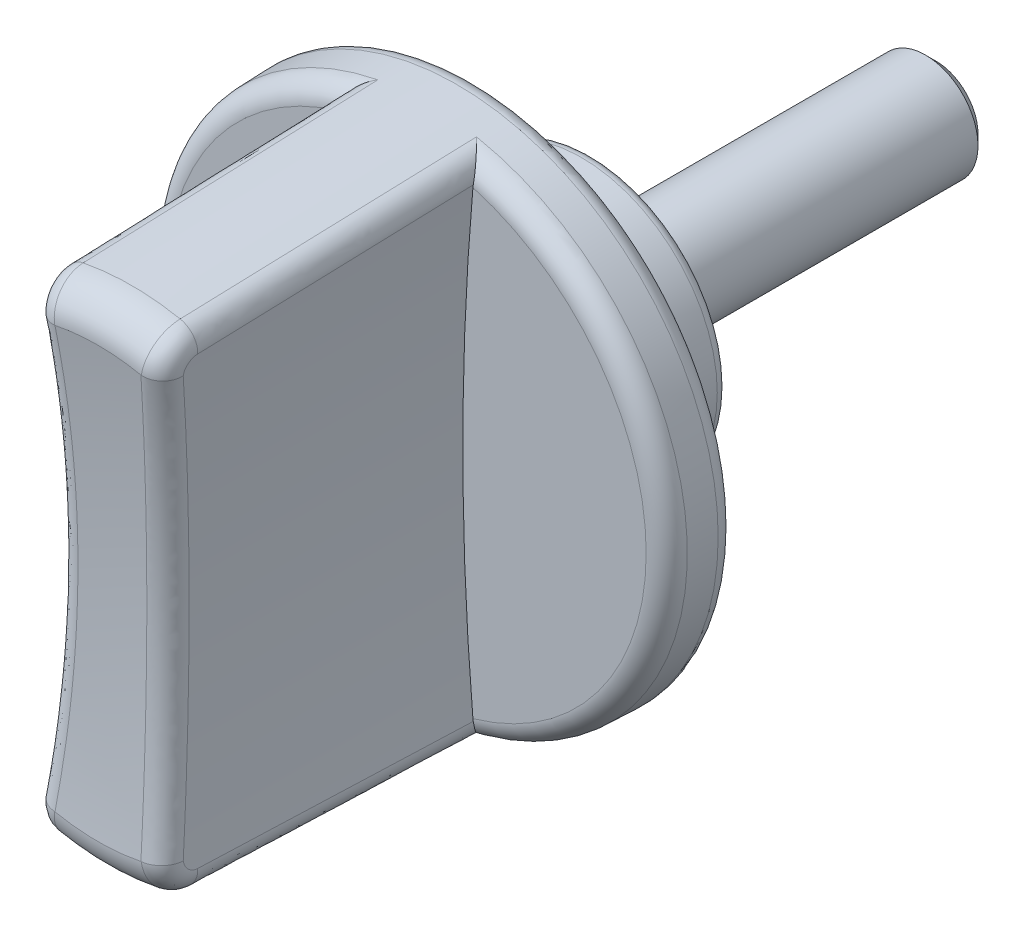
ISO-10303-21;
HEADER;
FILE_DESCRIPTION(('STEP AP214'),'2;1');
FILE_NAME('part.step','',(''),(''),'','','');
FILE_SCHEMA(('AUTOMOTIVE_DESIGN { 1 0 10303 214 1 1 1 1 }'));
ENDSEC;
DATA;
#1=APPLICATION_CONTEXT('core data for automotive mechanical design processes');
#2=APPLICATION_PROTOCOL_DEFINITION('international standard','automotive_design',2000,#1);
#3=PRODUCT_CONTEXT('',#1,'mechanical');
#4=PRODUCT('Part','Part','',(#3));
#5=PRODUCT_RELATED_PRODUCT_CATEGORY('part','',(#4));
#6=PRODUCT_DEFINITION_FORMATION('','',#4);
#7=PRODUCT_DEFINITION_CONTEXT('part definition',#1,'design');
#8=PRODUCT_DEFINITION('design','',#6,#7);
#9=PRODUCT_DEFINITION_SHAPE('','',#8);
#10=(LENGTH_UNIT() NAMED_UNIT(*) SI_UNIT(.MILLI.,.METRE.));
#11=(NAMED_UNIT(*) PLANE_ANGLE_UNIT() SI_UNIT($,.RADIAN.));
#12=(NAMED_UNIT(*) SI_UNIT($,.STERADIAN.) SOLID_ANGLE_UNIT());
#13=UNCERTAINTY_MEASURE_WITH_UNIT(LENGTH_MEASURE(1.E-05),#10,'distance_accuracy_value','');
#14=(GEOMETRIC_REPRESENTATION_CONTEXT(3) GLOBAL_UNCERTAINTY_ASSIGNED_CONTEXT((#13)) GLOBAL_UNIT_ASSIGNED_CONTEXT((#10,
#11,#12)) REPRESENTATION_CONTEXT('',''));
#15=CARTESIAN_POINT('',(0.,0.,0.));
#16=DIRECTION('',(0.,0.,1.));
#17=DIRECTION('',(1.,0.,0.));
#18=AXIS2_PLACEMENT_3D('',#15,#16,#17);
#19=CARTESIAN_POINT('',(0.,0.,6.86241624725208));
#20=DIRECTION('',(0.,0.,-1.));
#21=DIRECTION('',(-1.,0.,0.));
#22=AXIS2_PLACEMENT_3D('',#19,#20,#21);
#23=CONICAL_SURFACE('',#22,12.4698837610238,0.0349065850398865);
#24=CARTESIAN_POINT('',(0.,0.,8.2848994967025));
#25=DIRECTION('',(0.,0.,-1.));
#26=DIRECTION('',(-1.,0.,0.));
#27=AXIS2_PLACEMENT_3D('',#24,#25,#26);
#28=CIRCLE('',#27,12.4202095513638);
#29=CARTESIAN_POINT('',(-2.35538794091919,-12.1948248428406,8.28489949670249));
#30=VERTEX_POINT('',#29);
#31=CARTESIAN_POINT('',(-2.35538794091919,12.1948248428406,8.28489949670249));
#32=VERTEX_POINT('',#31);
#33=EDGE_CURVE('E148',#30,#32,#28,.T.);
#34=ORIENTED_EDGE('',*,*,#33,.T.);
#35=CARTESIAN_POINT('',(-2.26396741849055,10.9591425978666,43.4978114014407));
#36=CARTESIAN_POINT('',(-3.12852006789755,10.7806784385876,43.4939605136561));
#37=CARTESIAN_POINT('',(-3.05863794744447,9.9012081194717,43.4629119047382));
#38=CARTESIAN_POINT('',(-2.27229827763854,11.0828563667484,39.9800964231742));
#39=CARTESIAN_POINT('',(-3.1392994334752,10.9053806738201,39.9724846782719));
#40=CARTESIAN_POINT('',(-3.06836614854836,10.0236377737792,39.9451969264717));
#41=CARTESIAN_POINT('',(-2.2808765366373,11.2064808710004,36.4623794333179));
#42=CARTESIAN_POINT('',(-3.15024413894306,11.0298113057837,36.4550023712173));
#43=CARTESIAN_POINT('',(-3.07827024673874,10.1459965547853,36.4274799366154));
#44=CARTESIAN_POINT('',(-2.29851499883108,11.4535661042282,29.4269418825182));
#45=CARTESIAN_POINT('',(-3.17248858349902,11.2784466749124,29.4196678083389));
#46=CARTESIAN_POINT('',(-3.09843023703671,10.3905828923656,29.3920423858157));
#47=CARTESIAN_POINT('',(-2.30757520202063,11.5770268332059,25.9092213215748));
#48=CARTESIAN_POINT('',(-3.18378785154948,11.4026373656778,25.9021988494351));
#49=CARTESIAN_POINT('',(-3.10868612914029,10.5128104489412,25.8743218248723));
#50=CARTESIAN_POINT('',(-2.32616469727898,11.8237992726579,18.873777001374));
#51=CARTESIAN_POINT('',(-3.20674146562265,11.650814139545,18.8668750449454));
#52=CARTESIAN_POINT('',(-3.12954970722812,10.7571448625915,18.8388775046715));
#53=CARTESIAN_POINT('',(-2.3356939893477,11.9471109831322,15.3560532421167));
#54=CARTESIAN_POINT('',(-3.21839538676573,11.7747875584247,15.3493668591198));
#55=CARTESIAN_POINT('',(-3.1401573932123,10.8792517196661,15.3211537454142));
#56=CARTESIAN_POINT('',(-2.35521116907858,12.1935970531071,8.32060282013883));
#57=CARTESIAN_POINT('',(-3.24205818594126,12.0225435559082,8.31404485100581));
#58=CARTESIAN_POINT('',(-3.16172455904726,11.1233531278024,8.28570332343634));
#59=CARTESIAN_POINT('',(-2.36519905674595,12.3167714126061,4.80287615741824));
#60=CARTESIAN_POINT('',(-3.25406667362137,12.1463145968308,4.79654773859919));
#61=CARTESIAN_POINT('',(-3.17268403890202,11.2453476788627,4.76797666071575));
#62=CARTESIAN_POINT('',(-2.37541099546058,12.4398829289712,1.28514823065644));
#63=CARTESIAN_POINT('',(-3.26624163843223,12.2698878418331,1.28205067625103));
#64=CARTESIAN_POINT('',(-3.1838194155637,11.3672902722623,1.25024873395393));
#65=(BOUNDED_SURFACE() B_SPLINE_SURFACE(3,2,((#35,#36,#37),(#38,#39,#40),(#41,#42,#43),(#44,#45,
#46),(#47,#48,#49),(#50,#51,#52),(#53,#54,#55),(#56,#57,#58),(#59,#60,#61),(#62,#63,#64)),
.UNSPECIFIED.,.F.,.F.,.F.) B_SPLINE_SURFACE_WITH_KNOTS((4,2,2,2,4),(3,3),(0.,10.5596780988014,
21.1193560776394,31.6790340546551,42.2387121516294),(0.,1.),
.UNSPECIFIED.) GEOMETRIC_REPRESENTATION_ITEM() RATIONAL_B_SPLINE_SURFACE(((1.,0.749675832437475,
1.),(1.,0.748852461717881,1.),(1.,0.74805144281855,1.),(1.,0.746490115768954,1.),(1.,
0.745729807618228,1.),(1.,0.744245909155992,1.),(1.,0.743522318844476,1.),(1.,0.742108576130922,
1.),(1.,0.741418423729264,1.),(1.,0.740743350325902,1.))) REPRESENTATION_ITEM('') SURFACE());
#66=CARTESIAN_POINT('',(-2.37541099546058,12.4398829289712,1.28514823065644));
#67=CARTESIAN_POINT('',(-2.36519905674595,12.3167714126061,4.80287615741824));
#68=CARTESIAN_POINT('',(-2.35521116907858,12.193597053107,8.32060282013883));
#69=CARTESIAN_POINT('',(-2.3356939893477,11.9471109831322,15.3560532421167));
#70=CARTESIAN_POINT('',(-2.32616469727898,11.8237992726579,18.873777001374));
#71=CARTESIAN_POINT('',(-2.30757520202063,11.5770268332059,25.9092213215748));
#72=CARTESIAN_POINT('',(-2.29851499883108,11.4535661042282,29.4269418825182));
#73=CARTESIAN_POINT('',(-2.2808765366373,11.2064808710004,36.4623794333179));
#74=CARTESIAN_POINT('',(-2.27229827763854,11.0828563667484,39.9800964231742));
#75=CARTESIAN_POINT('',(-2.26396741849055,10.9591425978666,43.4978114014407));
#76=B_SPLINE_CURVE_WITH_KNOTS('',3,(#66,#67,#68,#69,#70,#71,#72,#73,#74,#75),.UNSPECIFIED.,.F.,
.F.,(4,2,2,2,4),(0.,10.5596780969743,21.11935607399,31.679034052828,42.2387121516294),.UNSPECIFIED.);
#77=CARTESIAN_POINT('',(-2.31686994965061,11.7004130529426,22.3914991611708));
#78=VERTEX_POINT('',#77);
#79=EDGE_CURVE('E471',#32,#78,#76,.T.);
#80=ORIENTED_EDGE('',*,*,#79,.T.);
#81=CARTESIAN_POINT('',(0.,0.,22.3914991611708));
#82=DIRECTION('',(0.,0.,1.));
#83=DIRECTION('',(1.,0.,0.));
#84=AXIS2_PLACEMENT_3D('',#81,#82,#83);
#85=CIRCLE('',#84,11.9275962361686);
#86=CARTESIAN_POINT('',(2.31686994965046,11.7004130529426,22.3914991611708));
#87=VERTEX_POINT('',#86);
#88=EDGE_CURVE('E164',#87,#78,#85,.T.);
#89=ORIENTED_EDGE('',*,*,#88,.F.);
#90=CARTESIAN_POINT('',(3.0586379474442,9.9012081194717,43.4629119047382));
#91=CARTESIAN_POINT('',(3.12852006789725,10.7806784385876,43.4939605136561));
#92=CARTESIAN_POINT('',(2.26396741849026,10.9591425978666,43.4978114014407));
#93=CARTESIAN_POINT('',(3.06836614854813,10.0236377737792,39.9451969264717));
#94=CARTESIAN_POINT('',(3.13929943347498,10.9053806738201,39.9724846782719));
#95=CARTESIAN_POINT('',(2.27229827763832,11.0828563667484,39.9800964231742));
#96=CARTESIAN_POINT('',(3.07827024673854,10.1459965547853,36.4274799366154));
#97=CARTESIAN_POINT('',(3.15024413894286,11.0298113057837,36.4550023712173));
#98=CARTESIAN_POINT('',(2.2808765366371,11.2064808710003,36.4623794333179));
#99=CARTESIAN_POINT('',(3.09843023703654,10.3905828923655,29.3920423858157));
#100=CARTESIAN_POINT('',(3.17248858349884,11.2784466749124,29.4196678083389));
#101=CARTESIAN_POINT('',(2.2985149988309,11.4535661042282,29.4269418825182));
#102=CARTESIAN_POINT('',(3.10868612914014,10.5128104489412,25.8743218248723));
#103=CARTESIAN_POINT('',(3.1837878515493,11.4026373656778,25.9021988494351));
#104=CARTESIAN_POINT('',(2.30757520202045,11.5770268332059,25.9092213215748));
#105=CARTESIAN_POINT('',(3.12954970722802,10.7571448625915,18.8388775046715));
#106=CARTESIAN_POINT('',(3.20674146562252,11.650814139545,18.8668750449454));
#107=CARTESIAN_POINT('',(2.32616469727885,11.8237992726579,18.873777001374));
#108=CARTESIAN_POINT('',(3.14015739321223,10.8792517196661,15.3211537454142));
#109=CARTESIAN_POINT('',(3.21839538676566,11.7747875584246,15.3493668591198));
#110=CARTESIAN_POINT('',(2.33569398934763,11.9471109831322,15.3560532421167));
#111=CARTESIAN_POINT('',(3.16172455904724,11.1233531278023,8.28570332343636));
#112=CARTESIAN_POINT('',(3.24205818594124,12.0225435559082,8.31404485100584));
#113=CARTESIAN_POINT('',(2.35521116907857,12.193597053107,8.32060282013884));
#114=CARTESIAN_POINT('',(3.17268403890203,11.2453476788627,4.76797666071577));
#115=CARTESIAN_POINT('',(3.25406667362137,12.1463145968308,4.79654773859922));
#116=CARTESIAN_POINT('',(2.36519905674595,12.3167714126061,4.80287615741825));
#117=CARTESIAN_POINT('',(3.18381941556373,11.3672902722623,1.25024873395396));
#118=CARTESIAN_POINT('',(3.26624163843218,12.2698878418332,1.28205067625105));
#119=CARTESIAN_POINT('',(2.37541099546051,12.4398829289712,1.28514823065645));
#120=(BOUNDED_SURFACE() B_SPLINE_SURFACE(3,2,((#90,#91,#92),(#93,#94,#95),(#96,#97,#98),(#99,
#100,#101),(#102,#103,#104),(#105,#106,#107),(#108,#109,#110),(#111,#112,#113),(#114,#115,#116),
(#117,#118,#119)),.UNSPECIFIED.,.F.,.F.,.F.) B_SPLINE_SURFACE_WITH_KNOTS((4,2,2,2,4),(3,3),(0.,
10.5596780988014,21.1193560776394,31.6790340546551,42.2387121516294),(0.,1.),
.UNSPECIFIED.) GEOMETRIC_REPRESENTATION_ITEM() RATIONAL_B_SPLINE_SURFACE(((1.,0.749675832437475,
1.),(1.,0.748852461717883,1.),(1.,0.748051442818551,1.),(1.,0.746490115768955,1.),(1.,
0.745729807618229,1.),(1.,0.744245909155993,1.),(1.,0.743522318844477,1.),(1.,0.742108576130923,
1.),(1.,0.741418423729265,1.),(1.,0.740743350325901,1.))) REPRESENTATION_ITEM('') SURFACE());
#121=CARTESIAN_POINT('',(2.26396741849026,10.9591425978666,43.4978114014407));
#122=CARTESIAN_POINT('',(2.27229827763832,11.0828563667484,39.9800964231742));
#123=CARTESIAN_POINT('',(2.2808765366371,11.2064808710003,36.4623794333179));
#124=CARTESIAN_POINT('',(2.2985149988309,11.4535661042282,29.4269418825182));
#125=CARTESIAN_POINT('',(2.30757520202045,11.5770268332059,25.9092213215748));
#126=CARTESIAN_POINT('',(2.32616469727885,11.8237992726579,18.873777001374));
#127=CARTESIAN_POINT('',(2.33569398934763,11.9471109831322,15.3560532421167));
#128=CARTESIAN_POINT('',(2.35521116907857,12.193597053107,8.32060282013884));
#129=CARTESIAN_POINT('',(2.36519905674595,12.3167714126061,4.80287615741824));
#130=CARTESIAN_POINT('',(2.37541099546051,12.4398829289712,1.28514823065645));
#131=B_SPLINE_CURVE_WITH_KNOTS('',3,(#121,#122,#123,#124,#125,#126,#127,#128,#129,#130),
.UNSPECIFIED.,.F.,.F.,(4,2,2,2,4),(0.,10.5596780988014,21.1193560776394,31.6790340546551,
42.2387121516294),.UNSPECIFIED.);
#132=CARTESIAN_POINT('',(2.35538794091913,12.1948248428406,8.28489949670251));
#133=VERTEX_POINT('',#132);
#134=EDGE_CURVE('E645',#87,#133,#131,.T.);
#135=ORIENTED_EDGE('',*,*,#134,.T.);
#136=CARTESIAN_POINT('',(0.,0.,8.2848994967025));
#137=DIRECTION('',(0.,0.,-1.));
#138=DIRECTION('',(-1.,0.,0.));
#139=AXIS2_PLACEMENT_3D('',#136,#137,#138);
#140=CIRCLE('',#139,12.4202095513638);
#141=CARTESIAN_POINT('',(2.35538794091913,-12.1948248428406,8.28489949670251));
#142=VERTEX_POINT('',#141);
#143=EDGE_CURVE('E651',#133,#142,#140,.T.);
#144=ORIENTED_EDGE('',*,*,#143,.T.);
#145=CARTESIAN_POINT('',(2.26396741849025,-10.9591425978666,43.4978114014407));
#146=CARTESIAN_POINT('',(3.12852006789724,-10.7806784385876,43.4939605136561));
#147=CARTESIAN_POINT('',(3.05863794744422,-9.9012081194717,43.4629119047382));
#148=CARTESIAN_POINT('',(2.27229827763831,-11.0828563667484,39.9800964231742));
#149=CARTESIAN_POINT('',(3.13929943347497,-10.9053806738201,39.9724846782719));
#150=CARTESIAN_POINT('',(3.06836614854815,-10.0236377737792,39.9451969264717));
#151=CARTESIAN_POINT('',(2.28087653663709,-11.2064808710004,36.4623794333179));
#152=CARTESIAN_POINT('',(3.15024413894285,-11.0298113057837,36.4550023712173));
#153=CARTESIAN_POINT('',(3.07827024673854,-10.1459965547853,36.4274799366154));
#154=CARTESIAN_POINT('',(2.29851499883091,-11.4535661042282,29.4269418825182));
#155=CARTESIAN_POINT('',(3.17248858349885,-11.2784466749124,29.4196678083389));
#156=CARTESIAN_POINT('',(3.09843023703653,-10.3905828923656,29.3920423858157));
#157=CARTESIAN_POINT('',(2.30757520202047,-11.5770268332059,25.9092213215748));
#158=CARTESIAN_POINT('',(3.18378785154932,-11.4026373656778,25.9021988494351));
#159=CARTESIAN_POINT('',(3.10868612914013,-10.5128104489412,25.8743218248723));
#160=CARTESIAN_POINT('',(2.32616469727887,-11.8237992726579,18.873777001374));
#161=CARTESIAN_POINT('',(3.20674146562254,-11.650814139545,18.8668750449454));
#162=CARTESIAN_POINT('',(3.12954970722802,-10.7571448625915,18.8388775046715));
#163=CARTESIAN_POINT('',(2.33569398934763,-11.9471109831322,15.3560532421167));
#164=CARTESIAN_POINT('',(3.21839538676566,-11.7747875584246,15.3493668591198));
#165=CARTESIAN_POINT('',(3.14015739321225,-10.8792517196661,15.3211537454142));
#166=CARTESIAN_POINT('',(2.35521116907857,-12.193597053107,8.32060282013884));
#167=CARTESIAN_POINT('',(3.24205818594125,-12.0225435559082,8.31404485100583));
#168=CARTESIAN_POINT('',(3.16172455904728,-11.1233531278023,8.28570332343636));
#169=CARTESIAN_POINT('',(2.36519905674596,-12.3167714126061,4.80287615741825));
#170=CARTESIAN_POINT('',(3.25406667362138,-12.1463145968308,4.79654773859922));
#171=CARTESIAN_POINT('',(3.17268403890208,-11.2453476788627,4.76797666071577));
#172=CARTESIAN_POINT('',(2.37541099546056,-12.4398829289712,1.28514823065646));
#173=CARTESIAN_POINT('',(3.26624163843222,-12.2698878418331,1.28205067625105));
#174=CARTESIAN_POINT('',(3.18381941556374,-11.3672902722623,1.25024873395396));
#175=(BOUNDED_SURFACE() B_SPLINE_SURFACE(3,2,((#145,#146,#147),(#148,#149,#150),(#151,#152,
#153),(#154,#155,#156),(#157,#158,#159),(#160,#161,#162),(#163,#164,#165),(#166,#167,#168),
(#169,#170,#171),(#172,#173,#174)),.UNSPECIFIED.,.F.,.F.,.F.) B_SPLINE_SURFACE_WITH_KNOTS((4,2,
2,2,4),(3,3),(0.,10.5596780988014,21.1193560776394,31.6790340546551,42.2387121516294),(0.,1.),
.UNSPECIFIED.) GEOMETRIC_REPRESENTATION_ITEM() RATIONAL_B_SPLINE_SURFACE(((1.,0.749675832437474,
1.),(1.,0.748852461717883,1.),(1.,0.748051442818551,1.),(1.,0.746490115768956,1.),(1.,
0.745729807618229,1.),(1.,0.744245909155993,1.),(1.,0.743522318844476,1.),(1.,0.742108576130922,
1.),(1.,0.741418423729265,1.),(1.,0.740743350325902,1.))) REPRESENTATION_ITEM('') SURFACE());
#176=CARTESIAN_POINT('',(2.37541099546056,-12.4398829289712,1.28514823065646));
#177=CARTESIAN_POINT('',(2.36519905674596,-12.3167714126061,4.80287615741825));
#178=CARTESIAN_POINT('',(2.35521116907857,-12.193597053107,8.32060282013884));
#179=CARTESIAN_POINT('',(2.33569398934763,-11.9471109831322,15.3560532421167));
#180=CARTESIAN_POINT('',(2.32616469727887,-11.8237992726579,18.873777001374));
#181=CARTESIAN_POINT('',(2.30757520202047,-11.5770268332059,25.9092213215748));
#182=CARTESIAN_POINT('',(2.29851499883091,-11.4535661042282,29.4269418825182));
#183=CARTESIAN_POINT('',(2.28087653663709,-11.2064808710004,36.4623794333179));
#184=CARTESIAN_POINT('',(2.2722982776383,-11.0828563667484,39.9800964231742));
#185=CARTESIAN_POINT('',(2.26396741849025,-10.9591425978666,43.4978114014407));
#186=B_SPLINE_CURVE_WITH_KNOTS('',3,(#176,#177,#178,#179,#180,#181,#182,#183,#184,#185),
.UNSPECIFIED.,.F.,.F.,(4,2,2,2,4),(0.,10.5596780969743,21.11935607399,31.679034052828,
42.2387121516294),.UNSPECIFIED.);
#187=CARTESIAN_POINT('',(2.31686994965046,-11.7004130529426,22.3914991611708));
#188=VERTEX_POINT('',#187);
#189=EDGE_CURVE('E149',#142,#188,#186,.T.);
#190=ORIENTED_EDGE('',*,*,#189,.T.);
#191=CARTESIAN_POINT('',(-2.31686994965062,-11.7004130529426,22.3914991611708));
#192=VERTEX_POINT('',#191);
#193=EDGE_CURVE('E154',#192,#188,#85,.T.);
#194=ORIENTED_EDGE('',*,*,#193,.F.);
#195=CARTESIAN_POINT('',(-3.05863794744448,-9.9012081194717,43.4629119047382));
#196=CARTESIAN_POINT('',(-3.12852006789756,-10.7806784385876,43.4939605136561));
#197=CARTESIAN_POINT('',(-2.26396741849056,-10.9591425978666,43.4978114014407));
#198=CARTESIAN_POINT('',(-3.06836614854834,-10.0236377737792,39.9451969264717));
#199=CARTESIAN_POINT('',(-3.13929943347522,-10.9053806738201,39.9724846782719));
#200=CARTESIAN_POINT('',(-2.27229827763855,-11.0828563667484,39.9800964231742));
#201=CARTESIAN_POINT('',(-3.07827024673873,-10.1459965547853,36.4274799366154));
#202=CARTESIAN_POINT('',(-3.15024413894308,-11.0298113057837,36.4550023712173));
#203=CARTESIAN_POINT('',(-2.28087653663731,-11.2064808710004,36.4623794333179));
#204=CARTESIAN_POINT('',(-3.0984302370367,-10.3905828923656,29.3920423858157));
#205=CARTESIAN_POINT('',(-3.17248858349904,-11.2784466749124,29.4196678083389));
#206=CARTESIAN_POINT('',(-2.29851499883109,-11.4535661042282,29.4269418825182));
#207=CARTESIAN_POINT('',(-3.1086861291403,-10.5128104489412,25.8743218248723));
#208=CARTESIAN_POINT('',(-3.18378785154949,-11.4026373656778,25.9021988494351));
#209=CARTESIAN_POINT('',(-2.30757520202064,-11.5770268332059,25.9092213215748));
#210=CARTESIAN_POINT('',(-3.12954970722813,-10.7571448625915,18.8388775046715));
#211=CARTESIAN_POINT('',(-3.20674146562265,-11.650814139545,18.8668750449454));
#212=CARTESIAN_POINT('',(-2.32616469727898,-11.8237992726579,18.873777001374));
#213=CARTESIAN_POINT('',(-3.1401573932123,-10.8792517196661,15.3211537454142));
#214=CARTESIAN_POINT('',(-3.21839538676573,-11.7747875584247,15.3493668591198));
#215=CARTESIAN_POINT('',(-2.3356939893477,-11.9471109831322,15.3560532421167));
#216=CARTESIAN_POINT('',(-3.16172455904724,-11.1233531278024,8.28570332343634));
#217=CARTESIAN_POINT('',(-3.24205818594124,-12.0225435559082,8.31404485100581));
#218=CARTESIAN_POINT('',(-2.35521116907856,-12.1935970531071,8.32060282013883));
#219=CARTESIAN_POINT('',(-3.17268403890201,-11.2453476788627,4.76797666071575));
#220=CARTESIAN_POINT('',(-3.25406667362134,-12.1463145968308,4.79654773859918));
#221=CARTESIAN_POINT('',(-2.36519905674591,-12.3167714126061,4.80287615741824));
#222=CARTESIAN_POINT('',(-3.18381941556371,-11.3672902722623,1.25024873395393));
#223=CARTESIAN_POINT('',(-3.26624163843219,-12.2698878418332,1.28205067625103));
#224=CARTESIAN_POINT('',(-2.37541099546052,-12.4398829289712,1.28514823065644));
#225=(BOUNDED_SURFACE() B_SPLINE_SURFACE(3,2,((#195,#196,#197),(#198,#199,#200),(#201,#202,
#203),(#204,#205,#206),(#207,#208,#209),(#210,#211,#212),(#213,#214,#215),(#216,#217,#218),
(#219,#220,#221),(#222,#223,#224)),.UNSPECIFIED.,.F.,.F.,.F.) B_SPLINE_SURFACE_WITH_KNOTS((4,2,
2,2,4),(3,3),(0.,10.5596780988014,21.1193560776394,31.6790340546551,42.2387121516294),(0.,1.),
.UNSPECIFIED.) GEOMETRIC_REPRESENTATION_ITEM() RATIONAL_B_SPLINE_SURFACE(((1.,0.749675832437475,
1.),(1.,0.748852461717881,1.),(1.,0.74805144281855,1.),(1.,0.746490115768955,1.),(1.,
0.745729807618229,1.),(1.,0.744245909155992,1.),(1.,0.743522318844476,1.),(1.,0.742108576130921,
1.),(1.,0.741418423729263,1.),(1.,0.740743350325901,1.))) REPRESENTATION_ITEM('') SURFACE());
#226=CARTESIAN_POINT('',(-2.26396741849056,-10.9591425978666,43.4978114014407));
#227=CARTESIAN_POINT('',(-2.27229827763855,-11.0828563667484,39.9800964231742));
#228=CARTESIAN_POINT('',(-2.28087653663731,-11.2064808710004,36.4623794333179));
#229=CARTESIAN_POINT('',(-2.29851499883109,-11.4535661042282,29.4269418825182));
#230=CARTESIAN_POINT('',(-2.30757520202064,-11.5770268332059,25.9092213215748));
#231=CARTESIAN_POINT('',(-2.32616469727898,-11.8237992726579,18.873777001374));
#232=CARTESIAN_POINT('',(-2.3356939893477,-11.9471109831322,15.3560532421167));
#233=CARTESIAN_POINT('',(-2.35521116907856,-12.1935970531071,8.32060282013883));
#234=CARTESIAN_POINT('',(-2.36519905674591,-12.3167714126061,4.80287615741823));
#235=CARTESIAN_POINT('',(-2.37541099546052,-12.4398829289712,1.28514823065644));
#236=B_SPLINE_CURVE_WITH_KNOTS('',3,(#226,#227,#228,#229,#230,#231,#232,#233,#234,#235),
.UNSPECIFIED.,.F.,.F.,(4,2,2,2,4),(0.,10.5596780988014,21.1193560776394,31.6790340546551,
42.2387121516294),.UNSPECIFIED.);
#237=EDGE_CURVE('E141',#192,#30,#236,.T.);
#238=ORIENTED_EDGE('',*,*,#237,.T.);
#239=EDGE_LOOP('',(#34,#80,#89,#135,#144,#190,#194,#238));
#240=FACE_BOUND('',#239,.T.);
#241=CARTESIAN_POINT('',(0.,0.,6.86241624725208));
#242=DIRECTION('',(0.,0.,1.));
#243=DIRECTION('',(1.,0.,0.));
#244=AXIS2_PLACEMENT_3D('',#241,#242,#243);
#245=CIRCLE('',#244,12.4698837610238);
#246=CARTESIAN_POINT('',(12.4698837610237,0.,6.86241624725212));
#247=VERTEX_POINT('',#246);
#248=EDGE_CURVE('E168',#247,#247,#245,.T.);
#249=ORIENTED_EDGE('',*,*,#248,.T.);
#250=EDGE_LOOP('',(#249));
#251=FACE_BOUND('',#250,.T.);
#252=ADVANCED_FACE('F14',(#240,#251),#23,.T.);
#253=CARTESIAN_POINT('',(0.,0.,22.3333333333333));
#254=DIRECTION('',(0.,0.,1.));
#255=DIRECTION('',(1.,0.,0.));
#256=AXIS2_PLACEMENT_3D('',#253,#254,#255);
#257=TOROIDAL_SURFACE('',#256,10.2619448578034,1.66666666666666);
#258=CARTESIAN_POINT('',(-4.60148244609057,21.9123883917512,25.6650824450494));
#259=CARTESIAN_POINT('',(-4.55007249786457,21.6236597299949,26.6168398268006));
#260=CARTESIAN_POINT('',(-3.56937554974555,21.7970600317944,26.6207344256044));
#261=CARTESIAN_POINT('',(-4.44308289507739,21.0228966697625,25.3844483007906));
#262=CARTESIAN_POINT('',(-4.39557785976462,20.7439508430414,26.3416180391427));
#263=CARTESIAN_POINT('',(-3.41180968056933,20.9122498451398,26.343792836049));
#264=CARTESIAN_POINT('',(-4.29344771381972,20.1265266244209,25.1209245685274));
#265=CARTESIAN_POINT('',(-4.24984903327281,19.8586825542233,26.08354728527));
#266=CARTESIAN_POINT('',(-3.26296205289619,20.0205975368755,26.0837365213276));
#267=CARTESIAN_POINT('',(-4.0125302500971,18.32159208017,24.6285326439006));
#268=CARTESIAN_POINT('',(-3.976253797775,18.0762221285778,25.6013026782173));
#269=CARTESIAN_POINT('',(-2.98352310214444,18.2251626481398,25.5978234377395));
#270=CARTESIAN_POINT('',(-3.88124862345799,17.4130271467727,24.3996656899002));
#271=CARTESIAN_POINT('',(-3.84845503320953,17.1792230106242,25.3772527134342));
#272=CARTESIAN_POINT('',(-2.85293243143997,17.3213796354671,25.3719678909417));
#273=CARTESIAN_POINT('',(-3.63786270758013,15.5852450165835,23.9770227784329));
#274=CARTESIAN_POINT('',(-3.6115032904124,15.374797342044,24.963447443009));
#275=CARTESIAN_POINT('',(-2.61082749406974,15.5032174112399,24.9548860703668));
#276=CARTESIAN_POINT('',(-3.52576017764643,14.6660268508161,23.7832500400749));
#277=CARTESIAN_POINT('',(-3.50241317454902,14.467584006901,24.7738049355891));
#278=CARTESIAN_POINT('',(-2.49931497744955,14.5888372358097,24.763662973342));
#279=CARTESIAN_POINT('',(-3.32143652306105,12.8188161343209,23.4312007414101));
#280=CARTESIAN_POINT('',(-3.30355643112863,12.6445161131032,24.4292071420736));
#281=CARTESIAN_POINT('',(-2.29606671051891,12.7513486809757,24.4162459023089));
#282=CARTESIAN_POINT('',(-3.229215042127,11.8908237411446,23.2729235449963));
#283=CARTESIAN_POINT('',(-3.21384295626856,11.7288937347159,24.2743456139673));
#284=CARTESIAN_POINT('',(-2.20433060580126,11.8282404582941,24.2600513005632));
#285=CARTESIAN_POINT('',(-2.98807761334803,9.15075571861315,22.8600462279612));
#286=CARTESIAN_POINT('',(-2.97908962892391,9.02388588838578,23.8700681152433));
#287=CARTESIAN_POINT('',(-1.96446232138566,9.10259384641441,23.8526065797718));
#288=CARTESIAN_POINT('',(-2.86747403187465,7.32848839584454,22.654960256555));
#289=CARTESIAN_POINT('',(-2.86190774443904,7.22720456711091,23.6696351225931));
#290=CARTESIAN_POINT('',(-1.84449349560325,7.28991740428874,23.6502191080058));
#291=CARTESIAN_POINT('',(-2.70638291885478,3.67081291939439,22.3813922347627));
#292=CARTESIAN_POINT('',(-2.70522453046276,3.61937384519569,23.4019914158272));
#293=CARTESIAN_POINT('',(-1.68425023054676,3.65149285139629,23.3802506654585));
#294=CARTESIAN_POINT('',(-2.66588523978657,1.83540645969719,22.3128928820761));
#295=CARTESIAN_POINT('',(-2.66588523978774,1.81019060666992,23.3350580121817));
#296=CARTESIAN_POINT('',(-1.64396569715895,1.82574642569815,23.3126526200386));
#297=CARTESIAN_POINT('',(-2.66588523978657,-1.83540645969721,22.3128928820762));
#298=CARTESIAN_POINT('',(-2.66588523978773,-1.81019060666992,23.3350580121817));
#299=CARTESIAN_POINT('',(-1.64396569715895,-1.82574642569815,23.3126526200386));
#300=CARTESIAN_POINT('',(-2.70638291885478,-3.6708129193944,22.3813922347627));
#301=CARTESIAN_POINT('',(-2.70522453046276,-3.61937384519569,23.4019914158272));
#302=CARTESIAN_POINT('',(-1.68425023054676,-3.6514928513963,23.3802506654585));
#303=CARTESIAN_POINT('',(-2.86747403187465,-7.32848839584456,22.6549602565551));
#304=CARTESIAN_POINT('',(-2.86190774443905,-7.22720456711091,23.6696351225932));
#305=CARTESIAN_POINT('',(-1.84449349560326,-7.28991740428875,23.6502191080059));
#306=CARTESIAN_POINT('',(-2.98807761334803,-9.15075571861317,22.8600462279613));
#307=CARTESIAN_POINT('',(-2.97908962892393,-9.02388588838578,23.8700681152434));
#308=CARTESIAN_POINT('',(-1.96446232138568,-9.10259384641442,23.852606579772));
#309=CARTESIAN_POINT('',(-3.229215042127,-11.8908237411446,23.2729235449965));
#310=CARTESIAN_POINT('',(-3.21384295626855,-11.728893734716,24.2743456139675));
#311=CARTESIAN_POINT('',(-2.20433060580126,-11.8282404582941,24.2600513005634));
#312=CARTESIAN_POINT('',(-3.32143652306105,-12.8188161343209,23.4312007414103));
#313=CARTESIAN_POINT('',(-3.30355643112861,-12.6445161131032,24.4292071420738));
#314=CARTESIAN_POINT('',(-2.29606671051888,-12.7513486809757,24.4162459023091));
#315=CARTESIAN_POINT('',(-3.52576017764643,-14.6660268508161,23.7832500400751));
#316=CARTESIAN_POINT('',(-3.502413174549,-14.467584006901,24.7738049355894));
#317=CARTESIAN_POINT('',(-2.49931497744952,-14.5888372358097,24.7636629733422));
#318=CARTESIAN_POINT('',(-3.63786270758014,-15.5852450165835,23.9770227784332));
#319=CARTESIAN_POINT('',(-3.6115032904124,-15.374797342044,24.9634474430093));
#320=CARTESIAN_POINT('',(-2.61082749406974,-15.5032174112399,24.954886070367));
#321=CARTESIAN_POINT('',(-3.88124862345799,-17.4130271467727,24.3996656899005));
#322=CARTESIAN_POINT('',(-3.84845503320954,-17.1792230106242,25.3772527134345));
#323=CARTESIAN_POINT('',(-2.85293243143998,-17.3213796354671,25.3719678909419));
#324=CARTESIAN_POINT('',(-4.01253025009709,-18.32159208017,24.628532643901));
#325=CARTESIAN_POINT('',(-3.97625379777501,-18.0762221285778,25.6013026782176));
#326=CARTESIAN_POINT('',(-2.98352310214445,-18.2251626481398,25.5978234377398));
#327=CARTESIAN_POINT('',(-4.2934477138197,-20.1265266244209,25.1209245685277));
#328=CARTESIAN_POINT('',(-4.24984903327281,-19.8586825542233,26.0835472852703));
#329=CARTESIAN_POINT('',(-3.26296205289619,-20.0205975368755,26.083736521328));
#330=CARTESIAN_POINT('',(-4.44308289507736,-21.0228966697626,25.384448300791));
#331=CARTESIAN_POINT('',(-4.39557785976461,-20.7439508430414,26.3416180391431));
#332=CARTESIAN_POINT('',(-3.41180968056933,-20.9122498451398,26.3437928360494));
#333=CARTESIAN_POINT('',(-4.60148244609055,-21.9123883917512,25.6650824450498));
#334=CARTESIAN_POINT('',(-4.55007249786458,-21.6236597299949,26.616839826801));
#335=CARTESIAN_POINT('',(-3.56937554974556,-21.7970600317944,26.6207344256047));
#336=(BOUNDED_SURFACE() B_SPLINE_SURFACE(3,2,((#258,#259,#260),(#261,#262,#263),(#264,#265,
#266),(#267,#268,#269),(#270,#271,#272),(#273,#274,#275),(#276,#277,#278),(#279,#280,#281),
(#282,#283,#284),(#285,#286,#287),(#288,#289,#290),(#291,#292,#293),(#294,#295,#296),(#297,#298,
#299),(#300,#301,#302),(#303,#304,#305),(#306,#307,#308),(#309,#310,#311),(#312,#313,#314),
(#315,#316,#317),(#318,#319,#320),(#321,#322,#323),(#324,#325,#326),(#327,#328,#329),(#330,#331,
#332),(#333,#334,#335)),.UNSPECIFIED.,.F.,.F.,.F.) B_SPLINE_SURFACE_WITH_KNOTS((4,2,2,2,2,2,2,2,
2,2,2,2,4),(3,3),(0.,2.85869705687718,5.71749623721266,8.57655751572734,11.4355675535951,
16.9849425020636,22.5336144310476,28.0822863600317,33.6316613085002,36.490671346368,
39.3497326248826,42.2085318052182,45.0672288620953),(0.,1.),
.UNSPECIFIED.) GEOMETRIC_REPRESENTATION_ITEM() RATIONAL_B_SPLINE_SURFACE(((1.,0.708552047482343,
1.),(1.,0.707800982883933,1.),(1.,0.707090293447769,1.),(1.,0.705754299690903,1.),(1.,
0.705128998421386,1.),(1.,0.703968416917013,1.),(1.,0.703433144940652,1.),(1.,0.702456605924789,
1.),(1.,0.702015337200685,1.),(1.,0.700860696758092,1.),(1.,0.700282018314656,1.),(1.,
0.699508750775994,1.),(1.,0.69931411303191,1.),(1.,0.69931411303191,1.),(1.,0.699508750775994,
1.),(1.,0.700282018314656,1.),(1.,0.700860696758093,1.),(1.,0.702015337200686,1.),(1.,
0.70245660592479,1.),(1.,0.703433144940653,1.),(1.,0.703968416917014,1.),(1.,0.705128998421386,
1.),(1.,0.705754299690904,1.),(1.,0.70709029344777,1.),(1.,0.707800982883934,1.),(1.,
0.708552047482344,1.))) REPRESENTATION_ITEM('') SURFACE());
#337=CARTESIAN_POINT('',(-2.05117297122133,-10.0548596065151,24.));
#338=CARTESIAN_POINT('',(-2.05388320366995,-10.0542700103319,24.0000000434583));
#339=CARTESIAN_POINT('',(-2.05660770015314,-10.053780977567,24.0000000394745));
#340=CARTESIAN_POINT('',(-2.06208523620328,-10.0530040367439,23.9999999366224));
#341=CARTESIAN_POINT('',(-2.06483827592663,-10.0527161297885,23.9999998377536));
#342=CARTESIAN_POINT('',(-2.06760557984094,-10.052528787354,23.9999996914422));
#343=B_SPLINE_CURVE_WITH_KNOTS('',3,(#337,#338,#339,#340,#341,#342),.UNSPECIFIED.,.F.,.F.,(4,2,
4),(0.,0.00830411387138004,0.0166082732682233),.UNSPECIFIED.);
#344=CARTESIAN_POINT('',(-2.05117297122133,-10.0548596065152,24.));
#345=VERTEX_POINT('',#344);
#346=CARTESIAN_POINT('',(-2.06760557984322,-10.0525287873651,23.9999996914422));
#347=VERTEX_POINT('',#346);
#348=EDGE_CURVE('E158',#345,#347,#343,.T.);
#349=ORIENTED_EDGE('',*,*,#348,.T.);
#350=CARTESIAN_POINT('',(-2.31331848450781,-11.6764623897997,22.0446059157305));
#351=CARTESIAN_POINT('',(-3.19335372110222,-11.5051542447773,22.0615747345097));
#352=CARTESIAN_POINT('',(-3.11829678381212,-10.6253569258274,22.2178423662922));
#353=CARTESIAN_POINT('',(-2.31479567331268,-11.686422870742,22.1017532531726));
#354=CARTESIAN_POINT('',(-3.19414364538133,-11.5140771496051,22.1154327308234));
#355=CARTESIAN_POINT('',(-3.1186381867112,-10.6293579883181,22.2407013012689));
#356=CARTESIAN_POINT('',(-2.31583203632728,-11.6934122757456,22.1594077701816));
#357=CARTESIAN_POINT('',(-3.19469798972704,-11.5203357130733,22.1697160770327));
#358=CARTESIAN_POINT('',(-3.1188778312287,-10.6321655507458,22.2637631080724));
#359=CARTESIAN_POINT('',(-2.31701895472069,-11.7014177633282,22.2752345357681));
#360=CARTESIAN_POINT('',(-3.19533282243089,-11.5275012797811,22.278692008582));
#361=CARTESIAN_POINT('',(-3.1191523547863,-10.6353812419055,22.310093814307));
#362=CARTESIAN_POINT('',(-2.31716811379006,-11.7024244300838,22.3334074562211));
#363=CARTESIAN_POINT('',(-3.19541276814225,-11.5284021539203,22.3334025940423));
#364=CARTESIAN_POINT('',(-3.11918691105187,-10.63578558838,22.3333629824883));
#365=CARTESIAN_POINT('',(-2.31639168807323,-11.6971867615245,22.4846794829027));
#366=CARTESIAN_POINT('',(-3.19499728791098,-11.5237145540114,22.4756925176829));
#367=CARTESIAN_POINT('',(-3.1190072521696,-10.6336817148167,22.3938717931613));
#368=CARTESIAN_POINT('',(-2.31476251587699,-11.6861953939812,22.5776508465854));
#369=CARTESIAN_POINT('',(-3.19412475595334,-11.5138731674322,22.563216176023));
#370=CARTESIAN_POINT('',(-3.11863016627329,-10.6292667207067,22.4310603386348));
#371=CARTESIAN_POINT('',(-2.30924238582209,-11.6489854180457,22.7604134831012));
#372=CARTESIAN_POINT('',(-3.1911741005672,-11.4805151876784,22.7356494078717));
#373=CARTESIAN_POINT('',(-3.11735542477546,-10.6143193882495,22.5041653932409));
#374=CARTESIAN_POINT('',(-2.30535006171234,-11.6227576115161,22.8502028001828));
#375=CARTESIAN_POINT('',(-3.18909281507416,-11.4569627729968,22.8206261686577));
#376=CARTESIAN_POINT('',(-3.1164574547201,-10.603783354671,22.540081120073));
#377=CARTESIAN_POINT('',(-2.29540851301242,-11.5558598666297,23.0239999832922));
#378=CARTESIAN_POINT('',(-3.18379040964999,-11.3967403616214,22.9858566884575));
#379=CARTESIAN_POINT('',(-3.11417222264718,-10.576907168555,22.609599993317));
#380=CARTESIAN_POINT('',(-2.2893603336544,-11.5151969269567,23.1080106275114));
#381=CARTESIAN_POINT('',(-3.18056557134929,-11.3600279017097,23.0661720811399));
#382=CARTESIAN_POINT('',(-3.1127851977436,-10.5605698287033,22.6432042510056));
#383=CARTESIAN_POINT('',(-2.27526535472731,-11.4206102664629,23.2679339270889));
#384=CARTESIAN_POINT('',(-3.17307255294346,-11.2743097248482,23.2201728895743));
#385=CARTESIAN_POINT('',(-3.10956849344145,-10.5225624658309,22.7071735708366));
#386=CARTESIAN_POINT('',(-2.26721832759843,-11.3666850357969,23.343845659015));
#387=CARTESIAN_POINT('',(-3.168798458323,-11.2252353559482,23.2939020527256));
#388=CARTESIAN_POINT('',(-3.10773876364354,-10.500891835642,22.7375382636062));
#389=CARTESIAN_POINT('',(-2.24931328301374,-11.2469792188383,23.4856424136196));
#390=CARTESIAN_POINT('',(-3.15931907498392,-11.1157424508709,23.4330999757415));
#391=CARTESIAN_POINT('',(-3.10369193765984,-10.4527786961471,22.7942569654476));
#392=CARTESIAN_POINT('',(-2.23945050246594,-11.1811674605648,23.5515002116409));
#393=CARTESIAN_POINT('',(-3.15410444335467,-11.0552123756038,23.498570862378));
#394=CARTESIAN_POINT('',(-3.1014738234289,-10.426323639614,22.8206000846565));
#395=CARTESIAN_POINT('',(-2.21818676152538,-11.0396777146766,23.6711331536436));
#396=CARTESIAN_POINT('',(-3.14289900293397,-10.924231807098,23.619366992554));
#397=CARTESIAN_POINT('',(-3.09672535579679,-10.3694367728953,22.8684532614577));
#398=CARTESIAN_POINT('',(-2.20678568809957,-10.9639990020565,23.7249074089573));
#399=CARTESIAN_POINT('',(-3.1369006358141,-10.8536892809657,23.6746932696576));
#400=CARTESIAN_POINT('',(-3.09419497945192,-10.3390046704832,22.8899629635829));
#401=CARTESIAN_POINT('',(-2.18267195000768,-10.8044518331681,23.8191920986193));
#402=CARTESIAN_POINT('',(-3.12425329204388,-10.7037880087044,23.7740229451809));
#403=CARTESIAN_POINT('',(-3.08888559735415,-10.2748333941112,22.9276768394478));
#404=CARTESIAN_POINT('',(-2.16995181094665,-10.7205368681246,23.8596208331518));
#405=CARTESIAN_POINT('',(-3.1175932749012,-10.6242861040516,23.8179300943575));
#406=CARTESIAN_POINT('',(-3.08610518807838,-10.2410754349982,22.9438483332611));
#407=CARTESIAN_POINT('',(-2.14359544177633,-10.5472934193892,23.9256759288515));
#408=CARTESIAN_POINT('',(-3.10383114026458,-10.458604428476,23.8926827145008));
#409=CARTESIAN_POINT('',(-3.08039428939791,-10.1713650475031,22.970270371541));
#410=CARTESIAN_POINT('',(-2.1299592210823,-10.4579649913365,23.951302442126));
#411=CARTESIAN_POINT('',(-3.09672226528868,-10.3723355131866,23.9234760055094));
#412=CARTESIAN_POINT('',(-3.07746380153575,-10.1354126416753,22.9805209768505));
#413=CARTESIAN_POINT('',(-2.1020460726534,-10.2758300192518,23.9871885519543));
#414=CARTESIAN_POINT('',(-3.08220021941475,-10.1945269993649,23.9710674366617));
#415=CARTESIAN_POINT('',(-3.07152050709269,-10.0620890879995,22.9948754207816));
#416=CARTESIAN_POINT('',(-2.08776564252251,-10.1830050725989,23.9973500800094));
#417=CARTESIAN_POINT('',(-3.07478036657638,-10.1028857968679,23.9876954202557));
#418=CARTESIAN_POINT('',(-3.0685072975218,-10.024710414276,22.9989400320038));
#419=CARTESIAN_POINT('',(-2.05903313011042,-9.99701786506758,24.001742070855));
#420=CARTESIAN_POINT('',(-3.05986905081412,-9.91702812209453,24.0057645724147));
#421=CARTESIAN_POINT('',(-3.06250263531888,-9.94979691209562,23.0006968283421));
#422=CARTESIAN_POINT('',(-2.04458101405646,-9.90385554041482,23.9959693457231));
#423=CARTESIAN_POINT('',(-3.05237447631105,-9.82276089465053,24.0071008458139));
#424=CARTESIAN_POINT('',(-3.05951118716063,-9.91226205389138,22.9983877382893));
#425=CARTESIAN_POINT('',(-2.01585849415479,-9.71949837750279,23.9685804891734));
#426=CARTESIAN_POINT('',(-3.03748239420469,-9.63373320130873,23.9939344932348));
#427=CARTESIAN_POINT('',(-3.05362323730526,-9.83796434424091,22.9874321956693));
#428=CARTESIAN_POINT('',(-2.0015889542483,-9.62831203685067,23.9469061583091));
#429=CARTESIAN_POINT('',(-3.03008523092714,-9.53895812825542,23.9792570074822));
#430=CARTESIAN_POINT('',(-3.05072712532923,-9.80120484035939,22.9787624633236));
#431=CARTESIAN_POINT('',(-1.97368736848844,-9.45075737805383,23.8883123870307));
#432=CARTESIAN_POINT('',(-3.0156050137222,-9.35183351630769,23.933765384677));
#433=CARTESIAN_POINT('',(-3.04511633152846,-9.72960879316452,22.9553249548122));
#434=CARTESIAN_POINT('',(-1.96005579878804,-9.36439264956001,23.8513817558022));
#435=CARTESIAN_POINT('',(-3.00852513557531,-9.25951170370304,23.9028216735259));
#436=CARTESIAN_POINT('',(-3.0424017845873,-9.69477368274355,22.9405527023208));
#437=CARTESIAN_POINT('',(-1.94695481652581,-9.28175610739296,23.8071718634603));
#438=CARTESIAN_POINT('',(-3.00173666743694,-9.17021307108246,23.8638648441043));
#439=CARTESIAN_POINT('',(-3.0398176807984,-9.66143285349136,22.9228687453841));
#440=(BOUNDED_SURFACE() B_SPLINE_SURFACE(3,2,((#350,#351,#352),(#353,#354,#355),(#356,#357,
#358),(#359,#360,#361),(#362,#363,#364),(#365,#366,#367),(#368,#369,#370),(#371,#372,#373),
(#374,#375,#376),(#377,#378,#379),(#380,#381,#382),(#383,#384,#385),(#386,#387,#388),(#389,#390,
#391),(#392,#393,#394),(#395,#396,#397),(#398,#399,#400),(#401,#402,#403),(#404,#405,#406),
(#407,#408,#409),(#410,#411,#412),(#413,#414,#415),(#416,#417,#418),(#419,#420,#421),(#422,#423,
#424),(#425,#426,#427),(#428,#429,#430),(#431,#432,#433),(#434,#435,#436),(#437,#438,#439)),
.UNSPECIFIED.,.F.,.F.,.F.) B_SPLINE_SURFACE_WITH_KNOTS((4,2,2,2,2,2,2,2,2,2,2,2,2,2,4),(3,3),
(0.,0.0695905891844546,0.139290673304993,0.251091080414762,0.362959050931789,0.474772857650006,
0.586599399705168,0.698723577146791,0.810855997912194,0.92366267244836,1.03646818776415,
1.14998610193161,1.26352672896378,1.37748499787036,1.49152700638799),(0.,1.),
.UNSPECIFIED.) GEOMETRIC_REPRESENTATION_ITEM() RATIONAL_B_SPLINE_SURFACE(((1.,0.744509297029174,
1.),(1.,0.744708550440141,1.),(1.,0.744848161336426,1.),(1.,0.745007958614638,1.),(1.,
0.745027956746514,1.),(1.,0.744923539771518,1.),(1.,0.744704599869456,1.),(1.,0.743958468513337,
1.),(1.,0.743431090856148,1.),(1.,0.742071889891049,1.),(1.,0.74124021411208,1.),(1.,
0.739278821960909,1.),(1.,0.738149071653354,1.),(1.,0.735598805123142,1.),(1.,0.73417752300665,
1.),(1.,0.731062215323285,1.),(1.,0.729368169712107,1.),(1.,0.725719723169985,1.),(1.,
0.72376381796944,1.),(1.,0.719632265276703,1.),(1.,0.717456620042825,1.),(1.,0.712914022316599,
1.),(1.,0.710545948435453,1.),(1.,0.705685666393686,1.),(1.,0.703193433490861,1.),(1.,
0.698142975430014,1.),(1.,0.695584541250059,1.),(1.,0.690491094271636,1.),(1.,0.687956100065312,
1.),(1.,0.685475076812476,1.))) REPRESENTATION_ITEM('') SURFACE());
#441=CARTESIAN_POINT('',(-1.94695481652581,-9.28175610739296,23.8071718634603));
#442=CARTESIAN_POINT('',(-1.96005579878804,-9.36439264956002,23.8513817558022));
#443=CARTESIAN_POINT('',(-1.97368736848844,-9.45075737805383,23.8883123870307));
#444=CARTESIAN_POINT('',(-2.0015889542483,-9.62831203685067,23.9469061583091));
#445=CARTESIAN_POINT('',(-2.01585849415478,-9.71949837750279,23.9685804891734));
#446=CARTESIAN_POINT('',(-2.04458101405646,-9.90385554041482,23.9959693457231));
#447=CARTESIAN_POINT('',(-2.05903313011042,-9.99701786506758,24.001742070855));
#448=CARTESIAN_POINT('',(-2.08776564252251,-10.1830050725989,23.9973500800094));
#449=CARTESIAN_POINT('',(-2.1020460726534,-10.2758300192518,23.9871885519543));
#450=CARTESIAN_POINT('',(-2.1299592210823,-10.4579649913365,23.951302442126));
#451=CARTESIAN_POINT('',(-2.14359544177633,-10.5472934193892,23.9256759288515));
#452=CARTESIAN_POINT('',(-2.16995181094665,-10.7205368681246,23.8596208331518));
#453=CARTESIAN_POINT('',(-2.18267195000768,-10.8044518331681,23.8191920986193));
#454=CARTESIAN_POINT('',(-2.20678568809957,-10.9639990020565,23.7249074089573));
#455=CARTESIAN_POINT('',(-2.21818676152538,-11.0396777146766,23.6711331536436));
#456=CARTESIAN_POINT('',(-2.23945050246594,-11.1811674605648,23.5515002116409));
#457=CARTESIAN_POINT('',(-2.24931328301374,-11.2469792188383,23.4856424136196));
#458=CARTESIAN_POINT('',(-2.26721832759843,-11.3666850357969,23.343845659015));
#459=CARTESIAN_POINT('',(-2.27526535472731,-11.4206102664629,23.2679339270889));
#460=CARTESIAN_POINT('',(-2.28936033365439,-11.5151969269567,23.1080106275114));
#461=CARTESIAN_POINT('',(-2.29540851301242,-11.5558598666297,23.0239999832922));
#462=CARTESIAN_POINT('',(-2.30535006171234,-11.6227576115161,22.8502028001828));
#463=CARTESIAN_POINT('',(-2.30924238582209,-11.6489854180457,22.7604134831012));
#464=CARTESIAN_POINT('',(-2.31476251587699,-11.6861953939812,22.5776508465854));
#465=CARTESIAN_POINT('',(-2.31639168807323,-11.6971867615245,22.4846794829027));
#466=CARTESIAN_POINT('',(-2.31716811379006,-11.7024244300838,22.3334074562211));
#467=CARTESIAN_POINT('',(-2.31701895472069,-11.7014177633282,22.2752345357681));
#468=CARTESIAN_POINT('',(-2.31583203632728,-11.6934122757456,22.1594077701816));
#469=CARTESIAN_POINT('',(-2.31479567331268,-11.686422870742,22.1017532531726));
#470=CARTESIAN_POINT('',(-2.31331848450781,-11.6764623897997,22.0446059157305));
#471=B_SPLINE_CURVE_WITH_KNOTS('',3,(#441,#442,#443,#444,#445,#446,#447,#448,#449,#450,#451,
#452,#453,#454,#455,#456,#457,#458,#459,#460,#461,#462,#463,#464,#465,#466,#467,#468,#469,#470),
.UNSPECIFIED.,.F.,.F.,(4,2,2,2,2,2,2,2,2,2,2,2,2,2,4),(0.,0.114042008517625,0.22800027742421,
0.341540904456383,0.455058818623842,0.567864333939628,0.680671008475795,0.792803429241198,
0.904927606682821,1.01675414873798,1.1285679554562,1.24043592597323,1.35223633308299,
1.42193641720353,1.49152700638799),.UNSPECIFIED.);
#472=EDGE_CURVE('E133',#347,#192,#471,.T.);
#473=ORIENTED_EDGE('',*,*,#472,.T.);
#474=ORIENTED_EDGE('',*,*,#193,.T.);
#475=CARTESIAN_POINT('',(3.118296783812,-10.6253569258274,22.2178423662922));
#476=CARTESIAN_POINT('',(3.19335372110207,-11.5051542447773,22.0615747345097));
#477=CARTESIAN_POINT('',(2.31331848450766,-11.6764623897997,22.0446059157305));
#478=CARTESIAN_POINT('',(3.11863818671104,-10.6293579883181,22.2407013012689));
#479=CARTESIAN_POINT('',(3.19414364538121,-11.5140771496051,22.1154327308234));
#480=CARTESIAN_POINT('',(2.31479567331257,-11.686422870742,22.1017532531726));
#481=CARTESIAN_POINT('',(3.11887783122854,-10.6321655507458,22.2637631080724));
#482=CARTESIAN_POINT('',(3.19469798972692,-11.5203357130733,22.1697160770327));
#483=CARTESIAN_POINT('',(2.31583203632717,-11.6934122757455,22.1594077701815));
#484=CARTESIAN_POINT('',(3.11915235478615,-10.6353812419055,22.3100938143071));
#485=CARTESIAN_POINT('',(3.19533282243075,-11.5275012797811,22.278692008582));
#486=CARTESIAN_POINT('',(2.31701895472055,-11.7014177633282,22.2752345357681));
#487=CARTESIAN_POINT('',(3.11918691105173,-10.63578558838,22.3333629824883));
#488=CARTESIAN_POINT('',(3.1954127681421,-11.5284021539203,22.3334025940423));
#489=CARTESIAN_POINT('',(2.3171681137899,-11.7024244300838,22.333407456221));
#490=CARTESIAN_POINT('',(3.11900725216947,-10.6336817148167,22.3938717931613));
#491=CARTESIAN_POINT('',(3.19499728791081,-11.5237145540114,22.4756925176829));
#492=CARTESIAN_POINT('',(2.31639168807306,-11.6971867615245,22.4846794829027));
#493=CARTESIAN_POINT('',(3.11863016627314,-10.6292667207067,22.4310603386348));
#494=CARTESIAN_POINT('',(3.1941247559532,-11.5138731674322,22.563216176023));
#495=CARTESIAN_POINT('',(2.31476251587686,-11.6861953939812,22.5776508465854));
#496=CARTESIAN_POINT('',(3.11735542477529,-10.6143193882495,22.5041653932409));
#497=CARTESIAN_POINT('',(3.19117410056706,-11.4805151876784,22.7356494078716));
#498=CARTESIAN_POINT('',(2.30924238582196,-11.6489854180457,22.7604134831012));
#499=CARTESIAN_POINT('',(3.11645745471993,-10.603783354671,22.540081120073));
#500=CARTESIAN_POINT('',(3.189092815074,-11.4569627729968,22.8206261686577));
#501=CARTESIAN_POINT('',(2.30535006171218,-11.6227576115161,22.8502028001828));
#502=CARTESIAN_POINT('',(3.11417222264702,-10.576907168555,22.609599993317));
#503=CARTESIAN_POINT('',(3.18379040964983,-11.3967403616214,22.9858566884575));
#504=CARTESIAN_POINT('',(2.29540851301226,-11.5558598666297,23.0239999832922));
#505=CARTESIAN_POINT('',(3.11278519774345,-10.5605698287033,22.6432042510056));
#506=CARTESIAN_POINT('',(3.18056557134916,-11.3600279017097,23.0661720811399));
#507=CARTESIAN_POINT('',(2.28936033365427,-11.5151969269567,23.1080106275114));
#508=CARTESIAN_POINT('',(3.1095684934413,-10.522562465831,22.7071735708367));
#509=CARTESIAN_POINT('',(3.17307255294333,-11.2743097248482,23.2201728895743));
#510=CARTESIAN_POINT('',(2.27526535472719,-11.4206102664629,23.2679339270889));
#511=CARTESIAN_POINT('',(3.10773876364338,-10.500891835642,22.7375382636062));
#512=CARTESIAN_POINT('',(3.16879845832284,-11.2252353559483,23.2939020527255));
#513=CARTESIAN_POINT('',(2.26721832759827,-11.3666850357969,23.343845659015));
#514=CARTESIAN_POINT('',(3.10369193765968,-10.4527786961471,22.7942569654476));
#515=CARTESIAN_POINT('',(3.15931907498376,-11.1157424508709,23.4330999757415));
#516=CARTESIAN_POINT('',(2.24931328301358,-11.2469792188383,23.4856424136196));
#517=CARTESIAN_POINT('',(3.10147382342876,-10.4263236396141,22.8206000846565));
#518=CARTESIAN_POINT('',(3.15410444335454,-11.0552123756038,23.4985708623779));
#519=CARTESIAN_POINT('',(2.23945050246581,-11.1811674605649,23.5515002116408));
#520=CARTESIAN_POINT('',(3.09672535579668,-10.3694367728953,22.8684532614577));
#521=CARTESIAN_POINT('',(3.14289900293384,-10.924231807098,23.6193669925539));
#522=CARTESIAN_POINT('',(2.21818676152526,-11.0396777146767,23.6711331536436));
#523=CARTESIAN_POINT('',(3.09419497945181,-10.3390046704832,22.8899629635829));
#524=CARTESIAN_POINT('',(3.13690063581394,-10.8536892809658,23.6746932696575));
#525=CARTESIAN_POINT('',(2.20678568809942,-10.9639990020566,23.7249074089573));
#526=CARTESIAN_POINT('',(3.08888559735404,-10.2748333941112,22.9276768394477));
#527=CARTESIAN_POINT('',(3.12425329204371,-10.7037880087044,23.7740229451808));
#528=CARTESIAN_POINT('',(2.18267195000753,-10.8044518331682,23.8191920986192));
#529=CARTESIAN_POINT('',(3.08610518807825,-10.2410754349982,22.9438483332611));
#530=CARTESIAN_POINT('',(3.11759327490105,-10.6242861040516,23.8179300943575));
#531=CARTESIAN_POINT('',(2.1699518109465,-10.7205368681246,23.8596208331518));
#532=CARTESIAN_POINT('',(3.08039428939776,-10.1713650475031,22.970270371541));
#533=CARTESIAN_POINT('',(3.10383114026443,-10.458604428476,23.8926827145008));
#534=CARTESIAN_POINT('',(2.14359544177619,-10.5472934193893,23.9256759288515));
#535=CARTESIAN_POINT('',(3.07746380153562,-10.1354126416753,22.9805209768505));
#536=CARTESIAN_POINT('',(3.09672226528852,-10.3723355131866,23.9234760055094));
#537=CARTESIAN_POINT('',(2.12995922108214,-10.4579649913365,23.951302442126));
#538=CARTESIAN_POINT('',(3.07152050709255,-10.0620890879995,22.9948754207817));
#539=CARTESIAN_POINT('',(3.08220021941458,-10.1945269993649,23.9710674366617));
#540=CARTESIAN_POINT('',(2.10204607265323,-10.2758300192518,23.9871885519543));
#541=CARTESIAN_POINT('',(3.06850729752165,-10.024710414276,22.9989400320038));
#542=CARTESIAN_POINT('',(3.07478036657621,-10.1028857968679,23.9876954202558));
#543=CARTESIAN_POINT('',(2.08776564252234,-10.1830050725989,23.9973500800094));
#544=CARTESIAN_POINT('',(3.06250263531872,-9.94979691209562,23.0006968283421));
#545=CARTESIAN_POINT('',(3.05986905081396,-9.91702812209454,24.0057645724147));
#546=CARTESIAN_POINT('',(2.05903313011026,-9.99701786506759,24.001742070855));
#547=CARTESIAN_POINT('',(3.05951118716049,-9.91226205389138,22.9983877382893));
#548=CARTESIAN_POINT('',(3.05237447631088,-9.82276089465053,24.007100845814));
#549=CARTESIAN_POINT('',(2.04458101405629,-9.90385554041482,23.9959693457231));
#550=CARTESIAN_POINT('',(3.05362323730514,-9.83796434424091,22.9874321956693));
#551=CARTESIAN_POINT('',(3.03748239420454,-9.63373320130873,23.9939344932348));
#552=CARTESIAN_POINT('',(2.01585849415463,-9.71949837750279,23.9685804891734));
#553=CARTESIAN_POINT('',(3.05072712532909,-9.80120484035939,22.9787624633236));
#554=CARTESIAN_POINT('',(3.030085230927,-9.53895812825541,23.9792570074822));
#555=CARTESIAN_POINT('',(2.00158895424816,-9.62831203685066,23.9469061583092));
#556=CARTESIAN_POINT('',(3.04511633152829,-9.72960879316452,22.9553249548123));
#557=CARTESIAN_POINT('',(3.01560501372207,-9.35183351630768,23.933765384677));
#558=CARTESIAN_POINT('',(1.97368736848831,-9.45075737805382,23.8883123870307));
#559=CARTESIAN_POINT('',(3.04240178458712,-9.69477368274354,22.9405527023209));
#560=CARTESIAN_POINT('',(3.00852513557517,-9.25951170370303,23.9028216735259));
#561=CARTESIAN_POINT('',(1.96005579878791,-9.36439264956,23.8513817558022));
#562=CARTESIAN_POINT('',(3.03981768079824,-9.66143285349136,22.9228687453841));
#563=CARTESIAN_POINT('',(3.00173666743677,-9.17021307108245,23.8638648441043));
#564=CARTESIAN_POINT('',(1.94695481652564,-9.28175610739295,23.8071718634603));
#565=(BOUNDED_SURFACE() B_SPLINE_SURFACE(3,2,((#475,#476,#477),(#478,#479,#480),(#481,#482,
#483),(#484,#485,#486),(#487,#488,#489),(#490,#491,#492),(#493,#494,#495),(#496,#497,#498),
(#499,#500,#501),(#502,#503,#504),(#505,#506,#507),(#508,#509,#510),(#511,#512,#513),(#514,#515,
#516),(#517,#518,#519),(#520,#521,#522),(#523,#524,#525),(#526,#527,#528),(#529,#530,#531),
(#532,#533,#534),(#535,#536,#537),(#538,#539,#540),(#541,#542,#543),(#544,#545,#546),(#547,#548,
#549),(#550,#551,#552),(#553,#554,#555),(#556,#557,#558),(#559,#560,#561),(#562,#563,#564)),
.UNSPECIFIED.,.F.,.F.,.F.) B_SPLINE_SURFACE_WITH_KNOTS((4,2,2,2,2,2,2,2,2,2,2,2,2,2,4),(3,3),
(0.,0.0695905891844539,0.139290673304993,0.251091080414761,0.362959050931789,0.474772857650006,
0.586599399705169,0.698723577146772,0.810855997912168,0.923662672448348,1.03646818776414,
1.1499861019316,1.26352672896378,1.37748499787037,1.49152700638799),(0.,1.),
.UNSPECIFIED.) GEOMETRIC_REPRESENTATION_ITEM() RATIONAL_B_SPLINE_SURFACE(((1.,0.744509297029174,
1.),(1.,0.744708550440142,1.),(1.,0.744848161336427,1.),(1.,0.745007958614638,1.),(1.,
0.745027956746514,1.),(1.,0.744923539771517,1.),(1.,0.744704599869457,1.),(1.,0.743958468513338,
1.),(1.,0.743431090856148,1.),(1.,0.742071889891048,1.),(1.,0.741240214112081,1.),(1.,
0.73927882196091,1.),(1.,0.738149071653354,1.),(1.,0.735598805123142,1.),(1.,0.734177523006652,
1.),(1.,0.731062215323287,1.),(1.,0.729368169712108,1.),(1.,0.725719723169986,1.),(1.,
0.723763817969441,1.),(1.,0.719632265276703,1.),(1.,0.717456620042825,1.),(1.,0.712914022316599,
1.),(1.,0.710545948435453,1.),(1.,0.705685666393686,1.),(1.,0.703193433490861,1.),(1.,
0.698142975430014,1.),(1.,0.695584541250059,1.),(1.,0.690491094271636,1.),(1.,0.687956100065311,
1.),(1.,0.685475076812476,1.))) REPRESENTATION_ITEM('') SURFACE());
#566=CARTESIAN_POINT('',(2.31331848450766,-11.6764623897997,22.0446059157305));
#567=CARTESIAN_POINT('',(2.31479567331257,-11.686422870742,22.1017532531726));
#568=CARTESIAN_POINT('',(2.31583203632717,-11.6934122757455,22.1594077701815));
#569=CARTESIAN_POINT('',(2.31701895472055,-11.7014177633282,22.2752345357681));
#570=CARTESIAN_POINT('',(2.3171681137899,-11.7024244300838,22.333407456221));
#571=CARTESIAN_POINT('',(2.31639168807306,-11.6971867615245,22.4846794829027));
#572=CARTESIAN_POINT('',(2.31476251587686,-11.6861953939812,22.5776508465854));
#573=CARTESIAN_POINT('',(2.30924238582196,-11.6489854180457,22.7604134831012));
#574=CARTESIAN_POINT('',(2.30535006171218,-11.6227576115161,22.8502028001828));
#575=CARTESIAN_POINT('',(2.29540851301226,-11.5558598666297,23.0239999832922));
#576=CARTESIAN_POINT('',(2.28936033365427,-11.5151969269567,23.1080106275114));
#577=CARTESIAN_POINT('',(2.27526535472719,-11.4206102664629,23.2679339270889));
#578=CARTESIAN_POINT('',(2.26721832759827,-11.3666850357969,23.343845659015));
#579=CARTESIAN_POINT('',(2.24931328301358,-11.2469792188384,23.4856424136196));
#580=CARTESIAN_POINT('',(2.23945050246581,-11.1811674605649,23.5515002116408));
#581=CARTESIAN_POINT('',(2.21818676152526,-11.0396777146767,23.6711331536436));
#582=CARTESIAN_POINT('',(2.20678568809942,-10.9639990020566,23.7249074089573));
#583=CARTESIAN_POINT('',(2.18267195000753,-10.8044518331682,23.8191920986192));
#584=CARTESIAN_POINT('',(2.1699518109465,-10.7205368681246,23.8596208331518));
#585=CARTESIAN_POINT('',(2.14359544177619,-10.5472934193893,23.9256759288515));
#586=CARTESIAN_POINT('',(2.12995922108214,-10.4579649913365,23.951302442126));
#587=CARTESIAN_POINT('',(2.10204607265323,-10.2758300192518,23.9871885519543));
#588=CARTESIAN_POINT('',(2.08776564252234,-10.1830050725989,23.9973500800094));
#589=CARTESIAN_POINT('',(2.05903313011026,-9.99701786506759,24.001742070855));
#590=CARTESIAN_POINT('',(2.04458101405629,-9.90385554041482,23.9959693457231));
#591=CARTESIAN_POINT('',(2.01585849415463,-9.71949837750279,23.9685804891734));
#592=CARTESIAN_POINT('',(2.00158895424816,-9.62831203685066,23.9469061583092));
#593=CARTESIAN_POINT('',(1.97368736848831,-9.45075737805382,23.8883123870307));
#594=CARTESIAN_POINT('',(1.96005579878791,-9.36439264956,23.8513817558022));
#595=CARTESIAN_POINT('',(1.94695481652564,-9.28175610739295,23.8071718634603));
#596=B_SPLINE_CURVE_WITH_KNOTS('',3,(#566,#567,#568,#569,#570,#571,#572,#573,#574,#575,#576,
#577,#578,#579,#580,#581,#582,#583,#584,#585,#586,#587,#588,#589,#590,#591,#592,#593,#594,#595),
.UNSPECIFIED.,.F.,.F.,(4,2,2,2,2,2,2,2,2,2,2,2,2,2,4),(0.,0.0695905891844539,0.139290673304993,
0.251091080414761,0.362959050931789,0.474772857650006,0.586599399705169,0.698723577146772,
0.810855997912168,0.923662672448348,1.03646818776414,1.1499861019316,1.26352672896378,
1.37748499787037,1.49152700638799),.UNSPECIFIED.);
#597=CARTESIAN_POINT('',(2.06760557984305,-10.0525287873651,23.9999996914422));
#598=VERTEX_POINT('',#597);
#599=EDGE_CURVE('E205',#188,#598,#596,.T.);
#600=ORIENTED_EDGE('',*,*,#599,.T.);
#601=CARTESIAN_POINT('',(4.60148244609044,-21.9123883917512,25.6650824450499));
#602=CARTESIAN_POINT('',(4.5500724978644,-21.6236597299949,26.616839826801));
#603=CARTESIAN_POINT('',(3.56937554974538,-21.7970600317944,26.6207344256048));
#604=CARTESIAN_POINT('',(4.44308289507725,-21.0228966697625,25.384448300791));
#605=CARTESIAN_POINT('',(4.39557785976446,-20.7439508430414,26.3416180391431));
#606=CARTESIAN_POINT('',(3.41180968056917,-20.9122498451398,26.3437928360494));
#607=CARTESIAN_POINT('',(4.29344771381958,-20.1265266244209,25.1209245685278));
#608=CARTESIAN_POINT('',(4.24984903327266,-19.8586825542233,26.0835472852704));
#609=CARTESIAN_POINT('',(3.26296205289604,-20.0205975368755,26.083736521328));
#610=CARTESIAN_POINT('',(4.01253025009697,-18.32159208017,24.628532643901));
#611=CARTESIAN_POINT('',(3.97625379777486,-18.0762221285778,25.6013026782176));
#612=CARTESIAN_POINT('',(2.9835231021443,-18.2251626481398,25.5978234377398));
#613=CARTESIAN_POINT('',(3.88124862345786,-17.4130271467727,24.3996656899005));
#614=CARTESIAN_POINT('',(3.84845503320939,-17.1792230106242,25.3772527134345));
#615=CARTESIAN_POINT('',(2.85293243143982,-17.3213796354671,25.3719678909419));
#616=CARTESIAN_POINT('',(3.63786270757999,-15.5852450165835,23.9770227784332));
#617=CARTESIAN_POINT('',(3.61150329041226,-15.374797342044,24.9634474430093));
#618=CARTESIAN_POINT('',(2.6108274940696,-15.5032174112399,24.9548860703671));
#619=CARTESIAN_POINT('',(3.52576017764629,-14.6660268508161,23.7832500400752));
#620=CARTESIAN_POINT('',(3.50241317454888,-14.467584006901,24.7738049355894));
#621=CARTESIAN_POINT('',(2.4993149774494,-14.5888372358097,24.7636629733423));
#622=CARTESIAN_POINT('',(3.32143652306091,-12.8188161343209,23.4312007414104));
#623=CARTESIAN_POINT('',(3.30355643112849,-12.6445161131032,24.4292071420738));
#624=CARTESIAN_POINT('',(2.29606671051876,-12.7513486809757,24.4162459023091));
#625=CARTESIAN_POINT('',(3.22921504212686,-11.8908237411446,23.2729235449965));
#626=CARTESIAN_POINT('',(3.21384295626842,-11.7288937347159,24.2743456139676));
#627=CARTESIAN_POINT('',(2.20433060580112,-11.8282404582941,24.2600513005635));
#628=CARTESIAN_POINT('',(2.9880776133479,-9.15075571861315,22.8600462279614));
#629=CARTESIAN_POINT('',(2.97908962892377,-9.02388588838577,23.8700681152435));
#630=CARTESIAN_POINT('',(1.96446232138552,-9.10259384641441,23.852606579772));
#631=CARTESIAN_POINT('',(2.8674740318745,-7.32848839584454,22.6549602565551));
#632=CARTESIAN_POINT('',(2.86190774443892,-7.2272045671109,23.6696351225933));
#633=CARTESIAN_POINT('',(1.84449349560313,-7.28991740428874,23.6502191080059));
#634=CARTESIAN_POINT('',(2.70638291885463,-3.67081291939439,22.3813922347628));
#635=CARTESIAN_POINT('',(2.70522453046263,-3.61937384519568,23.4019914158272));
#636=CARTESIAN_POINT('',(1.68425023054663,-3.65149285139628,23.3802506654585));
#637=CARTESIAN_POINT('',(2.66588523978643,-1.83540645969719,22.3128928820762));
#638=CARTESIAN_POINT('',(2.66588523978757,-1.81019060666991,23.3350580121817));
#639=CARTESIAN_POINT('',(1.64396569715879,-1.82574642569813,23.3126526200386));
#640=CARTESIAN_POINT('',(2.66588523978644,1.8354064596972,22.3128928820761));
#641=CARTESIAN_POINT('',(2.66588523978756,1.81019060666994,23.3350580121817));
#642=CARTESIAN_POINT('',(1.64396569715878,1.82574642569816,23.3126526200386));
#643=CARTESIAN_POINT('',(2.70638291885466,3.6708129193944,22.3813922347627));
#644=CARTESIAN_POINT('',(2.70522453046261,3.61937384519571,23.4019914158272));
#645=CARTESIAN_POINT('',(1.68425023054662,3.65149285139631,23.3802506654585));
#646=CARTESIAN_POINT('',(2.8674740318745,7.32848839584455,22.654960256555));
#647=CARTESIAN_POINT('',(2.86190774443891,7.22720456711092,23.6696351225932));
#648=CARTESIAN_POINT('',(1.84449349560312,7.28991740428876,23.6502191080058));
#649=CARTESIAN_POINT('',(2.98807761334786,9.15075571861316,22.8600462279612));
#650=CARTESIAN_POINT('',(2.97908962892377,9.02388588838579,23.8700681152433));
#651=CARTESIAN_POINT('',(1.96446232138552,9.10259384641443,23.8526065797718));
#652=CARTESIAN_POINT('',(3.22921504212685,11.8908237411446,23.2729235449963));
#653=CARTESIAN_POINT('',(3.21384295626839,11.728893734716,24.2743456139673));
#654=CARTESIAN_POINT('',(2.20433060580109,11.8282404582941,24.2600513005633));
#655=CARTESIAN_POINT('',(3.32143652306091,12.8188161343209,23.4312007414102));
#656=CARTESIAN_POINT('',(3.30355643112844,12.6445161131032,24.4292071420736));
#657=CARTESIAN_POINT('',(2.29606671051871,12.7513486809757,24.4162459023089));
#658=CARTESIAN_POINT('',(3.5257601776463,14.6660268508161,23.7832500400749));
#659=CARTESIAN_POINT('',(3.50241317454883,14.467584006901,24.7738049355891));
#660=CARTESIAN_POINT('',(2.49931497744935,14.5888372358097,24.763662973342));
#661=CARTESIAN_POINT('',(3.63786270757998,15.5852450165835,23.9770227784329));
#662=CARTESIAN_POINT('',(3.61150329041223,15.374797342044,24.9634474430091));
#663=CARTESIAN_POINT('',(2.61082749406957,15.5032174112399,24.9548860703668));
#664=CARTESIAN_POINT('',(3.88124862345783,17.4130271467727,24.3996656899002));
#665=CARTESIAN_POINT('',(3.84845503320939,17.1792230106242,25.3772527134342));
#666=CARTESIAN_POINT('',(2.85293243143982,17.3213796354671,25.3719678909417));
#667=CARTESIAN_POINT('',(4.01253025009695,18.32159208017,24.6285326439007));
#668=CARTESIAN_POINT('',(3.97625379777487,18.0762221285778,25.6013026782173));
#669=CARTESIAN_POINT('',(2.98352310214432,18.2251626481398,25.5978234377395));
#670=CARTESIAN_POINT('',(4.29344771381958,20.1265266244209,25.1209245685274));
#671=CARTESIAN_POINT('',(4.24984903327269,19.8586825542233,26.08354728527));
#672=CARTESIAN_POINT('',(3.26296205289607,20.0205975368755,26.0837365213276));
#673=CARTESIAN_POINT('',(4.44308289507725,21.0228966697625,25.3844483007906));
#674=CARTESIAN_POINT('',(4.39557785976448,20.7439508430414,26.3416180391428));
#675=CARTESIAN_POINT('',(3.4118096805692,20.9122498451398,26.3437928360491));
#676=CARTESIAN_POINT('',(4.60148244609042,21.9123883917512,25.6650824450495));
#677=CARTESIAN_POINT('',(4.55007249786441,21.6236597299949,26.6168398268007));
#678=CARTESIAN_POINT('',(3.56937554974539,21.7970600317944,26.6207344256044));
#679=(BOUNDED_SURFACE() B_SPLINE_SURFACE(3,2,((#601,#602,#603),(#604,#605,#606),(#607,#608,
#609),(#610,#611,#612),(#613,#614,#615),(#616,#617,#618),(#619,#620,#621),(#622,#623,#624),
(#625,#626,#627),(#628,#629,#630),(#631,#632,#633),(#634,#635,#636),(#637,#638,#639),(#640,#641,
#642),(#643,#644,#645),(#646,#647,#648),(#649,#650,#651),(#652,#653,#654),(#655,#656,#657),
(#658,#659,#660),(#661,#662,#663),(#664,#665,#666),(#667,#668,#669),(#670,#671,#672),(#673,#674,
#675),(#676,#677,#678)),.UNSPECIFIED.,.F.,.F.,.F.) B_SPLINE_SURFACE_WITH_KNOTS((4,2,2,2,2,2,2,2,
2,2,2,2,4),(3,3),(0.,2.85869705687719,5.71749623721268,8.57655751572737,11.4355675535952,
16.9849425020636,22.5336144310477,28.0822863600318,33.6316613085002,36.490671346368,
39.3497326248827,42.2085318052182,45.0672288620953),(0.,1.),
.UNSPECIFIED.) GEOMETRIC_REPRESENTATION_ITEM() RATIONAL_B_SPLINE_SURFACE(((1.,0.708552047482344,
1.),(1.,0.707800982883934,1.),(1.,0.70709029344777,1.),(1.,0.705754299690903,1.),(1.,
0.705128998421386,1.),(1.,0.703968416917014,1.),(1.,0.703433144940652,1.),(1.,0.702456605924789,
1.),(1.,0.702015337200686,1.),(1.,0.700860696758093,1.),(1.,0.700282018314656,1.),(1.,
0.699508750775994,1.),(1.,0.69931411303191,1.),(1.,0.69931411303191,1.),(1.,0.699508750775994,
1.),(1.,0.700282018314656,1.),(1.,0.700860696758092,1.),(1.,0.702015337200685,1.),(1.,
0.702456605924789,1.),(1.,0.703433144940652,1.),(1.,0.703968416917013,1.),(1.,0.705128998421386,
1.),(1.,0.705754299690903,1.),(1.,0.707090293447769,1.),(1.,0.707800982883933,1.),(1.,
0.708552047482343,1.))) REPRESENTATION_ITEM('') SURFACE());
#680=CARTESIAN_POINT('',(2.06760557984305,-10.0525287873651,23.9999996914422));
#681=CARTESIAN_POINT('',(2.06483827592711,-10.0527161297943,23.9999998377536));
#682=CARTESIAN_POINT('',(2.0620852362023,-10.0530040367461,23.9999999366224));
#683=CARTESIAN_POINT('',(2.05660770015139,-10.0537809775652,24.0000000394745));
#684=CARTESIAN_POINT('',(2.05388320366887,-10.0542700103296,24.0000000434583));
#685=CARTESIAN_POINT('',(2.05117297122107,-10.0548596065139,24.));
#686=B_SPLINE_CURVE_WITH_KNOTS('',3,(#680,#681,#682,#683,#684,#685),.UNSPECIFIED.,.F.,.F.,(4,2,
4),(0.,0.00830415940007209,0.0166082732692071),.UNSPECIFIED.);
#687=CARTESIAN_POINT('',(2.05117297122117,-10.0548596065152,24.));
#688=VERTEX_POINT('',#687);
#689=EDGE_CURVE('E197',#598,#688,#686,.T.);
#690=ORIENTED_EDGE('',*,*,#689,.T.);
#691=CARTESIAN_POINT('',(0.,0.,24.));
#692=DIRECTION('',(0.,0.,1.));
#693=DIRECTION('',(1.,0.,0.));
#694=AXIS2_PLACEMENT_3D('',#691,#692,#693);
#695=CIRCLE('',#694,10.2619448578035);
#696=EDGE_CURVE('E170',#345,#688,#695,.T.);
#697=ORIENTED_EDGE('',*,*,#696,.F.);
#698=EDGE_LOOP('',(#349,#473,#474,#600,#690,#697));
#699=FACE_BOUND('',#698,.T.);
#700=ADVANCED_FACE('F153',(#699),#257,.T.);
#701=ORIENTED_EDGE('',*,*,#88,.T.);
#702=CARTESIAN_POINT('',(-3.11829678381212,10.6253569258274,22.2178423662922));
#703=CARTESIAN_POINT('',(-3.19335372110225,11.5051542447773,22.0615747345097));
#704=CARTESIAN_POINT('',(-2.31331848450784,11.6764623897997,22.0446059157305));
#705=CARTESIAN_POINT('',(-3.11863818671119,10.6293579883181,22.2407013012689));
#706=CARTESIAN_POINT('',(-3.19414364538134,11.5140771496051,22.1154327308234));
#707=CARTESIAN_POINT('',(-2.31479567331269,11.686422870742,22.1017532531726));
#708=CARTESIAN_POINT('',(-3.1188778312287,10.6321655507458,22.2637631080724));
#709=CARTESIAN_POINT('',(-3.19469798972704,11.5203357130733,22.1697160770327));
#710=CARTESIAN_POINT('',(-2.31583203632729,11.6934122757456,22.1594077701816));
#711=CARTESIAN_POINT('',(-3.1191523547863,10.6353812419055,22.310093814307));
#712=CARTESIAN_POINT('',(-3.19533282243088,11.5275012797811,22.278692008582));
#713=CARTESIAN_POINT('',(-2.31701895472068,11.7014177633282,22.2752345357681));
#714=CARTESIAN_POINT('',(-3.11918691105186,10.63578558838,22.3333629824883));
#715=CARTESIAN_POINT('',(-3.19541276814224,11.5284021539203,22.3334025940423));
#716=CARTESIAN_POINT('',(-2.31716811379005,11.7024244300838,22.3334074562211));
#717=CARTESIAN_POINT('',(-3.11900725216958,10.6336817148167,22.3938717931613));
#718=CARTESIAN_POINT('',(-3.19499728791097,11.5237145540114,22.4756925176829));
#719=CARTESIAN_POINT('',(-2.31639168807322,11.6971867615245,22.4846794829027));
#720=CARTESIAN_POINT('',(-3.11863016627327,10.6292667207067,22.4310603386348));
#721=CARTESIAN_POINT('',(-3.19412475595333,11.5138731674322,22.563216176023));
#722=CARTESIAN_POINT('',(-2.31476251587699,11.6861953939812,22.5776508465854));
#723=CARTESIAN_POINT('',(-3.11735542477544,10.6143193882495,22.5041653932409));
#724=CARTESIAN_POINT('',(-3.19117410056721,11.4805151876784,22.7356494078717));
#725=CARTESIAN_POINT('',(-2.3092423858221,11.6489854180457,22.7604134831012));
#726=CARTESIAN_POINT('',(-3.11645745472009,10.603783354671,22.540081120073));
#727=CARTESIAN_POINT('',(-3.18909281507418,11.4569627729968,22.8206261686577));
#728=CARTESIAN_POINT('',(-2.30535006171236,11.6227576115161,22.8502028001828));
#729=CARTESIAN_POINT('',(-3.11417222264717,10.576907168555,22.609599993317));
#730=CARTESIAN_POINT('',(-3.18379040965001,11.3967403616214,22.9858566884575));
#731=CARTESIAN_POINT('',(-2.29540851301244,11.5558598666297,23.0239999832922));
#732=CARTESIAN_POINT('',(-3.1127851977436,10.5605698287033,22.6432042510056));
#733=CARTESIAN_POINT('',(-3.1805655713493,11.3600279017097,23.0661720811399));
#734=CARTESIAN_POINT('',(-2.2893603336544,11.5151969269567,23.1080106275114));
#735=CARTESIAN_POINT('',(-3.10956849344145,10.5225624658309,22.7071735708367));
#736=CARTESIAN_POINT('',(-3.17307255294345,11.2743097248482,23.2201728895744));
#737=CARTESIAN_POINT('',(-2.2752653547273,11.4206102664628,23.2679339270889));
#738=CARTESIAN_POINT('',(-3.10773876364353,10.5008918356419,22.7375382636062));
#739=CARTESIAN_POINT('',(-3.16879845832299,11.2252353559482,23.2939020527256));
#740=CARTESIAN_POINT('',(-2.26721832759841,11.3666850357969,23.343845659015));
#741=CARTESIAN_POINT('',(-3.10369193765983,10.4527786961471,22.7942569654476));
#742=CARTESIAN_POINT('',(-3.15931907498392,11.1157424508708,23.4330999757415));
#743=CARTESIAN_POINT('',(-2.24931328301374,11.2469792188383,23.4856424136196));
#744=CARTESIAN_POINT('',(-3.1014738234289,10.426323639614,22.8206000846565));
#745=CARTESIAN_POINT('',(-3.15410444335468,11.0552123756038,23.498570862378));
#746=CARTESIAN_POINT('',(-2.23945050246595,11.1811674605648,23.5515002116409));
#747=CARTESIAN_POINT('',(-3.09672535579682,10.3694367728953,22.8684532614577));
#748=CARTESIAN_POINT('',(-3.14289900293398,10.924231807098,23.619366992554));
#749=CARTESIAN_POINT('',(-2.21818676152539,11.0396777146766,23.6711331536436));
#750=CARTESIAN_POINT('',(-3.09419497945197,10.3390046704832,22.8899629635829));
#751=CARTESIAN_POINT('',(-3.1369006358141,10.8536892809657,23.6746932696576));
#752=CARTESIAN_POINT('',(-2.20678568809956,10.9639990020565,23.7249074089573));
#753=CARTESIAN_POINT('',(-3.08888559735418,10.2748333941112,22.9276768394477));
#754=CARTESIAN_POINT('',(-3.12425329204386,10.7037880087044,23.7740229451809));
#755=CARTESIAN_POINT('',(-2.18267195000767,10.8044518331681,23.8191920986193));
#756=CARTESIAN_POINT('',(-3.08610518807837,10.2410754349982,22.9438483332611));
#757=CARTESIAN_POINT('',(-3.1175932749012,10.6242861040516,23.8179300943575));
#758=CARTESIAN_POINT('',(-2.16995181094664,10.7205368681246,23.8596208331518));
#759=CARTESIAN_POINT('',(-3.08039428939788,10.1713650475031,22.970270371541));
#760=CARTESIAN_POINT('',(-3.10383114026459,10.458604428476,23.8926827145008));
#761=CARTESIAN_POINT('',(-2.14359544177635,10.5472934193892,23.9256759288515));
#762=CARTESIAN_POINT('',(-3.07746380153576,10.1354126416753,22.9805209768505));
#763=CARTESIAN_POINT('',(-3.09672226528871,10.3723355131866,23.9234760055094));
#764=CARTESIAN_POINT('',(-2.12995922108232,10.4579649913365,23.951302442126));
#765=CARTESIAN_POINT('',(-3.07152050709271,10.0620890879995,22.9948754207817));
#766=CARTESIAN_POINT('',(-3.08220021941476,10.1945269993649,23.9710674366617));
#767=CARTESIAN_POINT('',(-2.10204607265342,10.2758300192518,23.9871885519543));
#768=CARTESIAN_POINT('',(-3.0685072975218,10.024710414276,22.9989400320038));
#769=CARTESIAN_POINT('',(-3.07478036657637,10.1028857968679,23.9876954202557));
#770=CARTESIAN_POINT('',(-2.0877656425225,10.1830050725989,23.9973500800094));
#771=CARTESIAN_POINT('',(-3.06250263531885,9.94979691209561,23.0006968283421));
#772=CARTESIAN_POINT('',(-3.0598690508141,9.91702812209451,24.0057645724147));
#773=CARTESIAN_POINT('',(-2.0590331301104,9.99701786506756,24.001742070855));
#774=CARTESIAN_POINT('',(-3.05951118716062,9.91226205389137,22.9983877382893));
#775=CARTESIAN_POINT('',(-3.05237447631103,9.8227608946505,24.007100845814));
#776=CARTESIAN_POINT('',(-2.04458101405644,9.90385554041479,23.9959693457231));
#777=CARTESIAN_POINT('',(-3.05362323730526,9.8379643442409,22.9874321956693));
#778=CARTESIAN_POINT('',(-3.0374823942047,9.63373320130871,23.9939344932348));
#779=CARTESIAN_POINT('',(-2.01585849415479,9.71949837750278,23.9685804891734));
#780=CARTESIAN_POINT('',(-3.05072712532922,9.80120484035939,22.9787624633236));
#781=CARTESIAN_POINT('',(-3.03008523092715,9.53895812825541,23.9792570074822));
#782=CARTESIAN_POINT('',(-2.00158895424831,9.62831203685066,23.9469061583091));
#783=CARTESIAN_POINT('',(-3.04511633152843,9.72960879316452,22.9553249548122));
#784=CARTESIAN_POINT('',(-3.01560501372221,9.35183351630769,23.933765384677));
#785=CARTESIAN_POINT('',(-1.97368736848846,9.45075737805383,23.8883123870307));
#786=CARTESIAN_POINT('',(-3.04240178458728,9.69477368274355,22.9405527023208));
#787=CARTESIAN_POINT('',(-3.00852513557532,9.25951170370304,23.9028216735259));
#788=CARTESIAN_POINT('',(-1.96005579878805,9.36439264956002,23.8513817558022));
#789=CARTESIAN_POINT('',(-3.03981768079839,9.66143285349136,22.9228687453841));
#790=CARTESIAN_POINT('',(-3.00173666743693,9.17021307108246,23.8638648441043));
#791=CARTESIAN_POINT('',(-1.9469548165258,9.28175610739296,23.8071718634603));
#792=(BOUNDED_SURFACE() B_SPLINE_SURFACE(3,2,((#702,#703,#704),(#705,#706,#707),(#708,#709,
#710),(#711,#712,#713),(#714,#715,#716),(#717,#718,#719),(#720,#721,#722),(#723,#724,#725),
(#726,#727,#728),(#729,#730,#731),(#732,#733,#734),(#735,#736,#737),(#738,#739,#740),(#741,#742,
#743),(#744,#745,#746),(#747,#748,#749),(#750,#751,#752),(#753,#754,#755),(#756,#757,#758),
(#759,#760,#761),(#762,#763,#764),(#765,#766,#767),(#768,#769,#770),(#771,#772,#773),(#774,#775,
#776),(#777,#778,#779),(#780,#781,#782),(#783,#784,#785),(#786,#787,#788),(#789,#790,#791)),
.UNSPECIFIED.,.F.,.F.,.F.) B_SPLINE_SURFACE_WITH_KNOTS((4,2,2,2,2,2,2,2,2,2,2,2,2,2,4),(3,3),
(0.,0.0695905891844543,0.139290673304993,0.251091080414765,0.362959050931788,0.474772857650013,
0.58659939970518,0.698723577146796,0.810855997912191,0.923662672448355,1.03646818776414,
1.14998610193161,1.26352672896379,1.37748499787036,1.49152700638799),(0.,1.),
.UNSPECIFIED.) GEOMETRIC_REPRESENTATION_ITEM() RATIONAL_B_SPLINE_SURFACE(((1.,0.744509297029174,
1.),(1.,0.744708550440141,1.),(1.,0.744848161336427,1.),(1.,0.745007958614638,1.),(1.,
0.745027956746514,1.),(1.,0.744923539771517,1.),(1.,0.744704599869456,1.),(1.,0.743958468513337,
1.),(1.,0.743431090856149,1.),(1.,0.742071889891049,1.),(1.,0.74124021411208,1.),(1.,
0.739278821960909,1.),(1.,0.738149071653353,1.),(1.,0.735598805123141,1.),(1.,0.73417752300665,
1.),(1.,0.731062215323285,1.),(1.,0.729368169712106,1.),(1.,0.725719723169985,1.),(1.,
0.72376381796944,1.),(1.,0.719632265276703,1.),(1.,0.717456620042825,1.),(1.,0.712914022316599,
1.),(1.,0.710545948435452,1.),(1.,0.705685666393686,1.),(1.,0.70319343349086,1.),(1.,
0.698142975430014,1.),(1.,0.695584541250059,1.),(1.,0.690491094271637,1.),(1.,0.687956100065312,
1.),(1.,0.685475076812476,1.))) REPRESENTATION_ITEM('') SURFACE());
#793=CARTESIAN_POINT('',(-2.31331848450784,11.6764623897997,22.0446059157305));
#794=CARTESIAN_POINT('',(-2.31479567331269,11.686422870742,22.1017532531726));
#795=CARTESIAN_POINT('',(-2.31583203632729,11.6934122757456,22.1594077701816));
#796=CARTESIAN_POINT('',(-2.31701895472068,11.7014177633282,22.2752345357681));
#797=CARTESIAN_POINT('',(-2.31716811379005,11.7024244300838,22.3334074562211));
#798=CARTESIAN_POINT('',(-2.31639168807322,11.6971867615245,22.4846794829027));
#799=CARTESIAN_POINT('',(-2.31476251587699,11.6861953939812,22.5776508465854));
#800=CARTESIAN_POINT('',(-2.3092423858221,11.6489854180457,22.7604134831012));
#801=CARTESIAN_POINT('',(-2.30535006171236,11.6227576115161,22.8502028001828));
#802=CARTESIAN_POINT('',(-2.29540851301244,11.5558598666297,23.0239999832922));
#803=CARTESIAN_POINT('',(-2.2893603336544,11.5151969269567,23.1080106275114));
#804=CARTESIAN_POINT('',(-2.2752653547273,11.4206102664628,23.2679339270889));
#805=CARTESIAN_POINT('',(-2.26721832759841,11.3666850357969,23.343845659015));
#806=CARTESIAN_POINT('',(-2.24931328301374,11.2469792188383,23.4856424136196));
#807=CARTESIAN_POINT('',(-2.23945050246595,11.1811674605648,23.5515002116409));
#808=CARTESIAN_POINT('',(-2.21818676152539,11.0396777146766,23.6711331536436));
#809=CARTESIAN_POINT('',(-2.20678568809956,10.9639990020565,23.7249074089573));
#810=CARTESIAN_POINT('',(-2.18267195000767,10.8044518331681,23.8191920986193));
#811=CARTESIAN_POINT('',(-2.16995181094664,10.7205368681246,23.8596208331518));
#812=CARTESIAN_POINT('',(-2.14359544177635,10.5472934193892,23.9256759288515));
#813=CARTESIAN_POINT('',(-2.12995922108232,10.4579649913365,23.951302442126));
#814=CARTESIAN_POINT('',(-2.10204607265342,10.2758300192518,23.9871885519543));
#815=CARTESIAN_POINT('',(-2.0877656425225,10.1830050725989,23.9973500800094));
#816=CARTESIAN_POINT('',(-2.0590331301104,9.99701786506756,24.001742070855));
#817=CARTESIAN_POINT('',(-2.04458101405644,9.90385554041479,23.9959693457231));
#818=CARTESIAN_POINT('',(-2.01585849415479,9.71949837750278,23.9685804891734));
#819=CARTESIAN_POINT('',(-2.00158895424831,9.62831203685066,23.9469061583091));
#820=CARTESIAN_POINT('',(-1.97368736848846,9.45075737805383,23.8883123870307));
#821=CARTESIAN_POINT('',(-1.96005579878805,9.36439264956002,23.8513817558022));
#822=CARTESIAN_POINT('',(-1.9469548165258,9.28175610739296,23.8071718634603));
#823=B_SPLINE_CURVE_WITH_KNOTS('',3,(#793,#794,#795,#796,#797,#798,#799,#800,#801,#802,#803,
#804,#805,#806,#807,#808,#809,#810,#811,#812,#813,#814,#815,#816,#817,#818,#819,#820,#821,#822),
.UNSPECIFIED.,.F.,.F.,(4,2,2,2,2,2,2,2,2,2,2,2,2,2,4),(0.,0.0695905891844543,0.139290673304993,
0.251091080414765,0.362959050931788,0.474772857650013,0.58659939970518,0.698723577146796,
0.810855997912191,0.923662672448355,1.03646818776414,1.14998610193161,1.26352672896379,
1.37748499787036,1.49152700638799),.UNSPECIFIED.);
#824=CARTESIAN_POINT('',(-2.06760557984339,10.0525287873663,23.9999996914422));
#825=VERTEX_POINT('',#824);
#826=EDGE_CURVE('E301',#78,#825,#823,.T.);
#827=ORIENTED_EDGE('',*,*,#826,.T.);
#828=CARTESIAN_POINT('',(-2.06760557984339,10.0525287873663,23.9999996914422));
#829=CARTESIAN_POINT('',(-2.06483827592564,10.0527161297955,23.9999998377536));
#830=CARTESIAN_POINT('',(-2.06208523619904,10.0530040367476,23.9999999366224));
#831=CARTESIAN_POINT('',(-2.05660770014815,10.0537809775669,24.0000000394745));
#832=CARTESIAN_POINT('',(-2.0538832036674,10.0542700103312,24.0000000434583));
#833=CARTESIAN_POINT('',(-2.05117297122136,10.0548596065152,24.));
#834=B_SPLINE_CURVE_WITH_KNOTS('',3,(#828,#829,#830,#831,#832,#833),.UNSPECIFIED.,.F.,.F.,(4,2,
4),(0.,0.00830415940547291,0.016608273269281),.UNSPECIFIED.);
#835=CARTESIAN_POINT('',(-2.05117297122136,10.0548596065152,24.));
#836=VERTEX_POINT('',#835);
#837=EDGE_CURVE('E288',#825,#836,#834,.T.);
#838=ORIENTED_EDGE('',*,*,#837,.T.);
#839=CARTESIAN_POINT('',(2.05117297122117,10.0548596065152,24.));
#840=VERTEX_POINT('',#839);
#841=EDGE_CURVE('E165',#840,#836,#695,.T.);
#842=ORIENTED_EDGE('',*,*,#841,.F.);
#843=CARTESIAN_POINT('',(2.05117297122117,10.0548596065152,24.));
#844=CARTESIAN_POINT('',(2.05388320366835,10.0542700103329,24.0000000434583));
#845=CARTESIAN_POINT('',(2.05660770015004,10.0537809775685,24.0000000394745));
#846=CARTESIAN_POINT('',(2.06208523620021,10.0530040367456,23.9999999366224));
#847=CARTESIAN_POINT('',(2.06483827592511,10.05271612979,23.9999998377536));
#848=CARTESIAN_POINT('',(2.06760557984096,10.0525287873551,23.9999996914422));
#849=B_SPLINE_CURVE_WITH_KNOTS('',3,(#843,#844,#845,#846,#847,#848),.UNSPECIFIED.,.F.,.F.,(4,2,
4),(0.,0.00830411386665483,0.0166082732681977),.UNSPECIFIED.);
#850=CARTESIAN_POINT('',(2.06760557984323,10.0525287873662,23.9999996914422));
#851=VERTEX_POINT('',#850);
#852=EDGE_CURVE('E289',#840,#851,#849,.T.);
#853=ORIENTED_EDGE('',*,*,#852,.T.);
#854=CARTESIAN_POINT('',(2.31331848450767,11.6764623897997,22.0446059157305));
#855=CARTESIAN_POINT('',(3.19335372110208,11.5051542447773,22.0615747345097));
#856=CARTESIAN_POINT('',(3.11829678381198,10.6253569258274,22.2178423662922));
#857=CARTESIAN_POINT('',(2.31479567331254,11.686422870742,22.1017532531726));
#858=CARTESIAN_POINT('',(3.19414364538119,11.5140771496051,22.1154327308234));
#859=CARTESIAN_POINT('',(3.11863818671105,10.6293579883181,22.2407013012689));
#860=CARTESIAN_POINT('',(2.31583203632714,11.6934122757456,22.1594077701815));
#861=CARTESIAN_POINT('',(3.19469798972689,11.5203357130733,22.1697160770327));
#862=CARTESIAN_POINT('',(3.11887783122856,10.6321655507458,22.2637631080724));
#863=CARTESIAN_POINT('',(2.31701895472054,11.7014177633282,22.2752345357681));
#864=CARTESIAN_POINT('',(3.19533282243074,11.5275012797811,22.278692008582));
#865=CARTESIAN_POINT('',(3.11915235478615,10.6353812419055,22.3100938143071));
#866=CARTESIAN_POINT('',(2.31716811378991,11.7024244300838,22.333407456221));
#867=CARTESIAN_POINT('',(3.1954127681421,11.5284021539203,22.3334025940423));
#868=CARTESIAN_POINT('',(3.11918691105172,10.63578558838,22.3333629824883));
#869=CARTESIAN_POINT('',(2.31639168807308,11.6971867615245,22.4846794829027));
#870=CARTESIAN_POINT('',(3.19499728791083,11.5237145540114,22.4756925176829));
#871=CARTESIAN_POINT('',(3.11900725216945,10.6336817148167,22.3938717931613));
#872=CARTESIAN_POINT('',(2.31476251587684,11.6861953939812,22.5776508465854));
#873=CARTESIAN_POINT('',(3.19412475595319,11.5138731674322,22.563216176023));
#874=CARTESIAN_POINT('',(3.11863016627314,10.6292667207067,22.4310603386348));
#875=CARTESIAN_POINT('',(2.30924238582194,11.6489854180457,22.7604134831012));
#876=CARTESIAN_POINT('',(3.19117410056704,11.4805151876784,22.7356494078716));
#877=CARTESIAN_POINT('',(3.11735542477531,10.6143193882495,22.5041653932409));
#878=CARTESIAN_POINT('',(2.30535006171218,11.6227576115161,22.8502028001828));
#879=CARTESIAN_POINT('',(3.18909281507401,11.4569627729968,22.8206261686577));
#880=CARTESIAN_POINT('',(3.11645745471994,10.603783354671,22.540081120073));
#881=CARTESIAN_POINT('',(2.29540851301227,11.5558598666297,23.0239999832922));
#882=CARTESIAN_POINT('',(3.18379040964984,11.3967403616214,22.9858566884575));
#883=CARTESIAN_POINT('',(3.11417222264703,10.576907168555,22.609599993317));
#884=CARTESIAN_POINT('',(2.28936033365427,11.5151969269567,23.1080106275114));
#885=CARTESIAN_POINT('',(3.18056557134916,11.3600279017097,23.0661720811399));
#886=CARTESIAN_POINT('',(3.11278519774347,10.5605698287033,22.6432042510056));
#887=CARTESIAN_POINT('',(2.27526535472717,11.4206102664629,23.2679339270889));
#888=CARTESIAN_POINT('',(3.17307255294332,11.2743097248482,23.2201728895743));
#889=CARTESIAN_POINT('',(3.10956849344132,10.5225624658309,22.7071735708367));
#890=CARTESIAN_POINT('',(2.26721832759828,11.3666850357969,23.343845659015));
#891=CARTESIAN_POINT('',(3.16879845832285,11.2252353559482,23.2939020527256));
#892=CARTESIAN_POINT('',(3.10773876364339,10.5008918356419,22.7375382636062));
#893=CARTESIAN_POINT('',(2.24931328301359,11.2469792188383,23.4856424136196));
#894=CARTESIAN_POINT('',(3.15931907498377,11.1157424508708,23.4330999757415));
#895=CARTESIAN_POINT('',(3.10369193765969,10.4527786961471,22.7942569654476));
#896=CARTESIAN_POINT('',(2.23945050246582,11.1811674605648,23.5515002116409));
#897=CARTESIAN_POINT('',(3.15410444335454,11.0552123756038,23.498570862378));
#898=CARTESIAN_POINT('',(3.10147382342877,10.426323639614,22.8206000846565));
#899=CARTESIAN_POINT('',(2.21818676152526,11.0396777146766,23.6711331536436));
#900=CARTESIAN_POINT('',(3.14289900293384,10.924231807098,23.619366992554));
#901=CARTESIAN_POINT('',(3.09672535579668,10.3694367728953,22.8684532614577));
#902=CARTESIAN_POINT('',(2.20678568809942,10.9639990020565,23.7249074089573));
#903=CARTESIAN_POINT('',(3.13690063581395,10.8536892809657,23.6746932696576));
#904=CARTESIAN_POINT('',(3.0941949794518,10.3390046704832,22.8899629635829));
#905=CARTESIAN_POINT('',(2.18267195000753,10.8044518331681,23.8191920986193));
#906=CARTESIAN_POINT('',(3.12425329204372,10.7037880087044,23.7740229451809));
#907=CARTESIAN_POINT('',(3.08888559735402,10.2748333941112,22.9276768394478));
#908=CARTESIAN_POINT('',(2.16995181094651,10.7205368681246,23.8596208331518));
#909=CARTESIAN_POINT('',(3.11759327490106,10.6242861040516,23.8179300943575));
#910=CARTESIAN_POINT('',(3.08610518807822,10.2410754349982,22.9438483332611));
#911=CARTESIAN_POINT('',(2.1435954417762,10.5472934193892,23.9256759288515));
#912=CARTESIAN_POINT('',(3.10383114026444,10.458604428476,23.8926827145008));
#913=CARTESIAN_POINT('',(3.08039428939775,10.1713650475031,22.970270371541));
#914=CARTESIAN_POINT('',(2.12995922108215,10.4579649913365,23.951302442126));
#915=CARTESIAN_POINT('',(3.09672226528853,10.3723355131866,23.9234760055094));
#916=CARTESIAN_POINT('',(3.07746380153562,10.1354126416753,22.9805209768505));
#917=CARTESIAN_POINT('',(2.10204607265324,10.2758300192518,23.9871885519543));
#918=CARTESIAN_POINT('',(3.08220021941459,10.1945269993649,23.9710674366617));
#919=CARTESIAN_POINT('',(3.07152050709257,10.0620890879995,22.9948754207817));
#920=CARTESIAN_POINT('',(2.08776564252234,10.1830050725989,23.9973500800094));
#921=CARTESIAN_POINT('',(3.07478036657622,10.1028857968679,23.9876954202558));
#922=CARTESIAN_POINT('',(3.06850729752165,10.024710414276,22.9989400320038));
#923=CARTESIAN_POINT('',(2.05903313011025,9.99701786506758,24.001742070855));
#924=CARTESIAN_POINT('',(3.05986905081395,9.91702812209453,24.0057645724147));
#925=CARTESIAN_POINT('',(3.06250263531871,9.94979691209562,23.0006968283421));
#926=CARTESIAN_POINT('',(2.04458101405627,9.90385554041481,23.9959693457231));
#927=CARTESIAN_POINT('',(3.05237447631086,9.82276089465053,24.007100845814));
#928=CARTESIAN_POINT('',(3.05951118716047,9.91226205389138,22.9983877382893));
#929=CARTESIAN_POINT('',(2.01585849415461,9.71949837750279,23.9685804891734));
#930=CARTESIAN_POINT('',(3.03748239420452,9.63373320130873,23.9939344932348));
#931=CARTESIAN_POINT('',(3.05362323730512,9.83796434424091,22.9874321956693));
#932=CARTESIAN_POINT('',(2.00158895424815,9.62831203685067,23.9469061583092));
#933=CARTESIAN_POINT('',(3.03008523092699,9.53895812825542,23.9792570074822));
#934=CARTESIAN_POINT('',(3.05072712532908,9.80120484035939,22.9787624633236));
#935=CARTESIAN_POINT('',(1.97368736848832,9.45075737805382,23.8883123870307));
#936=CARTESIAN_POINT('',(3.01560501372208,9.35183351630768,23.933765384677));
#937=CARTESIAN_POINT('',(3.0451163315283,9.72960879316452,22.9553249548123));
#938=CARTESIAN_POINT('',(1.96005579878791,9.36439264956,23.8513817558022));
#939=CARTESIAN_POINT('',(3.00852513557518,9.25951170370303,23.9028216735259));
#940=CARTESIAN_POINT('',(3.04240178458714,9.69477368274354,22.9405527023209));
#941=CARTESIAN_POINT('',(1.94695481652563,9.28175610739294,23.8071718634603));
#942=CARTESIAN_POINT('',(3.00173666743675,9.17021307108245,23.8638648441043));
#943=CARTESIAN_POINT('',(3.03981768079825,9.66143285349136,22.9228687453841));
#944=(BOUNDED_SURFACE() B_SPLINE_SURFACE(3,2,((#854,#855,#856),(#857,#858,#859),(#860,#861,
#862),(#863,#864,#865),(#866,#867,#868),(#869,#870,#871),(#872,#873,#874),(#875,#876,#877),
(#878,#879,#880),(#881,#882,#883),(#884,#885,#886),(#887,#888,#889),(#890,#891,#892),(#893,#894,
#895),(#896,#897,#898),(#899,#900,#901),(#902,#903,#904),(#905,#906,#907),(#908,#909,#910),
(#911,#912,#913),(#914,#915,#916),(#917,#918,#919),(#920,#921,#922),(#923,#924,#925),(#926,#927,
#928),(#929,#930,#931),(#932,#933,#934),(#935,#936,#937),(#938,#939,#940),(#941,#942,#943)),
.UNSPECIFIED.,.F.,.F.,.F.) B_SPLINE_SURFACE_WITH_KNOTS((4,2,2,2,2,2,2,2,2,2,2,2,2,2,4),(3,3),
(0.,0.069590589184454,0.139290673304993,0.251091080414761,0.362959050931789,0.474772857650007,
0.58659939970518,0.698723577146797,0.810855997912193,0.923662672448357,1.03646818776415,
1.14998610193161,1.26352672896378,1.37748499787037,1.491527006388),(0.,1.),
.UNSPECIFIED.) GEOMETRIC_REPRESENTATION_ITEM() RATIONAL_B_SPLINE_SURFACE(((1.,0.744509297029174,
1.),(1.,0.744708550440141,1.),(1.,0.744848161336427,1.),(1.,0.745007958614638,1.),(1.,
0.745027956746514,1.),(1.,0.744923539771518,1.),(1.,0.744704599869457,1.),(1.,0.743958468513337,
1.),(1.,0.743431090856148,1.),(1.,0.742071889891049,1.),(1.,0.741240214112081,1.),(1.,
0.73927882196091,1.),(1.,0.738149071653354,1.),(1.,0.735598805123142,1.),(1.,0.734177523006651,
1.),(1.,0.731062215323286,1.),(1.,0.729368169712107,1.),(1.,0.725719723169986,1.),(1.,
0.723763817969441,1.),(1.,0.719632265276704,1.),(1.,0.717456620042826,1.),(1.,0.712914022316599,
1.),(1.,0.710545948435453,1.),(1.,0.705685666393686,1.),(1.,0.703193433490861,1.),(1.,
0.698142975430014,1.),(1.,0.695584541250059,1.),(1.,0.690491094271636,1.),(1.,0.687956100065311,
1.),(1.,0.685475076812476,1.))) REPRESENTATION_ITEM('') SURFACE());
#945=CARTESIAN_POINT('',(1.94695481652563,9.28175610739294,23.8071718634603));
#946=CARTESIAN_POINT('',(1.96005579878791,9.36439264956,23.8513817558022));
#947=CARTESIAN_POINT('',(1.97368736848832,9.45075737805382,23.8883123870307));
#948=CARTESIAN_POINT('',(2.00158895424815,9.62831203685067,23.9469061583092));
#949=CARTESIAN_POINT('',(2.01585849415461,9.71949837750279,23.9685804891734));
#950=CARTESIAN_POINT('',(2.04458101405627,9.90385554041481,23.9959693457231));
#951=CARTESIAN_POINT('',(2.05903313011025,9.99701786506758,24.001742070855));
#952=CARTESIAN_POINT('',(2.08776564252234,10.1830050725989,23.9973500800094));
#953=CARTESIAN_POINT('',(2.10204607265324,10.2758300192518,23.9871885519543));
#954=CARTESIAN_POINT('',(2.12995922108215,10.4579649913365,23.951302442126));
#955=CARTESIAN_POINT('',(2.1435954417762,10.5472934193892,23.9256759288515));
#956=CARTESIAN_POINT('',(2.16995181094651,10.7205368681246,23.8596208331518));
#957=CARTESIAN_POINT('',(2.18267195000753,10.8044518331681,23.8191920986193));
#958=CARTESIAN_POINT('',(2.20678568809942,10.9639990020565,23.7249074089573));
#959=CARTESIAN_POINT('',(2.21818676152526,11.0396777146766,23.6711331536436));
#960=CARTESIAN_POINT('',(2.23945050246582,11.1811674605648,23.5515002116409));
#961=CARTESIAN_POINT('',(2.24931328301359,11.2469792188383,23.4856424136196));
#962=CARTESIAN_POINT('',(2.26721832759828,11.3666850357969,23.343845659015));
#963=CARTESIAN_POINT('',(2.27526535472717,11.4206102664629,23.2679339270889));
#964=CARTESIAN_POINT('',(2.28936033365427,11.5151969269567,23.1080106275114));
#965=CARTESIAN_POINT('',(2.29540851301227,11.5558598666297,23.0239999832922));
#966=CARTESIAN_POINT('',(2.30535006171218,11.6227576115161,22.8502028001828));
#967=CARTESIAN_POINT('',(2.30924238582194,11.6489854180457,22.7604134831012));
#968=CARTESIAN_POINT('',(2.31476251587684,11.6861953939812,22.5776508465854));
#969=CARTESIAN_POINT('',(2.31639168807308,11.6971867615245,22.4846794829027));
#970=CARTESIAN_POINT('',(2.31716811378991,11.7024244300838,22.333407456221));
#971=CARTESIAN_POINT('',(2.31701895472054,11.7014177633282,22.2752345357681));
#972=CARTESIAN_POINT('',(2.31583203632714,11.6934122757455,22.1594077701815));
#973=CARTESIAN_POINT('',(2.31479567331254,11.686422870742,22.1017532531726));
#974=CARTESIAN_POINT('',(2.31331848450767,11.6764623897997,22.0446059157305));
#975=B_SPLINE_CURVE_WITH_KNOTS('',3,(#945,#946,#947,#948,#949,#950,#951,#952,#953,#954,#955,
#956,#957,#958,#959,#960,#961,#962,#963,#964,#965,#966,#967,#968,#969,#970,#971,#972,#973,#974),
.UNSPECIFIED.,.F.,.F.,(4,2,2,2,2,2,2,2,2,2,2,2,2,2,4),(0.,0.114042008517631,0.228000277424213,
0.34154090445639,0.455058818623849,0.567864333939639,0.680671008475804,0.792803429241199,
0.904927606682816,1.01675414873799,1.12856795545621,1.24043592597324,1.352236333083,
1.42193641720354,1.491527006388),.UNSPECIFIED.);
#976=EDGE_CURVE('E280',#851,#87,#975,.T.);
#977=ORIENTED_EDGE('',*,*,#976,.T.);
#978=EDGE_LOOP('',(#701,#827,#838,#842,#853,#977));
#979=FACE_BOUND('',#978,.T.);
#980=ADVANCED_FACE('F679',(#979),#257,.T.);
#981=CARTESIAN_POINT('',(-3.43193876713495E-13,6.08020578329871E-13,98.2946329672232));
#982=DIRECTION('',(0.,0.,1.));
#983=DIRECTION('',(0.,1.,0.));
#984=AXIS2_PLACEMENT_3D('',#981,#982,#983);
#985=SPHERICAL_SURFACE('',#984,74.9999999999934);
#986=ORIENTED_EDGE('',*,*,#841,.T.);
#987=CARTESIAN_POINT('',(-3.56937554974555,21.7970600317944,26.6207344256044));
#988=CARTESIAN_POINT('',(-3.41180968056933,20.9122498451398,26.343792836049));
#989=CARTESIAN_POINT('',(-3.26296205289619,20.0205975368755,26.0837365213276));
#990=CARTESIAN_POINT('',(-2.98352310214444,18.2251626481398,25.5978234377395));
#991=CARTESIAN_POINT('',(-2.85293243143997,17.3213796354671,25.3719678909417));
#992=CARTESIAN_POINT('',(-2.61082749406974,15.5032174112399,24.9548860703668));
#993=CARTESIAN_POINT('',(-2.49931497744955,14.5888372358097,24.763662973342));
#994=CARTESIAN_POINT('',(-2.29606671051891,12.7513486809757,24.4162459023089));
#995=CARTESIAN_POINT('',(-2.20433060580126,11.8282404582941,24.2600513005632));
#996=CARTESIAN_POINT('',(-1.96446232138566,9.10259384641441,23.8526065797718));
#997=CARTESIAN_POINT('',(-1.84449349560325,7.28991740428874,23.6502191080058));
#998=CARTESIAN_POINT('',(-1.68425023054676,3.65149285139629,23.3802506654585));
#999=CARTESIAN_POINT('',(-1.64396569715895,1.82574642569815,23.3126526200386));
#1000=CARTESIAN_POINT('',(-1.64396569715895,-1.82574642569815,23.3126526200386));
#1001=CARTESIAN_POINT('',(-1.68425023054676,-3.6514928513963,23.3802506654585));
#1002=CARTESIAN_POINT('',(-1.84449349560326,-7.28991740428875,23.6502191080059));
#1003=CARTESIAN_POINT('',(-1.96446232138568,-9.10259384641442,23.852606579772));
#1004=CARTESIAN_POINT('',(-2.20433060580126,-11.8282404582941,24.2600513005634));
#1005=CARTESIAN_POINT('',(-2.29606671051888,-12.7513486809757,24.4162459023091));
#1006=CARTESIAN_POINT('',(-2.49931497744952,-14.5888372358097,24.7636629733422));
#1007=CARTESIAN_POINT('',(-2.61082749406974,-15.5032174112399,24.9548860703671));
#1008=CARTESIAN_POINT('',(-2.85293243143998,-17.3213796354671,25.3719678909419));
#1009=CARTESIAN_POINT('',(-2.98352310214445,-18.2251626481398,25.5978234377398));
#1010=CARTESIAN_POINT('',(-3.26296205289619,-20.0205975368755,26.083736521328));
#1011=CARTESIAN_POINT('',(-3.41180968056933,-20.9122498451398,26.3437928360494));
#1012=CARTESIAN_POINT('',(-3.56937554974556,-21.7970600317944,26.6207344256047));
#1013=B_SPLINE_CURVE_WITH_KNOTS('',3,(#987,#988,#989,#990,#991,#992,#993,#994,#995,#996,#997,
#998,#999,#1000,#1001,#1002,#1003,#1004,#1005,#1006,#1007,#1008,#1009,#1010,#1011,#1012),
.UNSPECIFIED.,.F.,.F.,(4,2,2,2,2,2,2,2,2,2,2,2,4),(0.,2.85869705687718,5.71749623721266,
8.57655751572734,11.4355675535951,16.9849425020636,22.5336144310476,28.0822863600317,
33.6316613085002,36.490671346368,39.3497326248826,42.2085318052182,45.0672288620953),.UNSPECIFIED.);
#1014=EDGE_CURVE('E466',#836,#345,#1013,.T.);
#1015=ORIENTED_EDGE('',*,*,#1014,.T.);
#1016=ORIENTED_EDGE('',*,*,#696,.T.);
#1017=CARTESIAN_POINT('',(3.56937554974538,-21.7970600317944,26.6207344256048));
#1018=CARTESIAN_POINT('',(3.41180968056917,-20.9122498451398,26.3437928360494));
#1019=CARTESIAN_POINT('',(3.26296205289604,-20.0205975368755,26.083736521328));
#1020=CARTESIAN_POINT('',(2.9835231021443,-18.2251626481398,25.5978234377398));
#1021=CARTESIAN_POINT('',(2.85293243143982,-17.3213796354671,25.3719678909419));
#1022=CARTESIAN_POINT('',(2.6108274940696,-15.5032174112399,24.9548860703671));
#1023=CARTESIAN_POINT('',(2.4993149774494,-14.5888372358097,24.7636629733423));
#1024=CARTESIAN_POINT('',(2.29606671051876,-12.7513486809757,24.4162459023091));
#1025=CARTESIAN_POINT('',(2.20433060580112,-11.8282404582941,24.2600513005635));
#1026=CARTESIAN_POINT('',(1.96446232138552,-9.10259384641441,23.852606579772));
#1027=CARTESIAN_POINT('',(1.84449349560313,-7.28991740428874,23.6502191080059));
#1028=CARTESIAN_POINT('',(1.68425023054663,-3.65149285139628,23.3802506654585));
#1029=CARTESIAN_POINT('',(1.64396569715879,-1.82574642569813,23.3126526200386));
#1030=CARTESIAN_POINT('',(1.64396569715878,1.82574642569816,23.3126526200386));
#1031=CARTESIAN_POINT('',(1.68425023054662,3.65149285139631,23.3802506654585));
#1032=CARTESIAN_POINT('',(1.84449349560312,7.28991740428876,23.6502191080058));
#1033=CARTESIAN_POINT('',(1.96446232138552,9.10259384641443,23.8526065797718));
#1034=CARTESIAN_POINT('',(2.20433060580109,11.8282404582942,24.2600513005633));
#1035=CARTESIAN_POINT('',(2.29606671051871,12.7513486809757,24.4162459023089));
#1036=CARTESIAN_POINT('',(2.49931497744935,14.5888372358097,24.763662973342));
#1037=CARTESIAN_POINT('',(2.61082749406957,15.5032174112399,24.9548860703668));
#1038=CARTESIAN_POINT('',(2.85293243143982,17.3213796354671,25.3719678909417));
#1039=CARTESIAN_POINT('',(2.98352310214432,18.2251626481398,25.5978234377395));
#1040=CARTESIAN_POINT('',(3.26296205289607,20.0205975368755,26.0837365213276));
#1041=CARTESIAN_POINT('',(3.4118096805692,20.9122498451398,26.3437928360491));
#1042=CARTESIAN_POINT('',(3.56937554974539,21.7970600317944,26.6207344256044));
#1043=B_SPLINE_CURVE_WITH_KNOTS('',3,(#1017,#1018,#1019,#1020,#1021,#1022,#1023,#1024,#1025,
#1026,#1027,#1028,#1029,#1030,#1031,#1032,#1033,#1034,#1035,#1036,#1037,#1038,#1039,#1040,#1041,
#1042),.UNSPECIFIED.,.F.,.F.,(4,2,2,2,2,2,2,2,2,2,2,2,4),(0.,2.85869705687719,5.71749623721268,
8.57655751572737,11.4355675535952,16.9849425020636,22.5336144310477,28.0822863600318,
33.6316613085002,36.490671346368,39.3497326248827,42.2085318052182,45.0672288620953),.UNSPECIFIED.);
#1044=EDGE_CURVE('E463',#688,#840,#1043,.T.);
#1045=ORIENTED_EDGE('',*,*,#1044,.T.);
#1046=EDGE_LOOP('',(#986,#1015,#1016,#1045));
#1047=FACE_BOUND('',#1046,.T.);
#1048=ADVANCED_FACE('F236',(#1047),#985,.F.);
#1049=CARTESIAN_POINT('',(0.,0.,0.));
#1050=DIRECTION('',(0.,0.,1.));
#1051=DIRECTION('',(1.,0.,0.));
#1052=AXIS2_PLACEMENT_3D('',#1049,#1050,#1051);
#1053=PLANE('',#1052);
#1054=CARTESIAN_POINT('',(0.,0.,0.));
#1055=DIRECTION('',(0.,0.,1.));
#1056=DIRECTION('',(1.,0.,0.));
#1057=AXIS2_PLACEMENT_3D('',#1054,#1055,#1056);
#1058=CIRCLE('',#1057,2.5);
#1059=CARTESIAN_POINT('',(2.5,0.,0.));
#1060=VERTEX_POINT('',#1059);
#1061=EDGE_CURVE('E9',#1060,#1060,#1058,.F.);
#1062=ORIENTED_EDGE('',*,*,#1061,.F.);
#1063=EDGE_LOOP('',(#1062));
#1064=FACE_BOUND('',#1063,.T.);
#1065=CARTESIAN_POINT('',(0.,0.,0.));
#1066=DIRECTION('',(0.,0.,1.));
#1067=DIRECTION('',(1.,0.,0.));
#1068=AXIS2_PLACEMENT_3D('',#1065,#1066,#1067);
#1069=CIRCLE('',#1068,3.5);
#1070=CARTESIAN_POINT('',(3.5,0.,0.));
#1071=VERTEX_POINT('',#1070);
#1072=EDGE_CURVE('E194',#1071,#1071,#1069,.T.);
#1073=ORIENTED_EDGE('',*,*,#1072,.F.);
#1074=EDGE_LOOP('',(#1073));
#1075=FACE_BOUND('',#1074,.T.);
#1076=ADVANCED_FACE('F689',(#1064,#1075),#1053,.F.);
#1077=CARTESIAN_POINT('',(0.,0.,23.2946329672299));
#1078=DIRECTION('',(0.,0.,1.));
#1079=DIRECTION('',(1.,0.,0.));
#1080=AXIS2_PLACEMENT_3D('',#1077,#1078,#1079);
#1081=CYLINDRICAL_SURFACE('',#1080,3.5);
#1082=CARTESIAN_POINT('',(0.,0.,0.4));
#1083=DIRECTION('',(0.,0.,1.));
#1084=DIRECTION('',(1.,0.,0.));
#1085=AXIS2_PLACEMENT_3D('',#1082,#1083,#1084);
#1086=CIRCLE('',#1085,3.5);
#1087=CARTESIAN_POINT('',(3.5,0.,0.400000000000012));
#1088=VERTEX_POINT('',#1087);
#1089=EDGE_CURVE('E191',#1088,#1088,#1086,.T.);
#1090=ORIENTED_EDGE('',*,*,#1089,.F.);
#1091=EDGE_LOOP('',(#1090));
#1092=FACE_BOUND('',#1091,.T.);
#1093=ORIENTED_EDGE('',*,*,#1072,.T.);
#1094=EDGE_LOOP('',(#1093));
#1095=FACE_BOUND('',#1094,.T.);
#1096=ADVANCED_FACE('F858',(#1092,#1095),#1081,.T.);
#1097=CARTESIAN_POINT('',(0.,3.5,0.4));
#1098=DIRECTION('',(0.,0.,1.));
#1099=DIRECTION('',(1.,0.,0.));
#1100=AXIS2_PLACEMENT_3D('',#1097,#1098,#1099);
#1101=PLANE('',#1100);
#1102=CARTESIAN_POINT('',(0.,0.,0.4));
#1103=DIRECTION('',(0.,0.,1.));
#1104=DIRECTION('',(1.,0.,0.));
#1105=AXIS2_PLACEMENT_3D('',#1102,#1103,#1104);
#1106=CIRCLE('',#1105,5.98223484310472);
#1107=CARTESIAN_POINT('',(5.98223484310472,0.,0.400000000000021));
#1108=VERTEX_POINT('',#1107);
#1109=EDGE_CURVE('E188',#1108,#1108,#1106,.T.);
#1110=ORIENTED_EDGE('',*,*,#1109,.F.);
#1111=EDGE_LOOP('',(#1110));
#1112=FACE_BOUND('',#1111,.T.);
#1113=ORIENTED_EDGE('',*,*,#1089,.T.);
#1114=EDGE_LOOP('',(#1113));
#1115=FACE_BOUND('',#1114,.T.);
#1116=ADVANCED_FACE('F848',(#1112,#1115),#1101,.F.);
#1117=CARTESIAN_POINT('',(0.,0.,0.9));
#1118=DIRECTION('',(0.,0.,1.));
#1119=DIRECTION('',(1.,0.,0.));
#1120=AXIS2_PLACEMENT_3D('',#1117,#1118,#1119);
#1121=TOROIDAL_SURFACE('',#1120,5.98223484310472,0.5);
#1122=ORIENTED_EDGE('',*,*,#1109,.T.);
#1123=EDGE_LOOP('',(#1122));
#1124=FACE_BOUND('',#1123,.T.);
#1125=CARTESIAN_POINT('',(0.,0.,0.91744974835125));
#1126=DIRECTION('',(0.,0.,1.));
#1127=DIRECTION('',(1.,0.,0.));
#1128=AXIS2_PLACEMENT_3D('',#1125,#1126,#1127);
#1129=CIRCLE('',#1128,6.48193025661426);
#1130=CARTESIAN_POINT('',(6.48193025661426,0.,0.917449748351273));
#1131=VERTEX_POINT('',#1130);
#1132=EDGE_CURVE('E185',#1131,#1131,#1129,.T.);
#1133=ORIENTED_EDGE('',*,*,#1132,.F.);
#1134=EDGE_LOOP('',(#1133));
#1135=FACE_BOUND('',#1134,.T.);
#1136=ADVANCED_FACE('F838',(#1124,#1135),#1121,.T.);
#1137=CARTESIAN_POINT('',(0.,0.,0.91744974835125));
#1138=DIRECTION('',(0.,0.,-1.));
#1139=DIRECTION('',(-1.,0.,0.));
#1140=AXIS2_PLACEMENT_3D('',#1137,#1138,#1139);
#1141=CONICAL_SURFACE('',#1140,6.48193025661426,0.0349065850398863);
#1142=CARTESIAN_POINT('',(0.,0.,4.27516750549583));
#1143=DIRECTION('',(0.,0.,1.));
#1144=DIRECTION('',(1.,0.,0.));
#1145=AXIS2_PLACEMENT_3D('',#1142,#1143,#1144);
#1146=CIRCLE('',#1145,6.36467616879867);
#1147=CARTESIAN_POINT('',(6.36467616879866,0.,4.27516750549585));
#1148=VERTEX_POINT('',#1147);
#1149=EDGE_CURVE('E182',#1148,#1148,#1146,.T.);
#1150=ORIENTED_EDGE('',*,*,#1149,.F.);
#1151=EDGE_LOOP('',(#1150));
#1152=FACE_BOUND('',#1151,.T.);
#1153=ORIENTED_EDGE('',*,*,#1132,.T.);
#1154=EDGE_LOOP('',(#1153));
#1155=FACE_BOUND('',#1154,.T.);
#1156=ADVANCED_FACE('F828',(#1152,#1155),#1141,.T.);
#1157=CARTESIAN_POINT('',(0.,0.,4.33333333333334));
#1158=DIRECTION('',(0.,0.,1.));
#1159=DIRECTION('',(1.,0.,0.));
#1160=AXIS2_PLACEMENT_3D('',#1157,#1158,#1159);
#1161=TOROIDAL_SURFACE('',#1160,8.03032754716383,1.66666666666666);
#1162=CARTESIAN_POINT('',(0.,0.,6.));
#1163=DIRECTION('',(0.,0.,1.));
#1164=DIRECTION('',(1.,0.,0.));
#1165=AXIS2_PLACEMENT_3D('',#1162,#1163,#1164);
#1166=CIRCLE('',#1165,8.03032754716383);
#1167=CARTESIAN_POINT('',(8.03032754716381,0.,6.00000000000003));
#1168=VERTEX_POINT('',#1167);
#1169=EDGE_CURVE('E179',#1168,#1168,#1166,.T.);
#1170=ORIENTED_EDGE('',*,*,#1169,.F.);
#1171=EDGE_LOOP('',(#1170));
#1172=FACE_BOUND('',#1171,.T.);
#1173=ORIENTED_EDGE('',*,*,#1149,.T.);
#1174=EDGE_LOOP('',(#1173));
#1175=FACE_BOUND('',#1174,.T.);
#1176=ADVANCED_FACE('F818',(#1172,#1175),#1161,.F.);
#1177=CARTESIAN_POINT('',(0.,8.03032754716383,6.));
#1178=DIRECTION('',(0.,0.,1.));
#1179=DIRECTION('',(1.,0.,0.));
#1180=AXIS2_PLACEMENT_3D('',#1177,#1178,#1179);
#1181=PLANE('',#1180);
#1182=CARTESIAN_POINT('',(0.,0.,6.));
#1183=DIRECTION('',(0.,0.,1.));
#1184=DIRECTION('',(1.,0.,0.));
#1185=AXIS2_PLACEMENT_3D('',#1182,#1183,#1184);
#1186=CIRCLE('',#1185,11.6370580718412);
#1187=CARTESIAN_POINT('',(11.6370580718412,0.,6.00000000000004));
#1188=VERTEX_POINT('',#1187);
#1189=EDGE_CURVE('E176',#1188,#1188,#1186,.T.);
#1190=ORIENTED_EDGE('',*,*,#1189,.F.);
#1191=EDGE_LOOP('',(#1190));
#1192=FACE_BOUND('',#1191,.T.);
#1193=ORIENTED_EDGE('',*,*,#1169,.T.);
#1194=EDGE_LOOP('',(#1193));
#1195=FACE_BOUND('',#1194,.T.);
#1196=ADVANCED_FACE('F808',(#1192,#1195),#1181,.F.);
#1197=CARTESIAN_POINT('',(0.,0.,6.83333333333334));
#1198=DIRECTION('',(0.,0.,1.));
#1199=DIRECTION('',(1.,0.,0.));
#1200=AXIS2_PLACEMENT_3D('',#1197,#1198,#1199);
#1201=TOROIDAL_SURFACE('',#1200,11.6370580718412,0.833333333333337);
#1202=ORIENTED_EDGE('',*,*,#1189,.T.);
#1203=EDGE_LOOP('',(#1202));
#1204=FACE_BOUND('',#1203,.T.);
#1205=ORIENTED_EDGE('',*,*,#248,.F.);
#1206=EDGE_LOOP('',(#1205));
#1207=FACE_BOUND('',#1206,.T.);
#1208=ADVANCED_FACE('F672',(#1204,#1207),#1201,.T.);
#1209=CARTESIAN_POINT('',(-127.665885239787,0.,33.2499999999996));
#1210=DIRECTION('',(0.,0.,-1.));
#1211=DIRECTION('',(-1.,0.,0.));
#1212=AXIS2_PLACEMENT_3D('',#1209,#1210,#1211);
#1213=CYLINDRICAL_SURFACE('',#1212,125.);
#1214=CARTESIAN_POINT('',(-3.14889664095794,-10.9781396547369,9.25));
#1215=CARTESIAN_POINT('',(-3.15054674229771,-10.9968552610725,9.2499996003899));
#1216=CARTESIAN_POINT('',(-3.15219859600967,-11.0155429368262,9.24949024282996));
#1217=CARTESIAN_POINT('',(-3.15550580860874,-11.052862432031,9.24745361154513));
#1218=CARTESIAN_POINT('',(-3.15716116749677,-11.0714942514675,9.24592633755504));
#1219=CARTESIAN_POINT('',(-3.1588182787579,-11.0900981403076,9.24389010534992));
#1220=B_SPLINE_CURVE_WITH_KNOTS('',3,(#1214,#1215,#1216,#1217,#1218,#1219),.UNSPECIFIED.,.F.,
.F.,(4,2,4),(0.,0.0563023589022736,0.11260473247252),.UNSPECIFIED.);
#1221=CARTESIAN_POINT('',(-3.14889664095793,-10.978139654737,9.25));
#1222=VERTEX_POINT('',#1221);
#1223=CARTESIAN_POINT('',(-3.15881827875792,-11.0900981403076,9.24389010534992));
#1224=VERTEX_POINT('',#1223);
#1225=EDGE_CURVE('E544',#1222,#1224,#1220,.T.);
#1226=ORIENTED_EDGE('',*,*,#1225,.T.);
#1227=CARTESIAN_POINT('',(-3.18381941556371,-11.3672902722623,1.25024873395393));
#1228=CARTESIAN_POINT('',(-3.17268403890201,-11.2453476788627,4.76797666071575));
#1229=CARTESIAN_POINT('',(-3.16172455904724,-11.1233531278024,8.28570332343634));
#1230=CARTESIAN_POINT('',(-3.1401573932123,-10.8792517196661,15.3211537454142));
#1231=CARTESIAN_POINT('',(-3.12954970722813,-10.7571448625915,18.8388775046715));
#1232=CARTESIAN_POINT('',(-3.1086861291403,-10.5128104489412,25.8743218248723));
#1233=CARTESIAN_POINT('',(-3.0984302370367,-10.3905828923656,29.3920423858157));
#1234=CARTESIAN_POINT('',(-3.07827024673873,-10.1459965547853,36.4274799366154));
#1235=CARTESIAN_POINT('',(-3.06836614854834,-10.0236377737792,39.9451969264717));
#1236=CARTESIAN_POINT('',(-3.05863794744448,-9.9012081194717,43.4629119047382));
#1237=B_SPLINE_CURVE_WITH_KNOTS('',3,(#1227,#1228,#1229,#1230,#1231,#1232,#1233,#1234,#1235,
#1236),.UNSPECIFIED.,.F.,.F.,(4,2,2,2,4),(0.,10.5596780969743,21.11935607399,31.679034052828,
42.2387121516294),.UNSPECIFIED.);
#1238=CARTESIAN_POINT('',(-3.11911791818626,-10.6349776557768,22.3565996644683));
#1239=VERTEX_POINT('',#1238);
#1240=EDGE_CURVE('E521',#1224,#1239,#1237,.T.);
#1241=ORIENTED_EDGE('',*,*,#1240,.T.);
#1242=CARTESIAN_POINT('',(-3.11829678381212,-10.6253569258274,22.2178423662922));
#1243=CARTESIAN_POINT('',(-3.1186381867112,-10.6293579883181,22.2407013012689));
#1244=CARTESIAN_POINT('',(-3.1188778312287,-10.6321655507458,22.2637631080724));
#1245=CARTESIAN_POINT('',(-3.1191523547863,-10.6353812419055,22.310093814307));
#1246=CARTESIAN_POINT('',(-3.11918691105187,-10.63578558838,22.3333629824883));
#1247=CARTESIAN_POINT('',(-3.1190072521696,-10.6336817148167,22.3938717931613));
#1248=CARTESIAN_POINT('',(-3.11863016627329,-10.6292667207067,22.4310603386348));
#1249=CARTESIAN_POINT('',(-3.11735542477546,-10.6143193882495,22.5041653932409));
#1250=CARTESIAN_POINT('',(-3.1164574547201,-10.603783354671,22.540081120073));
#1251=CARTESIAN_POINT('',(-3.11417222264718,-10.576907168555,22.609599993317));
#1252=CARTESIAN_POINT('',(-3.1127851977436,-10.5605698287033,22.6432042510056));
#1253=CARTESIAN_POINT('',(-3.10956849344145,-10.5225624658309,22.7071735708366));
#1254=CARTESIAN_POINT('',(-3.10773876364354,-10.500891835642,22.7375382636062));
#1255=CARTESIAN_POINT('',(-3.10369193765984,-10.4527786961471,22.7942569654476));
#1256=CARTESIAN_POINT('',(-3.1014738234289,-10.426323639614,22.8206000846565));
#1257=CARTESIAN_POINT('',(-3.09672535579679,-10.3694367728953,22.8684532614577));
#1258=CARTESIAN_POINT('',(-3.09419497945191,-10.3390046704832,22.8899629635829));
#1259=CARTESIAN_POINT('',(-3.08888559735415,-10.2748333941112,22.9276768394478));
#1260=CARTESIAN_POINT('',(-3.08610518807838,-10.2410754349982,22.9438483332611));
#1261=CARTESIAN_POINT('',(-3.08039428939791,-10.1713650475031,22.970270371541));
#1262=CARTESIAN_POINT('',(-3.07746380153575,-10.1354126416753,22.9805209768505));
#1263=CARTESIAN_POINT('',(-3.07152050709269,-10.0620890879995,22.9948754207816));
#1264=CARTESIAN_POINT('',(-3.0685072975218,-10.024710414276,22.9989400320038));
#1265=CARTESIAN_POINT('',(-3.06250263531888,-9.94979691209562,23.0006968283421));
#1266=CARTESIAN_POINT('',(-3.05951118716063,-9.91226205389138,22.9983877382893));
#1267=CARTESIAN_POINT('',(-3.05362323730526,-9.83796434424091,22.9874321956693));
#1268=CARTESIAN_POINT('',(-3.05072712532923,-9.80120484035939,22.9787624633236));
#1269=CARTESIAN_POINT('',(-3.04511633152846,-9.72960879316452,22.9553249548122));
#1270=CARTESIAN_POINT('',(-3.0424017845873,-9.69477368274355,22.9405527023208));
#1271=CARTESIAN_POINT('',(-3.0398176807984,-9.66143285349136,22.9228687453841));
#1272=B_SPLINE_CURVE_WITH_KNOTS('',3,(#1242,#1243,#1244,#1245,#1246,#1247,#1248,#1249,#1250,
#1251,#1252,#1253,#1254,#1255,#1256,#1257,#1258,#1259,#1260,#1261,#1262,#1263,#1264,#1265,#1266,
#1267,#1268,#1269,#1270,#1271),.UNSPECIFIED.,.F.,.F.,(4,2,2,2,2,2,2,2,2,2,2,2,2,2,4),(0.,
0.0695905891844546,0.139290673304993,0.251091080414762,0.362959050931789,0.474772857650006,
0.586599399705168,0.698723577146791,0.810855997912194,0.92366267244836,1.03646818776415,
1.14998610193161,1.26352672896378,1.37748499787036,1.49152700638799),.UNSPECIFIED.);
#1273=CARTESIAN_POINT('',(-3.06850655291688,-10.0246308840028,22.9978840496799));
#1274=VERTEX_POINT('',#1273);
#1275=EDGE_CURVE('E135',#1239,#1274,#1272,.T.);
#1276=ORIENTED_EDGE('',*,*,#1275,.T.);
#1277=CARTESIAN_POINT('',(-4.60148244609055,-21.9123883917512,25.6650824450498));
#1278=CARTESIAN_POINT('',(-4.44308289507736,-21.0228966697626,25.384448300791));
#1279=CARTESIAN_POINT('',(-4.29344771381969,-20.1265266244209,25.1209245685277));
#1280=CARTESIAN_POINT('',(-4.01253025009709,-18.32159208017,24.628532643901));
#1281=CARTESIAN_POINT('',(-3.88124862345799,-17.4130271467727,24.3996656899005));
#1282=CARTESIAN_POINT('',(-3.63786270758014,-15.5852450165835,23.9770227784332));
#1283=CARTESIAN_POINT('',(-3.52576017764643,-14.6660268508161,23.7832500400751));
#1284=CARTESIAN_POINT('',(-3.32143652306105,-12.8188161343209,23.4312007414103));
#1285=CARTESIAN_POINT('',(-3.229215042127,-11.8908237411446,23.2729235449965));
#1286=CARTESIAN_POINT('',(-2.98807761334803,-9.15075571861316,22.8600462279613));
#1287=CARTESIAN_POINT('',(-2.86747403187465,-7.32848839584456,22.6549602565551));
#1288=CARTESIAN_POINT('',(-2.70638291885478,-3.67081291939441,22.3813922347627));
#1289=CARTESIAN_POINT('',(-2.66588523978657,-1.83540645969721,22.3128928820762));
#1290=CARTESIAN_POINT('',(-2.66588523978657,1.83540645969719,22.3128928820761));
#1291=CARTESIAN_POINT('',(-2.70638291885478,3.67081291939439,22.3813922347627));
#1292=CARTESIAN_POINT('',(-2.86747403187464,7.32848839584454,22.654960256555));
#1293=CARTESIAN_POINT('',(-2.98807761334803,9.15075571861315,22.8600462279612));
#1294=CARTESIAN_POINT('',(-3.229215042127,11.8908237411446,23.2729235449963));
#1295=CARTESIAN_POINT('',(-3.32143652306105,12.8188161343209,23.4312007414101));
#1296=CARTESIAN_POINT('',(-3.52576017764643,14.6660268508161,23.7832500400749));
#1297=CARTESIAN_POINT('',(-3.63786270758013,15.5852450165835,23.9770227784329));
#1298=CARTESIAN_POINT('',(-3.88124862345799,17.4130271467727,24.3996656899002));
#1299=CARTESIAN_POINT('',(-4.0125302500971,18.32159208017,24.6285326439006));
#1300=CARTESIAN_POINT('',(-4.29344771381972,20.1265266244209,25.1209245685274));
#1301=CARTESIAN_POINT('',(-4.44308289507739,21.0228966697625,25.3844483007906));
#1302=CARTESIAN_POINT('',(-4.60148244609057,21.9123883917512,25.6650824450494));
#1303=B_SPLINE_CURVE_WITH_KNOTS('',3,(#1277,#1278,#1279,#1280,#1281,#1282,#1283,#1284,#1285,
#1286,#1287,#1288,#1289,#1290,#1291,#1292,#1293,#1294,#1295,#1296,#1297,#1298,#1299,#1300,#1301,
#1302),.UNSPECIFIED.,.F.,.F.,(4,2,2,2,2,2,2,2,2,2,2,2,4),(0.,2.85869705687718,5.71749623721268,
8.57655751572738,11.4355675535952,16.9849425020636,22.5336144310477,28.0822863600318,
33.6316613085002,36.490671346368,39.3497326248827,42.2085318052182,45.0672288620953),.UNSPECIFIED.);
#1304=CARTESIAN_POINT('',(-3.06850655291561,10.0246308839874,22.9978840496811));
#1305=VERTEX_POINT('',#1304);
#1306=EDGE_CURVE('E160',#1274,#1305,#1303,.T.);
#1307=ORIENTED_EDGE('',*,*,#1306,.T.);
#1308=CARTESIAN_POINT('',(-3.03981768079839,9.66143285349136,22.9228687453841));
#1309=CARTESIAN_POINT('',(-3.04240178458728,9.69477368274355,22.9405527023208));
#1310=CARTESIAN_POINT('',(-3.04511633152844,9.72960879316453,22.9553249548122));
#1311=CARTESIAN_POINT('',(-3.05072712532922,9.80120484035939,22.9787624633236));
#1312=CARTESIAN_POINT('',(-3.05362323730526,9.8379643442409,22.9874321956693));
#1313=CARTESIAN_POINT('',(-3.05951118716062,9.91226205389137,22.9983877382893));
#1314=CARTESIAN_POINT('',(-3.06250263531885,9.94979691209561,23.0006968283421));
#1315=CARTESIAN_POINT('',(-3.0685072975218,10.024710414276,22.9989400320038));
#1316=CARTESIAN_POINT('',(-3.07152050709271,10.0620890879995,22.9948754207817));
#1317=CARTESIAN_POINT('',(-3.07746380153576,10.1354126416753,22.9805209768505));
#1318=CARTESIAN_POINT('',(-3.08039428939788,10.1713650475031,22.970270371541));
#1319=CARTESIAN_POINT('',(-3.08610518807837,10.2410754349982,22.9438483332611));
#1320=CARTESIAN_POINT('',(-3.08888559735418,10.2748333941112,22.9276768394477));
#1321=CARTESIAN_POINT('',(-3.09419497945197,10.3390046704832,22.8899629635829));
#1322=CARTESIAN_POINT('',(-3.09672535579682,10.3694367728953,22.8684532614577));
#1323=CARTESIAN_POINT('',(-3.1014738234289,10.426323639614,22.8206000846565));
#1324=CARTESIAN_POINT('',(-3.10369193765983,10.4527786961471,22.7942569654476));
#1325=CARTESIAN_POINT('',(-3.10773876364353,10.5008918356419,22.7375382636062));
#1326=CARTESIAN_POINT('',(-3.10956849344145,10.5225624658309,22.7071735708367));
#1327=CARTESIAN_POINT('',(-3.1127851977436,10.5605698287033,22.6432042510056));
#1328=CARTESIAN_POINT('',(-3.11417222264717,10.576907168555,22.609599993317));
#1329=CARTESIAN_POINT('',(-3.11645745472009,10.603783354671,22.540081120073));
#1330=CARTESIAN_POINT('',(-3.11735542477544,10.6143193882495,22.5041653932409));
#1331=CARTESIAN_POINT('',(-3.11863016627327,10.6292667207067,22.4310603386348));
#1332=CARTESIAN_POINT('',(-3.11900725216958,10.6336817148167,22.3938717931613));
#1333=CARTESIAN_POINT('',(-3.11918691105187,10.63578558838,22.3333629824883));
#1334=CARTESIAN_POINT('',(-3.1191523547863,10.6353812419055,22.310093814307));
#1335=CARTESIAN_POINT('',(-3.1188778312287,10.6321655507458,22.2637631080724));
#1336=CARTESIAN_POINT('',(-3.11863818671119,10.6293579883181,22.2407013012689));
#1337=CARTESIAN_POINT('',(-3.11829678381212,10.6253569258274,22.2178423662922));
#1338=B_SPLINE_CURVE_WITH_KNOTS('',3,(#1308,#1309,#1310,#1311,#1312,#1313,#1314,#1315,#1316,
#1317,#1318,#1319,#1320,#1321,#1322,#1323,#1324,#1325,#1326,#1327,#1328,#1329,#1330,#1331,#1332,
#1333,#1334,#1335,#1336,#1337),.UNSPECIFIED.,.F.,.F.,(4,2,2,2,2,2,2,2,2,2,2,2,2,2,4),(0.,
0.114042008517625,0.2280002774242,0.341540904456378,0.455058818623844,0.567864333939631,
0.680671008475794,0.792803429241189,0.904927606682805,1.01675414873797,1.1285679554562,
1.24043592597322,1.35223633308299,1.42193641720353,1.49152700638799),.UNSPECIFIED.);
#1339=CARTESIAN_POINT('',(-3.11911791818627,10.6349776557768,22.3565996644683));
#1340=VERTEX_POINT('',#1339);
#1341=EDGE_CURVE('E372',#1305,#1340,#1338,.T.);
#1342=ORIENTED_EDGE('',*,*,#1341,.T.);
#1343=CARTESIAN_POINT('',(-3.05863794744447,9.9012081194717,43.4629119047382));
#1344=CARTESIAN_POINT('',(-3.06836614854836,10.0236377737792,39.9451969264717));
#1345=CARTESIAN_POINT('',(-3.07827024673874,10.1459965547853,36.4274799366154));
#1346=CARTESIAN_POINT('',(-3.09843023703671,10.3905828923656,29.3920423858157));
#1347=CARTESIAN_POINT('',(-3.10868612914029,10.5128104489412,25.8743218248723));
#1348=CARTESIAN_POINT('',(-3.12954970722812,10.7571448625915,18.8388775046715));
#1349=CARTESIAN_POINT('',(-3.1401573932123,10.8792517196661,15.3211537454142));
#1350=CARTESIAN_POINT('',(-3.16172455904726,11.1233531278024,8.28570332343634));
#1351=CARTESIAN_POINT('',(-3.17268403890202,11.2453476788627,4.76797666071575));
#1352=CARTESIAN_POINT('',(-3.1838194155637,11.3672902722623,1.25024873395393));
#1353=B_SPLINE_CURVE_WITH_KNOTS('',3,(#1343,#1344,#1345,#1346,#1347,#1348,#1349,#1350,#1351,
#1352),.UNSPECIFIED.,.F.,.F.,(4,2,2,2,4),(0.,10.5596780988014,21.1193560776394,31.6790340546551,
42.2387121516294),.UNSPECIFIED.);
#1354=CARTESIAN_POINT('',(-3.15881827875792,11.0900981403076,9.24389010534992));
#1355=VERTEX_POINT('',#1354);
#1356=EDGE_CURVE('E378',#1340,#1355,#1353,.T.);
#1357=ORIENTED_EDGE('',*,*,#1356,.T.);
#1358=CARTESIAN_POINT('',(-3.15881827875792,11.0900981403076,9.24389010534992));
#1359=CARTESIAN_POINT('',(-3.15716116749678,11.0714942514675,9.24592633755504));
#1360=CARTESIAN_POINT('',(-3.15550580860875,11.052862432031,9.24745361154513));
#1361=CARTESIAN_POINT('',(-3.15219859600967,11.0155429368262,9.24949024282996));
#1362=CARTESIAN_POINT('',(-3.15054674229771,10.9968552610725,9.2499996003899));
#1363=CARTESIAN_POINT('',(-3.14889664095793,10.9781396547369,9.25));
#1364=B_SPLINE_CURVE_WITH_KNOTS('',3,(#1358,#1359,#1360,#1361,#1362,#1363),.UNSPECIFIED.,.F.,
.F.,(4,2,4),(0.,0.0563023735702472,0.112604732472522),.UNSPECIFIED.);
#1365=CARTESIAN_POINT('',(-3.14889664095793,10.978139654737,9.25));
#1366=VERTEX_POINT('',#1365);
#1367=EDGE_CURVE('E535',#1355,#1366,#1364,.T.);
#1368=ORIENTED_EDGE('',*,*,#1367,.T.);
#1369=CARTESIAN_POINT('',(-127.665885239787,0.,9.24999999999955));
#1370=DIRECTION('',(0.,0.,1.));
#1371=DIRECTION('',(1.,0.,0.));
#1372=AXIS2_PLACEMENT_3D('',#1369,#1370,#1371);
#1373=CIRCLE('',#1372,125.);
#1374=EDGE_CURVE('E439',#1222,#1366,#1373,.T.);
#1375=ORIENTED_EDGE('',*,*,#1374,.F.);
#1376=EDGE_LOOP('',(#1226,#1241,#1276,#1307,#1342,#1357,#1368,#1375));
#1377=FACE_BOUND('',#1376,.T.);
#1378=ADVANCED_FACE('F322',(#1377),#1213,.F.);
#1379=CARTESIAN_POINT('',(0.,0.,9.25));
#1380=DIRECTION('',(0.,0.,1.));
#1381=DIRECTION('',(1.,0.,0.));
#1382=AXIS2_PLACEMENT_3D('',#1379,#1380,#1381);
#1383=PLANE('',#1382);
#1384=ORIENTED_EDGE('',*,*,#1374,.T.);
#1385=CARTESIAN_POINT('',(0.,0.,9.25));
#1386=DIRECTION('',(0.,0.,1.));
#1387=DIRECTION('',(1.,0.,0.));
#1388=AXIS2_PLACEMENT_3D('',#1385,#1386,#1387);
#1389=CIRCLE('',#1388,11.4208187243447);
#1390=EDGE_CURVE('E542',#1366,#1222,#1389,.T.);
#1391=ORIENTED_EDGE('',*,*,#1390,.T.);
#1392=EDGE_LOOP('',(#1384,#1391));
#1393=FACE_BOUND('',#1392,.T.);
#1394=ADVANCED_FACE('F663',(#1393),#1383,.T.);
#1395=CARTESIAN_POINT('',(127.665885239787,0.,9.25000000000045));
#1396=DIRECTION('',(0.,0.,1.));
#1397=DIRECTION('',(1.,0.,0.));
#1398=AXIS2_PLACEMENT_3D('',#1395,#1396,#1397);
#1399=CIRCLE('',#1398,125.);
#1400=CARTESIAN_POINT('',(3.14889664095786,10.978139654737,9.25));
#1401=VERTEX_POINT('',#1400);
#1402=CARTESIAN_POINT('',(3.14889664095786,-10.978139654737,9.25));
#1403=VERTEX_POINT('',#1402);
#1404=EDGE_CURVE('E455',#1401,#1403,#1399,.T.);
#1405=ORIENTED_EDGE('',*,*,#1404,.T.);
#1406=CARTESIAN_POINT('',(0.,0.,9.25));
#1407=DIRECTION('',(0.,0.,1.));
#1408=DIRECTION('',(1.,0.,0.));
#1409=AXIS2_PLACEMENT_3D('',#1406,#1407,#1408);
#1410=CIRCLE('',#1409,11.4208187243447);
#1411=EDGE_CURVE('E473',#1403,#1401,#1410,.T.);
#1412=ORIENTED_EDGE('',*,*,#1411,.T.);
#1413=EDGE_LOOP('',(#1405,#1412));
#1414=FACE_BOUND('',#1413,.T.);
#1415=ADVANCED_FACE('F665',(#1414),#1383,.T.);
#1416=CARTESIAN_POINT('',(127.665885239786,0.,33.2500000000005));
#1417=DIRECTION('',(0.,0.,-1.));
#1418=DIRECTION('',(-1.,0.,0.));
#1419=AXIS2_PLACEMENT_3D('',#1416,#1417,#1418);
#1420=CYLINDRICAL_SURFACE('',#1419,125.);
#1421=CARTESIAN_POINT('',(3.14889664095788,10.9781396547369,9.25));
#1422=CARTESIAN_POINT('',(3.15054674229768,10.9968552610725,9.24999960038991));
#1423=CARTESIAN_POINT('',(3.15219859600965,11.0155429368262,9.24949024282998));
#1424=CARTESIAN_POINT('',(3.15550580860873,11.052862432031,9.24745361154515));
#1425=CARTESIAN_POINT('',(3.15716116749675,11.0714942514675,9.24592633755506));
#1426=CARTESIAN_POINT('',(3.15881827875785,11.0900981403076,9.24389010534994));
#1427=B_SPLINE_CURVE_WITH_KNOTS('',3,(#1421,#1422,#1423,#1424,#1425,#1426),.UNSPECIFIED.,.F.,
.F.,(4,2,4),(0.,0.0563023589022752,0.11260473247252),.UNSPECIFIED.);
#1428=CARTESIAN_POINT('',(3.15881827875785,11.0900981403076,9.24389010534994));
#1429=VERTEX_POINT('',#1428);
#1430=EDGE_CURVE('E543',#1401,#1429,#1427,.T.);
#1431=ORIENTED_EDGE('',*,*,#1430,.T.);
#1432=CARTESIAN_POINT('',(3.18381941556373,11.3672902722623,1.25024873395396));
#1433=CARTESIAN_POINT('',(3.17268403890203,11.2453476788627,4.76797666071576));
#1434=CARTESIAN_POINT('',(3.16172455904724,11.1233531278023,8.28570332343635));
#1435=CARTESIAN_POINT('',(3.14015739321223,10.8792517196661,15.3211537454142));
#1436=CARTESIAN_POINT('',(3.12954970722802,10.7571448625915,18.8388775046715));
#1437=CARTESIAN_POINT('',(3.10868612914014,10.5128104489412,25.8743218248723));
#1438=CARTESIAN_POINT('',(3.09843023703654,10.3905828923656,29.3920423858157));
#1439=CARTESIAN_POINT('',(3.07827024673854,10.1459965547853,36.4274799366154));
#1440=CARTESIAN_POINT('',(3.06836614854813,10.0236377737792,39.9451969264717));
#1441=CARTESIAN_POINT('',(3.0586379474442,9.9012081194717,43.4629119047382));
#1442=B_SPLINE_CURVE_WITH_KNOTS('',3,(#1432,#1433,#1434,#1435,#1436,#1437,#1438,#1439,#1440,
#1441),.UNSPECIFIED.,.F.,.F.,(4,2,2,2,4),(0.,10.5596780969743,21.11935607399,31.679034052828,
42.2387121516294),.UNSPECIFIED.);
#1443=CARTESIAN_POINT('',(3.1191179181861,10.6349776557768,22.3565996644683));
#1444=VERTEX_POINT('',#1443);
#1445=EDGE_CURVE('E37',#1429,#1444,#1442,.T.);
#1446=ORIENTED_EDGE('',*,*,#1445,.T.);
#1447=CARTESIAN_POINT('',(3.11829678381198,10.6253569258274,22.2178423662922));
#1448=CARTESIAN_POINT('',(3.11863818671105,10.6293579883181,22.2407013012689));
#1449=CARTESIAN_POINT('',(3.11887783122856,10.6321655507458,22.2637631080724));
#1450=CARTESIAN_POINT('',(3.11915235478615,10.6353812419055,22.3100938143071));
#1451=CARTESIAN_POINT('',(3.11918691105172,10.63578558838,22.3333629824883));
#1452=CARTESIAN_POINT('',(3.11900725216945,10.6336817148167,22.3938717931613));
#1453=CARTESIAN_POINT('',(3.11863016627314,10.6292667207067,22.4310603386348));
#1454=CARTESIAN_POINT('',(3.11735542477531,10.6143193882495,22.5041653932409));
#1455=CARTESIAN_POINT('',(3.11645745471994,10.603783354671,22.540081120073));
#1456=CARTESIAN_POINT('',(3.11417222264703,10.576907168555,22.609599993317));
#1457=CARTESIAN_POINT('',(3.11278519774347,10.5605698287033,22.6432042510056));
#1458=CARTESIAN_POINT('',(3.10956849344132,10.5225624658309,22.7071735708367));
#1459=CARTESIAN_POINT('',(3.10773876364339,10.5008918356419,22.7375382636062));
#1460=CARTESIAN_POINT('',(3.10369193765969,10.4527786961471,22.7942569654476));
#1461=CARTESIAN_POINT('',(3.10147382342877,10.426323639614,22.8206000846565));
#1462=CARTESIAN_POINT('',(3.09672535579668,10.3694367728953,22.8684532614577));
#1463=CARTESIAN_POINT('',(3.0941949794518,10.3390046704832,22.8899629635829));
#1464=CARTESIAN_POINT('',(3.08888559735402,10.2748333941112,22.9276768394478));
#1465=CARTESIAN_POINT('',(3.08610518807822,10.2410754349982,22.9438483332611));
#1466=CARTESIAN_POINT('',(3.08039428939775,10.1713650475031,22.970270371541));
#1467=CARTESIAN_POINT('',(3.07746380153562,10.1354126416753,22.9805209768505));
#1468=CARTESIAN_POINT('',(3.07152050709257,10.0620890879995,22.9948754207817));
#1469=CARTESIAN_POINT('',(3.06850729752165,10.024710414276,22.9989400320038));
#1470=CARTESIAN_POINT('',(3.06250263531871,9.94979691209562,23.0006968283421));
#1471=CARTESIAN_POINT('',(3.05951118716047,9.91226205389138,22.9983877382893));
#1472=CARTESIAN_POINT('',(3.05362323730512,9.83796434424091,22.9874321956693));
#1473=CARTESIAN_POINT('',(3.05072712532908,9.80120484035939,22.9787624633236));
#1474=CARTESIAN_POINT('',(3.0451163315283,9.72960879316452,22.9553249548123));
#1475=CARTESIAN_POINT('',(3.04240178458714,9.69477368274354,22.9405527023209));
#1476=CARTESIAN_POINT('',(3.03981768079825,9.66143285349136,22.9228687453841));
#1477=B_SPLINE_CURVE_WITH_KNOTS('',3,(#1447,#1448,#1449,#1450,#1451,#1452,#1453,#1454,#1455,
#1456,#1457,#1458,#1459,#1460,#1461,#1462,#1463,#1464,#1465,#1466,#1467,#1468,#1469,#1470,#1471,
#1472,#1473,#1474,#1475,#1476),.UNSPECIFIED.,.F.,.F.,(4,2,2,2,2,2,2,2,2,2,2,2,2,2,4),(0.,
0.069590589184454,0.139290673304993,0.251091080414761,0.362959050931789,0.474772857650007,
0.58659939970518,0.698723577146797,0.810855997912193,0.923662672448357,1.03646818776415,
1.14998610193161,1.26352672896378,1.37748499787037,1.491527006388),.UNSPECIFIED.);
#1478=CARTESIAN_POINT('',(3.06850655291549,10.0246308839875,22.9978840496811));
#1479=VERTEX_POINT('',#1478);
#1480=EDGE_CURVE('E625',#1444,#1479,#1477,.T.);
#1481=ORIENTED_EDGE('',*,*,#1480,.T.);
#1482=CARTESIAN_POINT('',(4.60148244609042,21.9123883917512,25.6650824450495));
#1483=CARTESIAN_POINT('',(4.44308289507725,21.0228966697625,25.3844483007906));
#1484=CARTESIAN_POINT('',(4.29344771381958,20.1265266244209,25.1209245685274));
#1485=CARTESIAN_POINT('',(4.01253025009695,18.32159208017,24.6285326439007));
#1486=CARTESIAN_POINT('',(3.88124862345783,17.4130271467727,24.3996656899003));
#1487=CARTESIAN_POINT('',(3.63786270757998,15.5852450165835,23.9770227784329));
#1488=CARTESIAN_POINT('',(3.5257601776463,14.6660268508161,23.7832500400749));
#1489=CARTESIAN_POINT('',(3.32143652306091,12.8188161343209,23.4312007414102));
#1490=CARTESIAN_POINT('',(3.22921504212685,11.8908237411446,23.2729235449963));
#1491=CARTESIAN_POINT('',(2.98807761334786,9.15075571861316,22.8600462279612));
#1492=CARTESIAN_POINT('',(2.8674740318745,7.32848839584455,22.654960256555));
#1493=CARTESIAN_POINT('',(2.70638291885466,3.6708129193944,22.3813922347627));
#1494=CARTESIAN_POINT('',(2.66588523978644,1.8354064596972,22.3128928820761));
#1495=CARTESIAN_POINT('',(2.66588523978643,-1.83540645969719,22.3128928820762));
#1496=CARTESIAN_POINT('',(2.70638291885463,-3.67081291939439,22.3813922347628));
#1497=CARTESIAN_POINT('',(2.8674740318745,-7.32848839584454,22.6549602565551));
#1498=CARTESIAN_POINT('',(2.9880776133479,-9.15075571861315,22.8600462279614));
#1499=CARTESIAN_POINT('',(3.22921504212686,-11.8908237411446,23.2729235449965));
#1500=CARTESIAN_POINT('',(3.32143652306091,-12.8188161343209,23.4312007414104));
#1501=CARTESIAN_POINT('',(3.52576017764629,-14.6660268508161,23.7832500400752));
#1502=CARTESIAN_POINT('',(3.63786270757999,-15.5852450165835,23.9770227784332));
#1503=CARTESIAN_POINT('',(3.88124862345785,-17.4130271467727,24.3996656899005));
#1504=CARTESIAN_POINT('',(4.01253025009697,-18.32159208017,24.628532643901));
#1505=CARTESIAN_POINT('',(4.29344771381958,-20.1265266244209,25.1209245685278));
#1506=CARTESIAN_POINT('',(4.44308289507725,-21.0228966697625,25.384448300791));
#1507=CARTESIAN_POINT('',(4.60148244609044,-21.9123883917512,25.6650824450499));
#1508=B_SPLINE_CURVE_WITH_KNOTS('',3,(#1482,#1483,#1484,#1485,#1486,#1487,#1488,#1489,#1490,
#1491,#1492,#1493,#1494,#1495,#1496,#1497,#1498,#1499,#1500,#1501,#1502,#1503,#1504,#1505,#1506,
#1507),.UNSPECIFIED.,.F.,.F.,(4,2,2,2,2,2,2,2,2,2,2,2,4),(0.,2.85869705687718,5.71749623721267,
8.57655751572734,11.4355675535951,16.9849425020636,22.5336144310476,28.0822863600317,
33.6316613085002,36.490671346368,39.3497326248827,42.2085318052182,45.0672288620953),.UNSPECIFIED.);
#1509=CARTESIAN_POINT('',(3.06850655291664,-10.0246308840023,22.9978840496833));
#1510=VERTEX_POINT('',#1509);
#1511=EDGE_CURVE('E691',#1479,#1510,#1508,.T.);
#1512=ORIENTED_EDGE('',*,*,#1511,.T.);
#1513=CARTESIAN_POINT('',(3.03981768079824,-9.66143285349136,22.9228687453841));
#1514=CARTESIAN_POINT('',(3.04240178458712,-9.69477368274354,22.9405527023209));
#1515=CARTESIAN_POINT('',(3.04511633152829,-9.72960879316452,22.9553249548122));
#1516=CARTESIAN_POINT('',(3.05072712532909,-9.80120484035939,22.9787624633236));
#1517=CARTESIAN_POINT('',(3.05362323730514,-9.83796434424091,22.9874321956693));
#1518=CARTESIAN_POINT('',(3.05951118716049,-9.91226205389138,22.9983877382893));
#1519=CARTESIAN_POINT('',(3.06250263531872,-9.94979691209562,23.0006968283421));
#1520=CARTESIAN_POINT('',(3.06850729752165,-10.024710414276,22.9989400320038));
#1521=CARTESIAN_POINT('',(3.07152050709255,-10.0620890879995,22.9948754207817));
#1522=CARTESIAN_POINT('',(3.07746380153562,-10.1354126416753,22.9805209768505));
#1523=CARTESIAN_POINT('',(3.08039428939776,-10.1713650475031,22.970270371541));
#1524=CARTESIAN_POINT('',(3.08610518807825,-10.2410754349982,22.9438483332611));
#1525=CARTESIAN_POINT('',(3.08888559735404,-10.2748333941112,22.9276768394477));
#1526=CARTESIAN_POINT('',(3.09419497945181,-10.3390046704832,22.8899629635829));
#1527=CARTESIAN_POINT('',(3.09672535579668,-10.3694367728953,22.8684532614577));
#1528=CARTESIAN_POINT('',(3.10147382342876,-10.4263236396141,22.8206000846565));
#1529=CARTESIAN_POINT('',(3.10369193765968,-10.4527786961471,22.7942569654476));
#1530=CARTESIAN_POINT('',(3.10773876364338,-10.500891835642,22.7375382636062));
#1531=CARTESIAN_POINT('',(3.1095684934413,-10.522562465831,22.7071735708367));
#1532=CARTESIAN_POINT('',(3.11278519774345,-10.5605698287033,22.6432042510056));
#1533=CARTESIAN_POINT('',(3.11417222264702,-10.576907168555,22.609599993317));
#1534=CARTESIAN_POINT('',(3.11645745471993,-10.603783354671,22.540081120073));
#1535=CARTESIAN_POINT('',(3.11735542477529,-10.6143193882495,22.5041653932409));
#1536=CARTESIAN_POINT('',(3.11863016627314,-10.6292667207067,22.4310603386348));
#1537=CARTESIAN_POINT('',(3.11900725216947,-10.6336817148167,22.3938717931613));
#1538=CARTESIAN_POINT('',(3.11918691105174,-10.63578558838,22.3333629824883));
#1539=CARTESIAN_POINT('',(3.11915235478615,-10.6353812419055,22.3100938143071));
#1540=CARTESIAN_POINT('',(3.11887783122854,-10.6321655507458,22.2637631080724));
#1541=CARTESIAN_POINT('',(3.11863818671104,-10.6293579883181,22.2407013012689));
#1542=CARTESIAN_POINT('',(3.118296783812,-10.6253569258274,22.2178423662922));
#1543=B_SPLINE_CURVE_WITH_KNOTS('',3,(#1513,#1514,#1515,#1516,#1517,#1518,#1519,#1520,#1521,
#1522,#1523,#1524,#1525,#1526,#1527,#1528,#1529,#1530,#1531,#1532,#1533,#1534,#1535,#1536,#1537,
#1538,#1539,#1540,#1541,#1542),.UNSPECIFIED.,.F.,.F.,(4,2,2,2,2,2,2,2,2,2,2,2,2,2,4),(0.,
0.114042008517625,0.228000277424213,0.34154090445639,0.455058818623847,0.567864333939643,
0.680671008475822,0.792803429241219,0.904927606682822,1.01675414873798,1.1285679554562,
1.24043592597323,1.352236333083,1.42193641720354,1.49152700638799),.UNSPECIFIED.);
#1544=CARTESIAN_POINT('',(3.11911791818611,-10.6349776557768,22.3565996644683));
#1545=VERTEX_POINT('',#1544);
#1546=EDGE_CURVE('E626',#1510,#1545,#1543,.T.);
#1547=ORIENTED_EDGE('',*,*,#1546,.T.);
#1548=CARTESIAN_POINT('',(3.05863794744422,-9.9012081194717,43.4629119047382));
#1549=CARTESIAN_POINT('',(3.06836614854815,-10.0236377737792,39.9451969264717));
#1550=CARTESIAN_POINT('',(3.07827024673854,-10.1459965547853,36.4274799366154));
#1551=CARTESIAN_POINT('',(3.09843023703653,-10.3905828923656,29.3920423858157));
#1552=CARTESIAN_POINT('',(3.10868612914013,-10.5128104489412,25.8743218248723));
#1553=CARTESIAN_POINT('',(3.12954970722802,-10.7571448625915,18.8388775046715));
#1554=CARTESIAN_POINT('',(3.14015739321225,-10.8792517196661,15.3211537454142));
#1555=CARTESIAN_POINT('',(3.16172455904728,-11.1233531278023,8.28570332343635));
#1556=CARTESIAN_POINT('',(3.17268403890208,-11.2453476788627,4.76797666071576));
#1557=CARTESIAN_POINT('',(3.18381941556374,-11.3672902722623,1.25024873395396));
#1558=B_SPLINE_CURVE_WITH_KNOTS('',3,(#1548,#1549,#1550,#1551,#1552,#1553,#1554,#1555,#1556,
#1557),.UNSPECIFIED.,.F.,.F.,(4,2,2,2,4),(0.,10.5596780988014,21.1193560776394,31.6790340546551,
42.2387121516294),.UNSPECIFIED.);
#1559=CARTESIAN_POINT('',(3.15881827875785,-11.0900981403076,9.24389010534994));
#1560=VERTEX_POINT('',#1559);
#1561=EDGE_CURVE('E29',#1545,#1560,#1558,.T.);
#1562=ORIENTED_EDGE('',*,*,#1561,.T.);
#1563=CARTESIAN_POINT('',(3.15881827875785,-11.0900981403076,9.24389010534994));
#1564=CARTESIAN_POINT('',(3.15716116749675,-11.0714942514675,9.24592633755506));
#1565=CARTESIAN_POINT('',(3.15550580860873,-11.052862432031,9.24745361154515));
#1566=CARTESIAN_POINT('',(3.15219859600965,-11.0155429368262,9.24949024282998));
#1567=CARTESIAN_POINT('',(3.15054674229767,-10.9968552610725,9.24999960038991));
#1568=CARTESIAN_POINT('',(3.14889664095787,-10.9781396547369,9.25));
#1569=B_SPLINE_CURVE_WITH_KNOTS('',3,(#1563,#1564,#1565,#1566,#1567,#1568),.UNSPECIFIED.,.F.,
.F.,(4,2,4),(0.,0.0563023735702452,0.112604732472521),.UNSPECIFIED.);
#1570=EDGE_CURVE('E22',#1560,#1403,#1569,.T.);
#1571=ORIENTED_EDGE('',*,*,#1570,.T.);
#1572=ORIENTED_EDGE('',*,*,#1404,.F.);
#1573=EDGE_LOOP('',(#1431,#1446,#1481,#1512,#1547,#1562,#1571,#1572));
#1574=FACE_BOUND('',#1573,.T.);
#1575=ADVANCED_FACE('F232',(#1574),#1420,.F.);
#1576=CARTESIAN_POINT('',(-3.15881827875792,11.0900981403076,9.24389010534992));
#1577=CARTESIAN_POINT('',(-3.16103094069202,11.1149035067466,9.24117628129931));
#1578=CARTESIAN_POINT('',(-3.16230777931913,11.1396711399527,9.23757445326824));
#1579=CARTESIAN_POINT('',(-3.16306709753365,11.188904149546,9.2287267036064));
#1580=CARTESIAN_POINT('',(-3.16255214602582,11.2133699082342,9.22348314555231));
#1581=CARTESIAN_POINT('',(-3.15846914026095,11.2855758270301,9.20559681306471));
#1582=CARTESIAN_POINT('',(-3.15240540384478,11.3326496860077,9.19073619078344));
#1583=CARTESIAN_POINT('',(-3.13454397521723,11.4235092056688,9.1563390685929));
#1584=CARTESIAN_POINT('',(-3.12277771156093,11.4673113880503,9.13682849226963));
#1585=CARTESIAN_POINT('',(-3.09443515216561,11.5515056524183,9.09405846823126));
#1586=CARTESIAN_POINT('',(-3.07784508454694,11.5918875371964,9.07078837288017));
#1587=CARTESIAN_POINT('',(-3.03094057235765,11.6890995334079,9.00839038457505));
#1588=CARTESIAN_POINT('',(-2.99799323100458,11.7434363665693,8.96735041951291));
#1589=CARTESIAN_POINT('',(-2.92522930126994,11.8431928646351,8.88076198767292));
#1590=CARTESIAN_POINT('',(-2.88539811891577,11.8885931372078,8.83520403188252));
#1591=CARTESIAN_POINT('',(-2.7876075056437,11.9831441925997,8.72665400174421));
#1592=CARTESIAN_POINT('',(-2.72783132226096,12.0291882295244,8.66259438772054));
#1593=CARTESIAN_POINT('',(-2.60241361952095,12.10649902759,8.53169837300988));
#1594=CARTESIAN_POINT('',(-2.53678018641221,12.1377857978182,8.46486586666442));
#1595=CARTESIAN_POINT('',(-2.43333810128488,12.1744953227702,8.36157624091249));
#1596=CARTESIAN_POINT('',(-2.39689001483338,12.1851691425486,8.32554832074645));
#1597=CARTESIAN_POINT('',(-2.35848870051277,12.1941141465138,8.28793490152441));
#1598=CARTESIAN_POINT('',(-2.35693867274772,12.1944713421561,8.28641725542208));
#1599=CARTESIAN_POINT('',(-2.35538794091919,12.1948248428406,8.28489949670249));
#1600=B_SPLINE_CURVE_WITH_KNOTS('',3,(#1576,#1577,#1578,#1579,#1580,#1581,#1582,#1583,#1584,
#1585,#1586,#1587,#1588,#1589,#1590,#1591,#1592,#1593,#1594,#1595,#1596,#1597,#1598,#1599),
.UNSPECIFIED.,.F.,.F.,(4,2,2,2,2,2,2,2,2,2,2,4),(0.,0.0750804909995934,0.150053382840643,
0.298433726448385,0.446005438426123,0.594002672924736,0.819688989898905,1.04585977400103,
1.34126988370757,1.63627829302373,1.79315901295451,1.79975451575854),.UNSPECIFIED.);
#1601=EDGE_CURVE('E415',#1355,#32,#1600,.T.);
#1602=ORIENTED_EDGE('',*,*,#1601,.F.);
#1603=ORIENTED_EDGE('',*,*,#1356,.F.);
#1604=CARTESIAN_POINT('',(-2.12274377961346,10.720057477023,22.3565996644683));
#1605=DIRECTION('',(0.00298737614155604,-0.034985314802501,0.999383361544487));
#1606=DIRECTION('',(0.,0.999387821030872,0.0349854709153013));
#1607=AXIS2_PLACEMENT_3D('',#1604,#1605,#1606);
#1608=CIRCLE('',#1607,1.);
#1609=EDGE_CURVE('E437',#78,#1340,#1608,.T.);
#1610=ORIENTED_EDGE('',*,*,#1609,.F.);
#1611=ORIENTED_EDGE('',*,*,#79,.F.);
#1612=EDGE_LOOP('',(#1602,#1603,#1610,#1611));
#1613=FACE_BOUND('',#1612,.T.);
#1614=ADVANCED_FACE('F394',(#1613),#65,.T.);
#1615=ORIENTED_EDGE('',*,*,#1609,.T.);
#1616=ORIENTED_EDGE('',*,*,#1341,.F.);
#1617=CARTESIAN_POINT('',(-1.07494849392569,10.1850249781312,22.9978840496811));
#1618=CARTESIAN_POINT('',(-1.07493786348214,10.1848952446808,23.0024720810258));
#1619=CARTESIAN_POINT('',(-1.07495852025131,10.1847621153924,23.0070608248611));
#1620=CARTESIAN_POINT('',(-1.07564788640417,10.1829465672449,23.0680190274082));
#1621=CARTESIAN_POINT('',(-1.0809989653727,10.1807326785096,23.1244198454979));
#1622=CARTESIAN_POINT('',(-1.10097611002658,10.1746710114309,23.2355677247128));
#1623=CARTESIAN_POINT('',(-1.11562698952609,10.1708188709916,23.290309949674));
#1624=CARTESIAN_POINT('',(-1.15390283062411,10.1624971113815,23.3964717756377));
#1625=CARTESIAN_POINT('',(-1.17751993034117,10.1580280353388,23.44789424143));
#1626=CARTESIAN_POINT('',(-1.23301822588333,10.1482711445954,23.5459330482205));
#1627=CARTESIAN_POINT('',(-1.26489383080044,10.1429838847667,23.5925526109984));
#1628=CARTESIAN_POINT('',(-1.33596762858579,10.1320937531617,23.6795987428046));
#1629=CARTESIAN_POINT('',(-1.37514812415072,10.1264916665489,23.7200398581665));
#1630=CARTESIAN_POINT('',(-1.45978752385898,10.1151003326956,23.7937152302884));
#1631=CARTESIAN_POINT('',(-1.50524873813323,10.1093110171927,23.8269468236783));
#1632=CARTESIAN_POINT('',(-1.60103472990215,10.0977955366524,23.8851646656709));
#1633=CARTESIAN_POINT('',(-1.65134834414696,10.0920692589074,23.9101692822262));
#1634=CARTESIAN_POINT('',(-1.75546720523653,10.080959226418,23.9512958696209));
#1635=CARTESIAN_POINT('',(-1.80926791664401,10.0755750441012,23.9674291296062));
#1636=CARTESIAN_POINT('',(-1.89745589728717,10.0671835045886,23.985920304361));
#1637=CARTESIAN_POINT('',(-1.93124840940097,10.064066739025,23.9911958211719));
#1638=CARTESIAN_POINT('',(-1.99922155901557,10.0581140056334,23.9982375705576));
#1639=CARTESIAN_POINT('',(-2.03340219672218,10.0552780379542,24.0000038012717));
#1640=CARTESIAN_POINT('',(-2.12348689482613,10.0480370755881,23.9999929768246));
#1641=CARTESIAN_POINT('',(-2.1794289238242,10.0437768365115,23.9952607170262));
#1642=CARTESIAN_POINT('',(-2.28983331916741,10.0361555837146,23.976457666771));
#1643=CARTESIAN_POINT('',(-2.34429375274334,10.0327956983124,23.9623752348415));
#1644=CARTESIAN_POINT('',(-2.45009383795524,10.0267427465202,23.9252739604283));
#1645=CARTESIAN_POINT('',(-2.50143508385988,10.0240493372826,23.9022597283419));
#1646=CARTESIAN_POINT('',(-2.59956743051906,10.0197076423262,23.8479610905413));
#1647=CARTESIAN_POINT('',(-2.64635982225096,10.0180590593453,23.816679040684));
#1648=CARTESIAN_POINT('',(-2.73410579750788,10.0153874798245,23.7466960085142));
#1649=CARTESIAN_POINT('',(-2.7750544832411,10.0143650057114,23.7079888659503));
#1650=CARTESIAN_POINT('',(-2.84994010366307,10.0133831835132,23.6242724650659));
#1651=CARTESIAN_POINT('',(-2.88387553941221,10.0134240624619,23.5792618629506));
#1652=CARTESIAN_POINT('',(-2.94380908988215,10.0138347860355,23.4840949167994));
#1653=CARTESIAN_POINT('',(-2.96978825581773,10.0142054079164,23.4339266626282));
#1654=CARTESIAN_POINT('',(-3.01301032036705,10.0160742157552,23.3299953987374));
#1655=CARTESIAN_POINT('',(-3.03025978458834,10.017571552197,23.2762351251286));
#1656=CARTESIAN_POINT('',(-3.05077953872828,10.0193555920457,23.1869944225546));
#1657=CARTESIAN_POINT('',(-3.05686218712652,10.0198853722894,23.1521376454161));
#1658=CARTESIAN_POINT('',(-3.0653804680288,10.0218148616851,23.0820401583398));
#1659=CARTESIAN_POINT('',(-3.06782188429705,10.0232131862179,23.0468001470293));
#1660=CARTESIAN_POINT('',(-3.06845575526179,10.02438313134,23.0069897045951));
#1661=CARTESIAN_POINT('',(-3.06849689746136,10.0245108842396,23.002436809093));
#1662=CARTESIAN_POINT('',(-3.06850655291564,10.0246308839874,22.9978840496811));
#1663=B_SPLINE_CURVE_WITH_KNOTS('',3,(#1617,#1618,#1619,#1620,#1621,#1622,#1623,#1624,#1625,
#1626,#1627,#1628,#1629,#1630,#1631,#1632,#1633,#1634,#1635,#1636,#1637,#1638,#1639,#1640,#1641,
#1642,#1643,#1644,#1645,#1646,#1647,#1648,#1649,#1650,#1651,#1652,#1653,#1654,#1655,#1656,#1657,
#1658,#1659,#1660,#1661,#1662),.UNSPECIFIED.,.F.,.F.,(4,2,2,2,2,2,2,2,2,2,2,2,2,2,2,2,2,2,2,2,2,
2,4),(0.,0.0137716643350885,0.182938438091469,0.35255849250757,0.522030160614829,
0.69138739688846,0.860339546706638,1.02935400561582,1.1979885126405,1.36640792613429,
1.46927162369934,1.57213537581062,1.74019365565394,1.90846157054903,2.07664274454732,
2.24477604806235,2.41304945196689,2.58135878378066,2.75006590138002,2.91864594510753,
3.02463713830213,3.13045979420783,3.14412393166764),.UNSPECIFIED.);
#1664=EDGE_CURVE('E409',#825,#1305,#1663,.T.);
#1665=ORIENTED_EDGE('',*,*,#1664,.F.);
#1666=ORIENTED_EDGE('',*,*,#826,.F.);
#1667=EDGE_LOOP('',(#1615,#1616,#1665,#1666));
#1668=FACE_BOUND('',#1667,.T.);
#1669=ADVANCED_FACE('F388',(#1668),#792,.T.);
#1670=CARTESIAN_POINT('',(0.,0.,8.25));
#1671=DIRECTION('',(0.,0.,1.));
#1672=DIRECTION('',(1.,0.,0.));
#1673=AXIS2_PLACEMENT_3D('',#1670,#1671,#1672);
#1674=TOROIDAL_SURFACE('',#1673,11.4208187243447,1.);
#1675=ORIENTED_EDGE('',*,*,#1601,.T.);
#1676=ORIENTED_EDGE('',*,*,#33,.F.);
#1677=CARTESIAN_POINT('',(-3.15881827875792,-11.0900981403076,9.24389010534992));
#1678=CARTESIAN_POINT('',(-3.16103094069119,-11.1149035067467,9.24117628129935));
#1679=CARTESIAN_POINT('',(-3.16230777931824,-11.139671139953,9.23757445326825));
#1680=CARTESIAN_POINT('',(-3.16306709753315,-11.1889041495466,9.22872670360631));
#1681=CARTESIAN_POINT('',(-3.16255214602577,-11.213369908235,9.22348314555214));
#1682=CARTESIAN_POINT('',(-3.15846914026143,-11.2855758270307,9.20559681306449));
#1683=CARTESIAN_POINT('',(-3.15240540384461,-11.3326496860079,9.1907361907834));
#1684=CARTESIAN_POINT('',(-3.13454397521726,-11.4235092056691,9.15633906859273));
#1685=CARTESIAN_POINT('',(-3.12277771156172,-11.4673113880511,9.13682849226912));
#1686=CARTESIAN_POINT('',(-3.09443515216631,-11.5515056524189,9.09405846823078));
#1687=CARTESIAN_POINT('',(-3.07784508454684,-11.5918875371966,9.07078837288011));
#1688=CARTESIAN_POINT('',(-3.03094057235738,-11.6890995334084,9.00839038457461));
#1689=CARTESIAN_POINT('',(-2.99799323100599,-11.7434363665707,8.96735041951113));
#1690=CARTESIAN_POINT('',(-2.92522930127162,-11.8431928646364,8.88076198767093));
#1691=CARTESIAN_POINT('',(-2.88539811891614,-11.8885931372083,8.83520403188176));
#1692=CARTESIAN_POINT('',(-2.7876075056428,-11.9831441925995,8.72665400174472));
#1693=CARTESIAN_POINT('',(-2.72783132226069,-12.0291882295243,8.66259438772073));
#1694=CARTESIAN_POINT('',(-2.60241361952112,-12.1064990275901,8.53169837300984));
#1695=CARTESIAN_POINT('',(-2.53678018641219,-12.1377857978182,8.46486586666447));
#1696=CARTESIAN_POINT('',(-2.43333810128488,-12.1744953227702,8.36157624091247));
#1697=CARTESIAN_POINT('',(-2.39689001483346,-12.1851691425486,8.32554832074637));
#1698=CARTESIAN_POINT('',(-2.35848870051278,-12.1941141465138,8.28793490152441));
#1699=CARTESIAN_POINT('',(-2.35693867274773,-12.1944713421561,8.28641725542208));
#1700=CARTESIAN_POINT('',(-2.35538794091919,-12.1948248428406,8.28489949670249));
#1701=B_SPLINE_CURVE_WITH_KNOTS('',3,(#1677,#1678,#1679,#1680,#1681,#1682,#1683,#1684,#1685,
#1686,#1687,#1688,#1689,#1690,#1691,#1692,#1693,#1694,#1695,#1696,#1697,#1698,#1699,#1700),
.UNSPECIFIED.,.F.,.F.,(4,2,2,2,2,2,2,2,2,2,2,4),(0.,0.0750804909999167,0.150053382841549,
0.298433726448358,0.446005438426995,0.594002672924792,0.819688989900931,1.04585977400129,
1.34126988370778,1.63627829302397,1.79315901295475,1.79975451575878),.UNSPECIFIED.);
#1702=EDGE_CURVE('E144',#1224,#30,#1701,.T.);
#1703=ORIENTED_EDGE('',*,*,#1702,.F.);
#1704=ORIENTED_EDGE('',*,*,#1225,.F.);
#1705=ORIENTED_EDGE('',*,*,#1390,.F.);
#1706=ORIENTED_EDGE('',*,*,#1367,.F.);
#1707=EDGE_LOOP('',(#1675,#1676,#1703,#1704,#1705,#1706));
#1708=FACE_BOUND('',#1707,.T.);
#1709=ADVANCED_FACE('F313',(#1708),#1674,.T.);
#1710=ORIENTED_EDGE('',*,*,#1664,.T.);
#1711=ORIENTED_EDGE('',*,*,#1306,.F.);
#1712=CARTESIAN_POINT('',(-3.06850655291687,-10.0246308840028,22.9978840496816));
#1713=CARTESIAN_POINT('',(-3.06849661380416,-10.024505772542,23.002436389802));
#1714=CARTESIAN_POINT('',(-3.06845549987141,-10.0243784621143,23.0069892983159));
#1715=CARTESIAN_POINT('',(-3.06748899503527,-10.0226507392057,23.0679109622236));
#1716=CARTESIAN_POINT('',(-3.0618249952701,-10.020774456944,23.1242943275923));
#1717=CARTESIAN_POINT('',(-3.04114474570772,-10.0179328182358,23.235446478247));
#1718=CARTESIAN_POINT('',(-3.02610341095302,-10.0169699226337,23.2902105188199));
#1719=CARTESIAN_POINT('',(-2.98701588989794,-10.0150702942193,23.3963879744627));
#1720=CARTESIAN_POINT('',(-2.96297749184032,-10.0141335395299,23.4478042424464));
#1721=CARTESIAN_POINT('',(-2.9066364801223,-10.0132825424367,23.5458487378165));
#1722=CARTESIAN_POINT('',(-2.87433945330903,-10.0133676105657,23.59248017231));
#1723=CARTESIAN_POINT('',(-2.80245058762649,-10.0140449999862,23.6795372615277));
#1724=CARTESIAN_POINT('',(-2.76287678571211,-10.0146360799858,23.7199778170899));
#1725=CARTESIAN_POINT('',(-2.67751258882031,-10.0168918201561,23.7936585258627));
#1726=CARTESIAN_POINT('',(-2.63171990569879,-10.0185568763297,23.8268960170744));
#1727=CARTESIAN_POINT('',(-2.53533627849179,-10.0225524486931,23.8851221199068));
#1728=CARTESIAN_POINT('',(-2.48475654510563,-10.0248814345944,23.9101294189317));
#1729=CARTESIAN_POINT('',(-2.38021168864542,-10.0305641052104,23.9512637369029));
#1730=CARTESIAN_POINT('',(-2.32625096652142,-10.0339164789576,23.9674020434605));
#1731=CARTESIAN_POINT('',(-2.23786954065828,-10.0397595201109,23.9859007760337));
#1732=CARTESIAN_POINT('',(-2.20402061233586,-10.0420775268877,23.9911791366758));
#1733=CARTESIAN_POINT('',(-2.13598586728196,-10.0470766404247,23.9982280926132));
#1734=CARTESIAN_POINT('',(-2.10180005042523,-10.04975774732,23.9999986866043));
#1735=CARTESIAN_POINT('',(-2.01172531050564,-10.057057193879,24.0000013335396));
#1736=CARTESIAN_POINT('',(-1.95582193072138,-10.0618257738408,23.9952771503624));
#1737=CARTESIAN_POINT('',(-1.84561312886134,-10.071961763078,23.9764892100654));
#1738=CARTESIAN_POINT('',(-1.79130978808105,-10.0773299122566,23.9624138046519));
#1739=CARTESIAN_POINT('',(-1.68590011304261,-10.0883248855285,23.9253268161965));
#1740=CARTESIAN_POINT('',(-1.63479213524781,-10.0939515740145,23.9023198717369));
#1741=CARTESIAN_POINT('',(-1.53721556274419,-10.1053441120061,23.8480324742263));
#1742=CARTESIAN_POINT('',(-1.49074565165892,-10.1111099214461,23.8167543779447));
#1743=CARTESIAN_POINT('',(-1.40369399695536,-10.1225561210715,23.7467825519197));
#1744=CARTESIAN_POINT('',(-1.36311733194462,-10.1282364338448,23.7080824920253));
#1745=CARTESIAN_POINT('',(-1.28901606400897,-10.1391828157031,23.6243689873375));
#1746=CARTESIAN_POINT('',(-1.25549297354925,-10.1444487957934,23.5793541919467));
#1747=CARTESIAN_POINT('',(-1.19639244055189,-10.1545666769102,23.4841956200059));
#1748=CARTESIAN_POINT('',(-1.17083393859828,-10.1594175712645,23.4340399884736));
#1749=CARTESIAN_POINT('',(-1.12842611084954,-10.1679030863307,23.3300986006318));
#1750=CARTESIAN_POINT('',(-1.11157024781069,-10.1715386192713,23.2763156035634));
#1751=CARTESIAN_POINT('',(-1.09164983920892,-10.1772623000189,23.1871002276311));
#1752=CARTESIAN_POINT('',(-1.0857883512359,-10.1794237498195,23.1522696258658));
#1753=CARTESIAN_POINT('',(-1.0776719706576,-10.1825948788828,23.0821739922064));
#1754=CARTESIAN_POINT('',(-1.07541139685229,-10.1836063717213,23.0469097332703));
#1755=CARTESIAN_POINT('',(-1.07495823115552,-10.1847580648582,23.0070609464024));
#1756=CARTESIAN_POINT('',(-1.07493754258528,-10.1848908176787,23.0024721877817));
#1757=CARTESIAN_POINT('',(-1.07494849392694,-10.1850249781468,22.9978840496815));
#1758=B_SPLINE_CURVE_WITH_KNOTS('',3,(#1712,#1713,#1714,#1715,#1716,#1717,#1718,#1719,#1720,
#1721,#1722,#1723,#1724,#1725,#1726,#1727,#1728,#1729,#1730,#1731,#1732,#1733,#1734,#1735,#1736,
#1737,#1738,#1739,#1740,#1741,#1742,#1743,#1744,#1745,#1746,#1747,#1748,#1749,#1750,#1751,#1752,
#1753,#1754,#1755,#1756,#1757),.UNSPECIFIED.,.F.,.F.,(4,2,2,2,2,2,2,2,2,2,2,2,2,2,2,2,2,2,2,2,2,
2,4),(0.,0.0136641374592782,0.182833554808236,0.352457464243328,0.521934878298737,
0.691297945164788,0.860246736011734,1.02925785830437,1.19788253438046,1.36629210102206,
1.46913446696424,1.57197687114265,1.74004092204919,1.90831471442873,2.07650123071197,
2.24463987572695,2.41292256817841,2.58124130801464,2.74995732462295,2.91854642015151,
3.02453339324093,3.1303529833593,3.14412464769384),.UNSPECIFIED.);
#1759=EDGE_CURVE('E137',#347,#1274,#1758,.F.);
#1760=ORIENTED_EDGE('',*,*,#1759,.F.);
#1761=ORIENTED_EDGE('',*,*,#348,.F.);
#1762=ORIENTED_EDGE('',*,*,#1014,.F.);
#1763=ORIENTED_EDGE('',*,*,#837,.F.);
#1764=EDGE_LOOP('',(#1710,#1711,#1760,#1761,#1762,#1763));
#1765=FACE_BOUND('',#1764,.T.);
#1766=ADVANCED_FACE('F307',(#1765),#336,.T.);
#1767=ORIENTED_EDGE('',*,*,#1702,.T.);
#1768=ORIENTED_EDGE('',*,*,#237,.F.);
#1769=CARTESIAN_POINT('',(-2.12274377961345,-10.720057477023,22.3565996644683));
#1770=DIRECTION('',(0.00298737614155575,0.0349853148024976,0.999383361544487));
#1771=DIRECTION('',(0.,0.999387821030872,-0.0349854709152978));
#1772=AXIS2_PLACEMENT_3D('',#1769,#1770,#1771);
#1773=CIRCLE('',#1772,1.);
#1774=EDGE_CURVE('E129',#1239,#192,#1773,.T.);
#1775=ORIENTED_EDGE('',*,*,#1774,.F.);
#1776=ORIENTED_EDGE('',*,*,#1240,.F.);
#1777=EDGE_LOOP('',(#1767,#1768,#1775,#1776));
#1778=FACE_BOUND('',#1777,.T.);
#1779=ADVANCED_FACE('F142',(#1778),#225,.T.);
#1780=ORIENTED_EDGE('',*,*,#1759,.T.);
#1781=ORIENTED_EDGE('',*,*,#1275,.F.);
#1782=ORIENTED_EDGE('',*,*,#1774,.T.);
#1783=ORIENTED_EDGE('',*,*,#472,.F.);
#1784=EDGE_LOOP('',(#1780,#1781,#1782,#1783));
#1785=FACE_BOUND('',#1784,.T.);
#1786=ADVANCED_FACE('F131',(#1785),#440,.T.);
#1787=CARTESIAN_POINT('',(3.15881827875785,-11.0900981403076,9.24389010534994));
#1788=CARTESIAN_POINT('',(3.16103094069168,-11.1149035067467,9.24117628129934));
#1789=CARTESIAN_POINT('',(3.16230777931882,-11.139671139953,9.23757445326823));
#1790=CARTESIAN_POINT('',(3.16306709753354,-11.1889041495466,9.22872670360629));
#1791=CARTESIAN_POINT('',(3.1625521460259,-11.213369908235,9.22348314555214));
#1792=CARTESIAN_POINT('',(3.15846914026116,-11.2855758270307,9.20559681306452));
#1793=CARTESIAN_POINT('',(3.1524054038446,-11.332649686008,9.19073619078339));
#1794=CARTESIAN_POINT('',(3.13454397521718,-11.4235092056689,9.15633906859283));
#1795=CARTESIAN_POINT('',(3.12277771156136,-11.4673113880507,9.13682849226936));
#1796=CARTESIAN_POINT('',(3.0944351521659,-11.5515056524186,9.09405846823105));
#1797=CARTESIAN_POINT('',(3.07784508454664,-11.5918875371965,9.07078837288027));
#1798=CARTESIAN_POINT('',(3.03094057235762,-11.6890995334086,9.00839038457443));
#1799=CARTESIAN_POINT('',(2.9979932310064,-11.7434363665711,8.96735041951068));
#1800=CARTESIAN_POINT('',(2.92522930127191,-11.8431928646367,8.88076198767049));
#1801=CARTESIAN_POINT('',(2.88539811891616,-11.8885931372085,8.8352040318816));
#1802=CARTESIAN_POINT('',(2.78760750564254,-11.9831441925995,8.72665400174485));
#1803=CARTESIAN_POINT('',(2.72783132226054,-12.0291882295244,8.66259438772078));
#1804=CARTESIAN_POINT('',(2.60241361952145,-12.1064990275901,8.53169837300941));
#1805=CARTESIAN_POINT('',(2.53678018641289,-12.137785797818,8.46486586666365));
#1806=CARTESIAN_POINT('',(2.4333381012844,-12.1744953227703,8.36157624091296));
#1807=CARTESIAN_POINT('',(2.39689001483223,-12.1851691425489,8.32554832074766));
#1808=CARTESIAN_POINT('',(2.35848870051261,-12.1941141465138,8.28793490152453));
#1809=CARTESIAN_POINT('',(2.35693867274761,-12.1944713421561,8.28641725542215));
#1810=CARTESIAN_POINT('',(2.35538794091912,-12.1948248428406,8.28489949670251));
#1811=B_SPLINE_CURVE_WITH_KNOTS('',3,(#1787,#1788,#1789,#1790,#1791,#1792,#1793,#1794,#1795,
#1796,#1797,#1798,#1799,#1800,#1801,#1802,#1803,#1804,#1805,#1806,#1807,#1808,#1809,#1810),
.UNSPECIFIED.,.F.,.F.,(4,2,2,2,2,2,2,2,2,2,2,4),(0.,0.0750804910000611,0.150053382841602,
0.2984337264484,0.446005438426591,0.594002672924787,0.819688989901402,1.04585977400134,
1.34126988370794,1.63627829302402,1.79315901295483,1.79975451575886),.UNSPECIFIED.);
#1812=EDGE_CURVE('E583',#1560,#142,#1811,.T.);
#1813=ORIENTED_EDGE('',*,*,#1812,.F.);
#1814=ORIENTED_EDGE('',*,*,#1561,.F.);
#1815=CARTESIAN_POINT('',(2.12274377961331,-10.720057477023,22.3565996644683));
#1816=DIRECTION('',(-0.00298737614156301,0.0349853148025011,0.999383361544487));
#1817=DIRECTION('',(0.,0.999387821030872,-0.0349854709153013));
#1818=AXIS2_PLACEMENT_3D('',#1815,#1816,#1817);
#1819=CIRCLE('',#1818,1.);
#1820=EDGE_CURVE('E138',#188,#1545,#1819,.T.);
#1821=ORIENTED_EDGE('',*,*,#1820,.F.);
#1822=ORIENTED_EDGE('',*,*,#189,.F.);
#1823=EDGE_LOOP('',(#1813,#1814,#1821,#1822));
#1824=FACE_BOUND('',#1823,.T.);
#1825=ADVANCED_FACE('F346',(#1824),#175,.T.);
#1826=ORIENTED_EDGE('',*,*,#1820,.T.);
#1827=ORIENTED_EDGE('',*,*,#1546,.F.);
#1828=CARTESIAN_POINT('',(1.07494849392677,-10.1850249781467,22.9978840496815));
#1829=CARTESIAN_POINT('',(1.074937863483,-10.1848952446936,23.002472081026));
#1830=CARTESIAN_POINT('',(1.07495852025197,-10.1847621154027,23.007060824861));
#1831=CARTESIAN_POINT('',(1.07564788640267,-10.1829465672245,23.0680190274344));
#1832=CARTESIAN_POINT('',(1.0809989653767,-10.1807326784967,23.1244198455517));
#1833=CARTESIAN_POINT('',(1.10097611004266,-10.1746710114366,23.2355677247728));
#1834=CARTESIAN_POINT('',(1.11562698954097,-10.17081887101,23.290309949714));
#1835=CARTESIAN_POINT('',(1.15390283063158,-10.1624971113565,23.3964717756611));
#1836=CARTESIAN_POINT('',(1.17751993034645,-10.1580280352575,23.4478942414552));
#1837=CARTESIAN_POINT('',(1.23301822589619,-10.1482711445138,23.5459330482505));
#1838=CARTESIAN_POINT('',(1.2648938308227,-10.142983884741,23.5925526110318));
#1839=CARTESIAN_POINT('',(1.33596762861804,-10.1320937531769,23.6795987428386));
#1840=CARTESIAN_POINT('',(1.37514812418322,-10.1264916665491,23.7200398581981));
#1841=CARTESIAN_POINT('',(1.45978752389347,-10.1151003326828,23.7937152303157));
#1842=CARTESIAN_POINT('',(1.50524873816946,-10.1093110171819,23.8269468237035));
#1843=CARTESIAN_POINT('',(1.60103472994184,-10.0977955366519,23.8851646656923));
#1844=CARTESIAN_POINT('',(1.65134834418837,-10.0920692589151,23.9101692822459));
#1845=CARTESIAN_POINT('',(1.75546720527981,-10.0809592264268,23.9512958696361));
#1846=CARTESIAN_POINT('',(1.80926791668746,-10.0755750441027,23.9674291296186));
#1847=CARTESIAN_POINT('',(1.89745589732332,-10.0671835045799,23.9859203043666));
#1848=CARTESIAN_POINT('',(1.93124840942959,-10.064066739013,23.9911958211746));
#1849=CARTESIAN_POINT('',(1.99922155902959,-10.0581140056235,23.9982375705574));
#1850=CARTESIAN_POINT('',(2.03340219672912,-10.0552780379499,24.0000038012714));
#1851=CARTESIAN_POINT('',(2.12348689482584,-10.0480370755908,23.9999929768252));
#1852=CARTESIAN_POINT('',(2.17942892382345,-10.0437768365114,23.9952607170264));
#1853=CARTESIAN_POINT('',(2.28983331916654,-10.0361555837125,23.976457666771));
#1854=CARTESIAN_POINT('',(2.34429375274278,-10.0327956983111,23.9623752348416));
#1855=CARTESIAN_POINT('',(2.450093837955,-10.0267427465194,23.9252739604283));
#1856=CARTESIAN_POINT('',(2.50143508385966,-10.0240493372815,23.9022597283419));
#1857=CARTESIAN_POINT('',(2.59956743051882,-10.0197076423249,23.8479610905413));
#1858=CARTESIAN_POINT('',(2.64635982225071,-10.0180590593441,23.8166790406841));
#1859=CARTESIAN_POINT('',(2.73410579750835,-10.0153874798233,23.7466960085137));
#1860=CARTESIAN_POINT('',(2.77505448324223,-10.0143650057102,23.7079888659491));
#1861=CARTESIAN_POINT('',(2.84994010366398,-10.0133831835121,23.6242724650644));
#1862=CARTESIAN_POINT('',(2.88387553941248,-10.0134240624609,23.5792618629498));
#1863=CARTESIAN_POINT('',(2.94380908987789,-10.0138347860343,23.4840949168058));
#1864=CARTESIAN_POINT('',(2.96978825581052,-10.0142054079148,23.4339266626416));
#1865=CARTESIAN_POINT('',(3.0130103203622,-10.0160742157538,23.3299953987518));
#1866=CARTESIAN_POINT('',(3.03025978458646,-10.0175715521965,23.2762351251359));
#1867=CARTESIAN_POINT('',(3.05077953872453,-10.019355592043,23.1869944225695));
#1868=CARTESIAN_POINT('',(3.05686218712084,-10.0198853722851,23.1521376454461));
#1869=CARTESIAN_POINT('',(3.06538046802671,-10.0218148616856,23.0820401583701));
#1870=CARTESIAN_POINT('',(3.06782188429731,-10.0232131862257,23.0468001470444));
#1871=CARTESIAN_POINT('',(3.06845575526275,-10.024383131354,23.0069897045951));
#1872=CARTESIAN_POINT('',(3.06849689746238,-10.0245108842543,23.0024368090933));
#1873=CARTESIAN_POINT('',(3.06850655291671,-10.0246308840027,22.9978840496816));
#1874=B_SPLINE_CURVE_WITH_KNOTS('',3,(#1828,#1829,#1830,#1831,#1832,#1833,#1834,#1835,#1836,
#1837,#1838,#1839,#1840,#1841,#1842,#1843,#1844,#1845,#1846,#1847,#1848,#1849,#1850,#1851,#1852,
#1853,#1854,#1855,#1856,#1857,#1858,#1859,#1860,#1861,#1862,#1863,#1864,#1865,#1866,#1867,#1868,
#1869,#1870,#1871,#1872,#1873),.UNSPECIFIED.,.F.,.F.,(4,2,2,2,2,2,2,2,2,2,2,2,2,2,2,2,2,2,2,2,2,
2,4),(0.,0.0137716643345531,0.182938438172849,0.352558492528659,0.5220301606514,
0.691387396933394,0.860339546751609,1.02935400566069,1.19798851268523,1.36640792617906,
1.46927162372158,1.57213537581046,1.74019365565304,1.90846157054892,2.07664274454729,
2.24477604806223,2.41304945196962,2.5813587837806,2.75006590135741,2.91864594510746,
3.02463713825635,3.13045979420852,3.14412393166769),.UNSPECIFIED.);
#1875=EDGE_CURVE('E591',#598,#1510,#1874,.T.);
#1876=ORIENTED_EDGE('',*,*,#1875,.F.);
#1877=ORIENTED_EDGE('',*,*,#599,.F.);
#1878=EDGE_LOOP('',(#1826,#1827,#1876,#1877));
#1879=FACE_BOUND('',#1878,.T.);
#1880=ADVANCED_FACE('F569',(#1879),#565,.T.);
#1881=CARTESIAN_POINT('',(0.,0.,8.25));
#1882=DIRECTION('',(0.,0.,1.));
#1883=DIRECTION('',(1.,0.,0.));
#1884=AXIS2_PLACEMENT_3D('',#1881,#1882,#1883);
#1885=TOROIDAL_SURFACE('',#1884,11.4208187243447,1.);
#1886=ORIENTED_EDGE('',*,*,#1812,.T.);
#1887=ORIENTED_EDGE('',*,*,#143,.F.);
#1888=CARTESIAN_POINT('',(3.15881827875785,11.0900981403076,9.24389010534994));
#1889=CARTESIAN_POINT('',(3.16103094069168,11.1149035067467,9.24117628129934));
#1890=CARTESIAN_POINT('',(3.16230777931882,11.139671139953,9.23757445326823));
#1891=CARTESIAN_POINT('',(3.16306709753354,11.1889041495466,9.22872670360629));
#1892=CARTESIAN_POINT('',(3.1625521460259,11.213369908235,9.22348314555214));
#1893=CARTESIAN_POINT('',(3.15846914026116,11.2855758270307,9.20559681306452));
#1894=CARTESIAN_POINT('',(3.15240540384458,11.3326496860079,9.1907361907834));
#1895=CARTESIAN_POINT('',(3.13454397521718,11.4235092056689,9.15633906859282));
#1896=CARTESIAN_POINT('',(3.12277771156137,11.4673113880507,9.13682849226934));
#1897=CARTESIAN_POINT('',(3.09443515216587,11.5515056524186,9.09405846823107));
#1898=CARTESIAN_POINT('',(3.07784508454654,11.5918875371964,9.07078837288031));
#1899=CARTESIAN_POINT('',(3.03094057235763,11.6890995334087,9.00839038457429));
#1900=CARTESIAN_POINT('',(2.99799323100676,11.7434363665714,8.96735041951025));
#1901=CARTESIAN_POINT('',(2.92522930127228,11.8431928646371,8.88076198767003));
#1902=CARTESIAN_POINT('',(2.88539811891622,11.8885931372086,8.83520403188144));
#1903=CARTESIAN_POINT('',(2.78760750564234,11.9831441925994,8.72665400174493));
#1904=CARTESIAN_POINT('',(2.72783132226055,12.0291882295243,8.66259438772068));
#1905=CARTESIAN_POINT('',(2.60241361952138,12.1064990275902,8.53169837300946));
#1906=CARTESIAN_POINT('',(2.53678018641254,12.1377857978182,8.46486586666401));
#1907=CARTESIAN_POINT('',(2.43333810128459,12.1744953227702,8.36157624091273));
#1908=CARTESIAN_POINT('',(2.39689001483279,12.1851691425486,8.32554832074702));
#1909=CARTESIAN_POINT('',(2.35848870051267,12.1941141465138,8.28793490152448));
#1910=CARTESIAN_POINT('',(2.35693867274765,12.1944713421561,8.28641725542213));
#1911=CARTESIAN_POINT('',(2.35538794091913,12.1948248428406,8.28489949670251));
#1912=B_SPLINE_CURVE_WITH_KNOTS('',3,(#1888,#1889,#1890,#1891,#1892,#1893,#1894,#1895,#1896,
#1897,#1898,#1899,#1900,#1901,#1902,#1903,#1904,#1905,#1906,#1907,#1908,#1909,#1910,#1911),
.UNSPECIFIED.,.F.,.F.,(4,2,2,2,2,2,2,2,2,2,2,4),(0.,0.0750804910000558,0.150053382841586,
0.298433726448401,0.446005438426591,0.594002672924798,0.81968898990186,1.04585977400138,
1.34126988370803,1.63627829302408,1.79315901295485,1.79975451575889),.UNSPECIFIED.);
#1913=EDGE_CURVE('E445',#1429,#133,#1912,.T.);
#1914=ORIENTED_EDGE('',*,*,#1913,.F.);
#1915=ORIENTED_EDGE('',*,*,#1430,.F.);
#1916=ORIENTED_EDGE('',*,*,#1411,.F.);
#1917=ORIENTED_EDGE('',*,*,#1570,.F.);
#1918=EDGE_LOOP('',(#1886,#1887,#1914,#1915,#1916,#1917));
#1919=FACE_BOUND('',#1918,.T.);
#1920=ADVANCED_FACE('F223',(#1919),#1885,.T.);
#1921=ORIENTED_EDGE('',*,*,#1875,.T.);
#1922=ORIENTED_EDGE('',*,*,#1511,.F.);
#1923=CARTESIAN_POINT('',(3.06850655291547,10.0246308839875,22.9978840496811));
#1924=CARTESIAN_POINT('',(3.06849661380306,10.0245057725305,23.0024363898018));
#1925=CARTESIAN_POINT('',(3.06845549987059,10.0243784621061,23.0069892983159));
#1926=CARTESIAN_POINT('',(3.06748899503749,10.0226507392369,23.0679109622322));
#1927=CARTESIAN_POINT('',(3.06182499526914,10.0207744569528,23.1242943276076));
#1928=CARTESIAN_POINT('',(3.0411447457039,10.0179328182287,23.2354464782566));
#1929=CARTESIAN_POINT('',(3.02610341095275,10.0169699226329,23.2902105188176));
#1930=CARTESIAN_POINT('',(2.98701588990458,10.0150702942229,23.3963879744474));
#1931=CARTESIAN_POINT('',(2.96297749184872,10.0141335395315,23.4478042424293));
#1932=CARTESIAN_POINT('',(2.90663648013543,10.0132825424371,23.5458487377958));
#1933=CARTESIAN_POINT('',(2.87433945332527,10.0133676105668,23.5924801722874));
#1934=CARTESIAN_POINT('',(2.80245058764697,10.0140449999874,23.6795372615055));
#1935=CARTESIAN_POINT('',(2.76287678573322,10.0146360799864,23.7199778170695));
#1936=CARTESIAN_POINT('',(2.67751258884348,10.0168918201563,23.7936585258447));
#1937=CARTESIAN_POINT('',(2.63171990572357,10.0185568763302,23.8268960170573));
#1938=CARTESIAN_POINT('',(2.53533627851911,10.0225524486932,23.8851221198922));
#1939=CARTESIAN_POINT('',(2.48475654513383,10.024881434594,23.9101294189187));
#1940=CARTESIAN_POINT('',(2.38021168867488,10.0305641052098,23.9512637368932));
#1941=CARTESIAN_POINT('',(2.32625096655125,10.0339164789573,23.9674020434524));
#1942=CARTESIAN_POINT('',(2.23786954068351,10.0397595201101,23.9859007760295));
#1943=CARTESIAN_POINT('',(2.20402061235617,10.0420775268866,23.9911791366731));
#1944=CARTESIAN_POINT('',(2.13598586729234,10.0470766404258,23.9982280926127));
#1945=CARTESIAN_POINT('',(2.1018000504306,10.0497577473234,23.9999986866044));
#1946=CARTESIAN_POINT('',(2.01172531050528,10.0570571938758,24.0000013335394));
#1947=CARTESIAN_POINT('',(1.95582193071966,10.0618257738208,23.9952771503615));
#1948=CARTESIAN_POINT('',(1.84561312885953,10.0719617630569,23.9764892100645));
#1949=CARTESIAN_POINT('',(1.79130978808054,10.0773299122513,23.9624138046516));
#1950=CARTESIAN_POINT('',(1.68590011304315,10.0883248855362,23.9253268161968));
#1951=CARTESIAN_POINT('',(1.63479213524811,10.0939515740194,23.902319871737));
#1952=CARTESIAN_POINT('',(1.53721556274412,10.105344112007,23.8480324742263));
#1953=CARTESIAN_POINT('',(1.49074565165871,10.1111099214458,23.8167543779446));
#1954=CARTESIAN_POINT('',(1.40369399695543,10.1225561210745,23.7467825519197));
#1955=CARTESIAN_POINT('',(1.36311733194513,10.1282364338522,23.7080824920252));
#1956=CARTESIAN_POINT('',(1.28901606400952,10.1391828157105,23.6243689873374));
#1957=CARTESIAN_POINT('',(1.25549297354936,10.1444487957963,23.5793541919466));
#1958=CARTESIAN_POINT('',(1.19639244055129,10.1545666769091,23.4841956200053));
#1959=CARTESIAN_POINT('',(1.17083393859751,10.1594175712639,23.4340399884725));
#1960=CARTESIAN_POINT('',(1.12842611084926,10.1679030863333,23.3300986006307));
#1961=CARTESIAN_POINT('',(1.11157024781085,10.1715386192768,23.276315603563));
#1962=CARTESIAN_POINT('',(1.09164983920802,10.177262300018,23.187100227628));
#1963=CARTESIAN_POINT('',(1.08578835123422,10.1794237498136,23.1522696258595));
#1964=CARTESIAN_POINT('',(1.07767197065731,10.1825948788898,23.0821739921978));
#1965=CARTESIAN_POINT('',(1.07541139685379,10.1836063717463,23.0469097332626));
#1966=CARTESIAN_POINT('',(1.07495823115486,10.1847580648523,23.0070609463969));
#1967=CARTESIAN_POINT('',(1.0749375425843,10.1848908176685,23.0024721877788));
#1968=CARTESIAN_POINT('',(1.07494849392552,10.1850249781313,22.9978840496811));
#1969=B_SPLINE_CURVE_WITH_KNOTS('',3,(#1923,#1924,#1925,#1926,#1927,#1928,#1929,#1930,#1931,
#1932,#1933,#1934,#1935,#1936,#1937,#1938,#1939,#1940,#1941,#1942,#1943,#1944,#1945,#1946,#1947,
#1948,#1949,#1950,#1951,#1952,#1953,#1954,#1955,#1956,#1957,#1958,#1959,#1960,#1961,#1962,#1963,
#1964,#1965,#1966,#1967,#1968),.UNSPECIFIED.,.F.,.F.,(4,2,2,2,2,2,2,2,2,2,2,2,2,2,2,2,2,2,2,2,2,
2,4),(0.,0.0136641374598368,0.182833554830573,0.352457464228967,0.52193487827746,
0.6912979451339,0.860246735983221,1.02925785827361,1.1978825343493,1.36629210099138,
1.4691344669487,1.57197687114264,1.74004092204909,1.90831471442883,2.0765012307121,
2.24463987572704,2.41292256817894,2.58124130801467,2.7499573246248,2.91854642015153,
3.02453339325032,3.13035298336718,3.14412464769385),.UNSPECIFIED.);
#1970=EDGE_CURVE('E244',#851,#1479,#1969,.F.);
#1971=ORIENTED_EDGE('',*,*,#1970,.F.);
#1972=ORIENTED_EDGE('',*,*,#852,.F.);
#1973=ORIENTED_EDGE('',*,*,#1044,.F.);
#1974=ORIENTED_EDGE('',*,*,#689,.F.);
#1975=EDGE_LOOP('',(#1921,#1922,#1971,#1972,#1973,#1974));
#1976=FACE_BOUND('',#1975,.T.);
#1977=ADVANCED_FACE('F215',(#1976),#679,.T.);
#1978=ORIENTED_EDGE('',*,*,#1913,.T.);
#1979=ORIENTED_EDGE('',*,*,#134,.F.);
#1980=CARTESIAN_POINT('',(2.12274377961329,10.720057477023,22.3565996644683));
#1981=DIRECTION('',(-0.00298737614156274,-0.0349853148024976,0.999383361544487));
#1982=DIRECTION('',(0.,0.999387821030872,0.0349854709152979));
#1983=AXIS2_PLACEMENT_3D('',#1980,#1981,#1982);
#1984=CIRCLE('',#1983,1.);
#1985=EDGE_CURVE('E440',#1444,#87,#1984,.T.);
#1986=ORIENTED_EDGE('',*,*,#1985,.F.);
#1987=ORIENTED_EDGE('',*,*,#1445,.F.);
#1988=EDGE_LOOP('',(#1978,#1979,#1986,#1987));
#1989=FACE_BOUND('',#1988,.T.);
#1990=ADVANCED_FACE('F222',(#1989),#120,.T.);
#1991=ORIENTED_EDGE('',*,*,#1970,.T.);
#1992=ORIENTED_EDGE('',*,*,#1480,.F.);
#1993=ORIENTED_EDGE('',*,*,#1985,.T.);
#1994=ORIENTED_EDGE('',*,*,#976,.F.);
#1995=EDGE_LOOP('',(#1991,#1992,#1993,#1994));
#1996=FACE_BOUND('',#1995,.T.);
#1997=ADVANCED_FACE('F260',(#1996),#944,.T.);
#1998=CARTESIAN_POINT('',(0.,0.,-16.));
#1999=DIRECTION('',(0.,0.,1.));
#2000=DIRECTION('',(1.,0.,0.));
#2001=AXIS2_PLACEMENT_3D('',#1998,#1999,#2000);
#2002=PLANE('',#2001);
#2003=CARTESIAN_POINT('',(0.,0.,-16.));
#2004=DIRECTION('',(0.,0.,1.));
#2005=DIRECTION('',(1.,0.,0.));
#2006=AXIS2_PLACEMENT_3D('',#2003,#2004,#2005);
#2007=CIRCLE('',#2006,2.0095);
#2008=CARTESIAN_POINT('',(2.00950000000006,0.,-16.));
#2009=VERTEX_POINT('',#2008);
#2010=EDGE_CURVE('E441',#2009,#2009,#2007,.T.);
#2011=ORIENTED_EDGE('',*,*,#2010,.F.);
#2012=EDGE_LOOP('',(#2011));
#2013=FACE_BOUND('',#2012,.T.);
#2014=ADVANCED_FACE('F263',(#2013),#2002,.F.);
#2015=CARTESIAN_POINT('',(0.,0.,-16.));
#2016=DIRECTION('',(0.,0.,1.));
#2017=DIRECTION('',(1.,0.,0.));
#2018=AXIS2_PLACEMENT_3D('',#2015,#2016,#2017);
#2019=CONICAL_SURFACE('',#2018,2.0095,0.785398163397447);
#2020=CARTESIAN_POINT('',(0.,0.,-15.5095));
#2021=DIRECTION('',(0.,0.,1.));
#2022=DIRECTION('',(1.,0.,0.));
#2023=AXIS2_PLACEMENT_3D('',#2020,#2021,#2022);
#2024=CIRCLE('',#2023,2.5);
#2025=CARTESIAN_POINT('',(2.50000000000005,0.,-15.5095));
#2026=VERTEX_POINT('',#2025);
#2027=EDGE_CURVE('E447',#2026,#2026,#2024,.T.);
#2028=ORIENTED_EDGE('',*,*,#2027,.F.);
#2029=EDGE_LOOP('',(#2028));
#2030=FACE_BOUND('',#2029,.T.);
#2031=ORIENTED_EDGE('',*,*,#2010,.T.);
#2032=EDGE_LOOP('',(#2031));
#2033=FACE_BOUND('',#2032,.T.);
#2034=ADVANCED_FACE('F761',(#2030,#2033),#2019,.T.);
#2035=CARTESIAN_POINT('',(0.,0.,0.));
#2036=DIRECTION('',(0.,0.,1.));
#2037=DIRECTION('',(1.,0.,0.));
#2038=AXIS2_PLACEMENT_3D('',#2035,#2036,#2037);
#2039=CYLINDRICAL_SURFACE('',#2038,2.5);
#2040=ORIENTED_EDGE('',*,*,#1061,.T.);
#2041=EDGE_LOOP('',(#2040));
#2042=FACE_BOUND('',#2041,.T.);
#2043=ORIENTED_EDGE('',*,*,#2027,.T.);
#2044=EDGE_LOOP('',(#2043));
#2045=FACE_BOUND('',#2044,.T.);
#2046=ADVANCED_FACE('F769',(#2042,#2045),#2039,.T.);
#2047=CLOSED_SHELL('',(#252,#700,#980,#1048,#1076,#1096,#1116,#1136,#1156,#1176,#1196,#1208,
#1378,#1394,#1415,#1575,#1614,#1669,#1709,#1766,#1779,#1786,#1825,#1880,#1920,#1977,#1990,#1997,
#2014,#2034,#2046));
#2048=MANIFOLD_SOLID_BREP('B1',#2047);
#2049=ADVANCED_BREP_SHAPE_REPRESENTATION('',(#18,#2048),#14);
#2050=SHAPE_DEFINITION_REPRESENTATION(#9,#2049);
ENDSEC;
END-ISO-10303-21;
